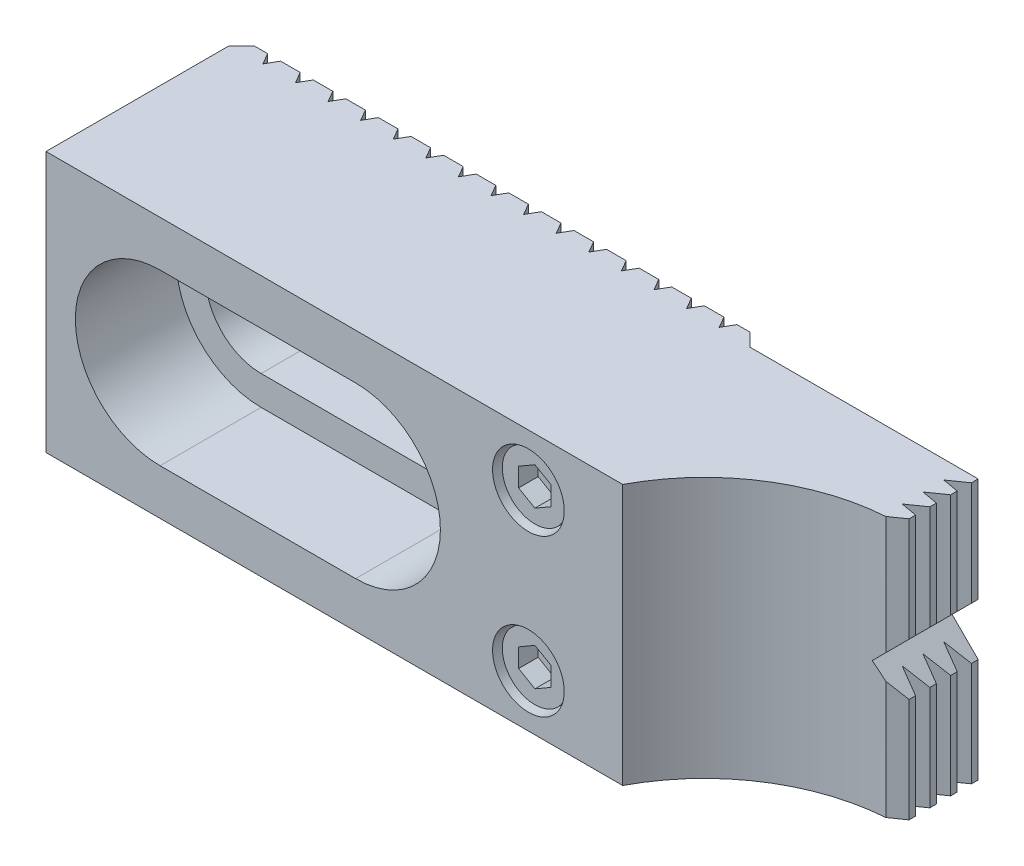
ISO-10303-21;
HEADER;
FILE_DESCRIPTION(('STEP AP214'),'2;1');
FILE_NAME('part.step','',(''),(''),'','','');
FILE_SCHEMA(('AUTOMOTIVE_DESIGN { 1 0 10303 214 1 1 1 1 }'));
ENDSEC;
DATA;
#1=APPLICATION_CONTEXT('core data for automotive mechanical design processes');
#2=APPLICATION_PROTOCOL_DEFINITION('international standard','automotive_design',2000,#1);
#3=PRODUCT_CONTEXT('',#1,'mechanical');
#4=PRODUCT('Part','Part','',(#3));
#5=PRODUCT_RELATED_PRODUCT_CATEGORY('part','',(#4));
#6=PRODUCT_DEFINITION_FORMATION('','',#4);
#7=PRODUCT_DEFINITION_CONTEXT('part definition',#1,'design');
#8=PRODUCT_DEFINITION('design','',#6,#7);
#9=PRODUCT_DEFINITION_SHAPE('','',#8);
#10=(LENGTH_UNIT() NAMED_UNIT(*) SI_UNIT(.MILLI.,.METRE.));
#11=(NAMED_UNIT(*) PLANE_ANGLE_UNIT() SI_UNIT($,.RADIAN.));
#12=(NAMED_UNIT(*) SI_UNIT($,.STERADIAN.) SOLID_ANGLE_UNIT());
#13=UNCERTAINTY_MEASURE_WITH_UNIT(LENGTH_MEASURE(1.E-05),#10,'distance_accuracy_value','');
#14=(GEOMETRIC_REPRESENTATION_CONTEXT(3) GLOBAL_UNCERTAINTY_ASSIGNED_CONTEXT((#13)) GLOBAL_UNIT_ASSIGNED_CONTEXT((#10,
#11,#12)) REPRESENTATION_CONTEXT('',''));
#15=CARTESIAN_POINT('',(0.,0.,0.));
#16=DIRECTION('',(0.,0.,1.));
#17=DIRECTION('',(1.,0.,0.));
#18=AXIS2_PLACEMENT_3D('',#15,#16,#17);
#19=CARTESIAN_POINT('',(-45.5,20.,0.));
#20=DIRECTION('',(0.,0.,-1.));
#21=DIRECTION('',(-1.,0.,0.));
#22=AXIS2_PLACEMENT_3D('',#19,#20,#21);
#23=PLANE('',#22);
#24=DIRECTION('',(0.,1.,0.));
#25=VECTOR('',#24,1.);
#26=CARTESIAN_POINT('',(26.5011840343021,-20.,0.));
#27=LINE('',#26,#25);
#28=CARTESIAN_POINT('',(26.5011840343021,14.9999997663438,0.));
#29=VERTEX_POINT('',#28);
#30=CARTESIAN_POINT('',(26.5011840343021,20.,0.));
#31=VERTEX_POINT('',#30);
#32=EDGE_CURVE('E1026',#29,#31,#27,.T.);
#33=ORIENTED_EDGE('',*,*,#32,.F.);
#34=CARTESIAN_POINT('',(26.5,12.,0.));
#35=DIRECTION('',(0.,0.,1.));
#36=DIRECTION('',(1.,0.,0.));
#37=AXIS2_PLACEMENT_3D('',#34,#35,#36);
#38=CIRCLE('',#37,3.);
#39=CARTESIAN_POINT('',(26.5011840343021,9.00000023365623,0.));
#40=VERTEX_POINT('',#39);
#41=EDGE_CURVE('E877',#29,#40,#38,.T.);
#42=ORIENTED_EDGE('',*,*,#41,.T.);
#43=CARTESIAN_POINT('',(26.5011840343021,-9.00000023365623,0.));
#44=VERTEX_POINT('',#43);
#45=EDGE_CURVE('E1032',#44,#40,#27,.T.);
#46=ORIENTED_EDGE('',*,*,#45,.F.);
#47=CARTESIAN_POINT('',(26.5,-12.,0.));
#48=DIRECTION('',(0.,0.,1.));
#49=DIRECTION('',(1.,0.,0.));
#50=AXIS2_PLACEMENT_3D('',#47,#48,#49);
#51=CIRCLE('',#50,3.);
#52=CARTESIAN_POINT('',(26.5011840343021,-14.9999997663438,0.));
#53=VERTEX_POINT('',#52);
#54=EDGE_CURVE('E885',#44,#53,#51,.T.);
#55=ORIENTED_EDGE('',*,*,#54,.T.);
#56=CARTESIAN_POINT('',(26.5011840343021,-20.,0.));
#57=VERTEX_POINT('',#56);
#58=EDGE_CURVE('E1028',#57,#53,#27,.T.);
#59=ORIENTED_EDGE('',*,*,#58,.F.);
#60=DIRECTION('',(1.,0.,0.));
#61=VECTOR('',#60,1.);
#62=CARTESIAN_POINT('',(-45.5,-20.,0.));
#63=LINE('',#62,#61);
#64=CARTESIAN_POINT('',(23.4988159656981,-20.,0.));
#65=VERTEX_POINT('',#64);
#66=EDGE_CURVE('E2108',#65,#57,#63,.T.);
#67=ORIENTED_EDGE('',*,*,#66,.F.);
#68=DIRECTION('',(0.,1.,0.));
#69=VECTOR('',#68,1.);
#70=CARTESIAN_POINT('',(23.4988159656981,-20.,0.));
#71=LINE('',#70,#69);
#72=CARTESIAN_POINT('',(23.4988159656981,20.,0.));
#73=VERTEX_POINT('',#72);
#74=EDGE_CURVE('E1044',#65,#73,#71,.T.);
#75=ORIENTED_EDGE('',*,*,#74,.T.);
#76=DIRECTION('',(1.,0.,0.));
#77=VECTOR('',#76,1.);
#78=CARTESIAN_POINT('',(-45.5,20.,0.));
#79=LINE('',#78,#77);
#80=EDGE_CURVE('E1958',#73,#31,#79,.T.);
#81=ORIENTED_EDGE('',*,*,#80,.T.);
#82=EDGE_LOOP('',(#33,#42,#46,#55,#59,#67,#75,#81));
#83=FACE_BOUND('',#82,.T.);
#84=ADVANCED_FACE('F15',(#83),#23,.T.);
#85=DIRECTION('',(0.,1.,0.));
#86=VECTOR('',#85,1.);
#87=CARTESIAN_POINT('',(28.4988159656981,-20.,0.));
#88=LINE('',#87,#86);
#89=CARTESIAN_POINT('',(28.4988159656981,-9.7628735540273,0.));
#90=VERTEX_POINT('',#89);
#91=CARTESIAN_POINT('',(28.4988159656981,9.7628735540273,0.));
#92=VERTEX_POINT('',#91);
#93=EDGE_CURVE('E1027',#90,#92,#88,.T.);
#94=ORIENTED_EDGE('',*,*,#93,.T.);
#95=CARTESIAN_POINT('',(28.4988159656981,14.2371264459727,0.));
#96=VERTEX_POINT('',#95);
#97=EDGE_CURVE('E874',#92,#96,#38,.T.);
#98=ORIENTED_EDGE('',*,*,#97,.T.);
#99=CARTESIAN_POINT('',(28.4988159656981,20.,0.));
#100=VERTEX_POINT('',#99);
#101=EDGE_CURVE('E1021',#96,#100,#88,.T.);
#102=ORIENTED_EDGE('',*,*,#101,.T.);
#103=CARTESIAN_POINT('',(30.5,20.,0.));
#104=VERTEX_POINT('',#103);
#105=EDGE_CURVE('E1353',#100,#104,#79,.T.);
#106=ORIENTED_EDGE('',*,*,#105,.T.);
#107=DIRECTION('',(0.,-1.,0.));
#108=VECTOR('',#107,1.);
#109=CARTESIAN_POINT('',(30.5,20.,0.));
#110=LINE('',#109,#108);
#111=CARTESIAN_POINT('',(30.5,-20.,0.));
#112=VERTEX_POINT('',#111);
#113=EDGE_CURVE('E1365',#104,#112,#110,.T.);
#114=ORIENTED_EDGE('',*,*,#113,.T.);
#115=CARTESIAN_POINT('',(28.4988159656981,-20.,0.));
#116=VERTEX_POINT('',#115);
#117=EDGE_CURVE('E1339',#116,#112,#63,.T.);
#118=ORIENTED_EDGE('',*,*,#117,.F.);
#119=CARTESIAN_POINT('',(28.4988159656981,-14.2371264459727,0.));
#120=VERTEX_POINT('',#119);
#121=EDGE_CURVE('E1023',#116,#120,#88,.T.);
#122=ORIENTED_EDGE('',*,*,#121,.T.);
#123=EDGE_CURVE('E882',#120,#90,#51,.T.);
#124=ORIENTED_EDGE('',*,*,#123,.T.);
#125=EDGE_LOOP('',(#94,#98,#102,#106,#114,#118,#122,#124));
#126=FACE_BOUND('',#125,.T.);
#127=ADVANCED_FACE('F1848',(#126),#23,.T.);
#128=CARTESIAN_POINT('',(27.5,-20.,1.73));
#129=DIRECTION('',(0.866025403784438,0.,-0.5));
#130=DIRECTION('',(-0.5,0.,-0.866025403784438));
#131=AXIS2_PLACEMENT_3D('',#128,#129,#130);
#132=PLANE('',#131);
#133=DIRECTION('',(0.,1.,0.));
#134=VECTOR('',#133,1.);
#135=CARTESIAN_POINT('',(27.5,-20.,1.73));
#136=LINE('',#135,#134);
#137=CARTESIAN_POINT('',(27.5,14.8284271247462,1.73));
#138=VERTEX_POINT('',#137);
#139=CARTESIAN_POINT('',(27.5,20.,1.73));
#140=VERTEX_POINT('',#139);
#141=EDGE_CURVE('E1016',#138,#140,#136,.T.);
#142=ORIENTED_EDGE('',*,*,#141,.F.);
#143=CARTESIAN_POINT('',(26.5,12.,-0.00205080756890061));
#144=DIRECTION('',(0.866025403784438,0.,-0.5));
#145=DIRECTION('',(0.5,0.,0.866025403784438));
#146=AXIS2_PLACEMENT_3D('',#143,#144,#145);
#147=ELLIPSE('',#146,6.,3.);
#148=EDGE_CURVE('E881',#138,#29,#147,.F.);
#149=ORIENTED_EDGE('',*,*,#148,.T.);
#150=ORIENTED_EDGE('',*,*,#32,.T.);
#151=DIRECTION('',(-0.5,0.,-0.866025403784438));
#152=VECTOR('',#151,1.);
#153=CARTESIAN_POINT('',(27.5,20.,1.73));
#154=LINE('',#153,#152);
#155=EDGE_CURVE('E1006',#140,#31,#154,.T.);
#156=ORIENTED_EDGE('',*,*,#155,.F.);
#157=EDGE_LOOP('',(#142,#149,#150,#156));
#158=FACE_BOUND('',#157,.T.);
#159=ADVANCED_FACE('F1856',(#158),#132,.T.);
#160=ORIENTED_EDGE('',*,*,#45,.T.);
#161=CARTESIAN_POINT('',(27.5,9.17157287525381,1.73));
#162=VERTEX_POINT('',#161);
#163=EDGE_CURVE('E878',#40,#162,#147,.F.);
#164=ORIENTED_EDGE('',*,*,#163,.T.);
#165=CARTESIAN_POINT('',(27.5,-9.17157287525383,1.73));
#166=VERTEX_POINT('',#165);
#167=EDGE_CURVE('E1022',#166,#162,#136,.T.);
#168=ORIENTED_EDGE('',*,*,#167,.F.);
#169=CARTESIAN_POINT('',(26.5,-12.,-0.00205080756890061));
#170=DIRECTION('',(0.866025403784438,0.,-0.5));
#171=DIRECTION('',(0.5,0.,0.866025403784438));
#172=AXIS2_PLACEMENT_3D('',#169,#170,#171);
#173=ELLIPSE('',#172,6.,3.);
#174=EDGE_CURVE('E889',#166,#44,#173,.F.);
#175=ORIENTED_EDGE('',*,*,#174,.T.);
#176=EDGE_LOOP('',(#160,#164,#168,#175));
#177=FACE_BOUND('',#176,.T.);
#178=ADVANCED_FACE('F2131',(#177),#132,.T.);
#179=CARTESIAN_POINT('',(27.5,-20.,1.73));
#180=DIRECTION('',(0.866025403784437,0.,0.5));
#181=DIRECTION('',(0.5,0.,-0.866025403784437));
#182=AXIS2_PLACEMENT_3D('',#179,#180,#181);
#183=PLANE('',#182);
#184=CARTESIAN_POINT('',(26.5,12.,3.4620508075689));
#185=DIRECTION('',(0.866025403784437,0.,0.5));
#186=DIRECTION('',(-0.5,0.,0.866025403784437));
#187=AXIS2_PLACEMENT_3D('',#184,#185,#186);
#188=ELLIPSE('',#187,6.,3.);
#189=EDGE_CURVE('E1385',#138,#96,#188,.F.);
#190=ORIENTED_EDGE('',*,*,#189,.F.);
#191=ORIENTED_EDGE('',*,*,#141,.T.);
#192=DIRECTION('',(0.5,0.,-0.866025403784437));
#193=VECTOR('',#192,1.);
#194=CARTESIAN_POINT('',(27.5,20.,1.73));
#195=LINE('',#194,#193);
#196=EDGE_CURVE('E1007',#140,#100,#195,.T.);
#197=ORIENTED_EDGE('',*,*,#196,.T.);
#198=ORIENTED_EDGE('',*,*,#101,.F.);
#199=EDGE_LOOP('',(#190,#191,#197,#198));
#200=FACE_BOUND('',#199,.T.);
#201=ADVANCED_FACE('F2142',(#200),#183,.F.);
#202=EDGE_CURVE('E1383',#92,#162,#188,.F.);
#203=ORIENTED_EDGE('',*,*,#202,.F.);
#204=ORIENTED_EDGE('',*,*,#93,.F.);
#205=CARTESIAN_POINT('',(26.5,-12.,3.4620508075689));
#206=DIRECTION('',(0.866025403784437,0.,0.5));
#207=DIRECTION('',(-0.5,0.,0.866025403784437));
#208=AXIS2_PLACEMENT_3D('',#205,#206,#207);
#209=ELLIPSE('',#208,6.,3.);
#210=EDGE_CURVE('E1382',#166,#90,#209,.F.);
#211=ORIENTED_EDGE('',*,*,#210,.F.);
#212=ORIENTED_EDGE('',*,*,#167,.T.);
#213=EDGE_LOOP('',(#203,#204,#211,#212));
#214=FACE_BOUND('',#213,.T.);
#215=ADVANCED_FACE('F2123',(#214),#183,.F.);
#216=ORIENTED_EDGE('',*,*,#58,.T.);
#217=CARTESIAN_POINT('',(27.5,-14.8284271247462,1.73));
#218=VERTEX_POINT('',#217);
#219=EDGE_CURVE('E886',#53,#218,#173,.F.);
#220=ORIENTED_EDGE('',*,*,#219,.T.);
#221=CARTESIAN_POINT('',(27.5,-20.,1.73));
#222=VERTEX_POINT('',#221);
#223=EDGE_CURVE('E1018',#222,#218,#136,.T.);
#224=ORIENTED_EDGE('',*,*,#223,.F.);
#225=DIRECTION('',(-0.5,0.,-0.866025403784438));
#226=VECTOR('',#225,1.);
#227=CARTESIAN_POINT('',(27.5,-20.,1.73));
#228=LINE('',#227,#226);
#229=EDGE_CURVE('E1010',#222,#57,#228,.T.);
#230=ORIENTED_EDGE('',*,*,#229,.T.);
#231=EDGE_LOOP('',(#216,#220,#224,#230));
#232=FACE_BOUND('',#231,.T.);
#233=ADVANCED_FACE('F2150',(#232),#132,.T.);
#234=EDGE_CURVE('E1380',#120,#218,#209,.F.);
#235=ORIENTED_EDGE('',*,*,#234,.F.);
#236=ORIENTED_EDGE('',*,*,#121,.F.);
#237=DIRECTION('',(0.5,0.,-0.866025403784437));
#238=VECTOR('',#237,1.);
#239=CARTESIAN_POINT('',(27.5,-20.,1.73));
#240=LINE('',#239,#238);
#241=EDGE_CURVE('E1013',#222,#116,#240,.T.);
#242=ORIENTED_EDGE('',*,*,#241,.F.);
#243=ORIENTED_EDGE('',*,*,#223,.T.);
#244=EDGE_LOOP('',(#235,#236,#242,#243));
#245=FACE_BOUND('',#244,.T.);
#246=ADVANCED_FACE('F2117',(#245),#183,.F.);
#247=CARTESIAN_POINT('',(0.,0.,0.));
#248=DIRECTION('',(0.,0.,1.));
#249=DIRECTION('',(1.,0.,0.));
#250=AXIS2_PLACEMENT_3D('',#247,#248,#249);
#251=CIRCLE('',#250,8.5);
#252=CARTESIAN_POINT('',(6.501184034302,5.4758201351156,0.));
#253=VERTEX_POINT('',#252);
#254=CARTESIAN_POINT('',(3.4988159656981,7.74650158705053,0.));
#255=VERTEX_POINT('',#254);
#256=EDGE_CURVE('E3456',#253,#255,#251,.T.);
#257=ORIENTED_EDGE('',*,*,#256,.T.);
#258=DIRECTION('',(0.,1.,0.));
#259=VECTOR('',#258,1.);
#260=CARTESIAN_POINT('',(3.4988159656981,-20.,0.));
#261=LINE('',#260,#259);
#262=CARTESIAN_POINT('',(3.4988159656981,20.,0.));
#263=VERTEX_POINT('',#262);
#264=EDGE_CURVE('E1121',#255,#263,#261,.T.);
#265=ORIENTED_EDGE('',*,*,#264,.T.);
#266=CARTESIAN_POINT('',(6.5011840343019,20.,0.));
#267=VERTEX_POINT('',#266);
#268=EDGE_CURVE('E1973',#263,#267,#79,.T.);
#269=ORIENTED_EDGE('',*,*,#268,.T.);
#270=DIRECTION('',(0.,1.,0.));
#271=VECTOR('',#270,1.);
#272=CARTESIAN_POINT('',(6.5011840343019,-20.,0.));
#273=LINE('',#272,#271);
#274=EDGE_CURVE('E1102',#253,#267,#273,.T.);
#275=ORIENTED_EDGE('',*,*,#274,.F.);
#276=EDGE_LOOP('',(#257,#265,#269,#275));
#277=FACE_BOUND('',#276,.T.);
#278=ADVANCED_FACE('F1858',(#277),#23,.T.);
#279=CARTESIAN_POINT('',(0.,-8.5,0.));
#280=VERTEX_POINT('',#279);
#281=CARTESIAN_POINT('',(1.501184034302,-8.36638790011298,0.));
#282=VERTEX_POINT('',#281);
#283=EDGE_CURVE('E901',#280,#282,#251,.T.);
#284=ORIENTED_EDGE('',*,*,#283,.T.);
#285=DIRECTION('',(0.,1.,0.));
#286=VECTOR('',#285,1.);
#287=CARTESIAN_POINT('',(1.5011840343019,-20.,0.));
#288=LINE('',#287,#286);
#289=CARTESIAN_POINT('',(1.5011840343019,-20.,0.));
#290=VERTEX_POINT('',#289);
#291=EDGE_CURVE('E1126',#290,#282,#288,.T.);
#292=ORIENTED_EDGE('',*,*,#291,.F.);
#293=CARTESIAN_POINT('',(-1.5011840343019,-20.,0.));
#294=VERTEX_POINT('',#293);
#295=EDGE_CURVE('E2088',#294,#290,#63,.T.);
#296=ORIENTED_EDGE('',*,*,#295,.F.);
#297=DIRECTION('',(0.,1.,0.));
#298=VECTOR('',#297,1.);
#299=CARTESIAN_POINT('',(-1.5011840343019,-20.,0.));
#300=LINE('',#299,#298);
#301=CARTESIAN_POINT('',(-1.5011840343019,-8.5,0.));
#302=VERTEX_POINT('',#301);
#303=EDGE_CURVE('E1145',#294,#302,#300,.T.);
#304=ORIENTED_EDGE('',*,*,#303,.T.);
#305=DIRECTION('',(-1.,0.,0.));
#306=VECTOR('',#305,1.);
#307=CARTESIAN_POINT('',(0.,-8.5,0.));
#308=LINE('',#307,#306);
#309=EDGE_CURVE('E848',#280,#302,#308,.T.);
#310=ORIENTED_EDGE('',*,*,#309,.F.);
#311=EDGE_LOOP('',(#284,#292,#296,#304,#310));
#312=FACE_BOUND('',#311,.T.);
#313=ADVANCED_FACE('F2159',(#312),#23,.T.);
#314=DIRECTION('',(0.,1.,0.));
#315=VECTOR('',#314,1.);
#316=CARTESIAN_POINT('',(-6.50118403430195,-20.,0.));
#317=LINE('',#316,#315);
#318=CARTESIAN_POINT('',(-6.50118403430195,-20.,0.));
#319=VERTEX_POINT('',#318);
#320=CARTESIAN_POINT('',(-6.50118403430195,-8.5,0.));
#321=VERTEX_POINT('',#320);
#322=EDGE_CURVE('E1168',#319,#321,#317,.T.);
#323=ORIENTED_EDGE('',*,*,#322,.T.);
#324=CARTESIAN_POINT('',(-3.49881596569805,-8.5,0.));
#325=VERTEX_POINT('',#324);
#326=EDGE_CURVE('E891',#325,#321,#308,.T.);
#327=ORIENTED_EDGE('',*,*,#326,.F.);
#328=DIRECTION('',(0.,1.,0.));
#329=VECTOR('',#328,1.);
#330=CARTESIAN_POINT('',(-3.49881596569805,-20.,0.));
#331=LINE('',#330,#329);
#332=CARTESIAN_POINT('',(-3.49881596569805,-20.,0.));
#333=VERTEX_POINT('',#332);
#334=EDGE_CURVE('E1149',#333,#325,#331,.T.);
#335=ORIENTED_EDGE('',*,*,#334,.F.);
#336=EDGE_CURVE('E2084',#319,#333,#63,.T.);
#337=ORIENTED_EDGE('',*,*,#336,.F.);
#338=EDGE_LOOP('',(#323,#327,#335,#337));
#339=FACE_BOUND('',#338,.T.);
#340=ADVANCED_FACE('F3421',(#339),#23,.T.);
#341=CARTESIAN_POINT('',(-3.49881596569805,8.5,0.));
#342=VERTEX_POINT('',#341);
#343=CARTESIAN_POINT('',(-3.49881596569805,20.,0.));
#344=VERTEX_POINT('',#343);
#345=EDGE_CURVE('E1148',#342,#344,#331,.T.);
#346=ORIENTED_EDGE('',*,*,#345,.F.);
#347=DIRECTION('',(1.,0.,0.));
#348=VECTOR('',#347,1.);
#349=CARTESIAN_POINT('',(-30.,8.5,0.));
#350=LINE('',#349,#348);
#351=CARTESIAN_POINT('',(-6.50118403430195,8.5,0.));
#352=VERTEX_POINT('',#351);
#353=EDGE_CURVE('E3475',#352,#342,#350,.T.);
#354=ORIENTED_EDGE('',*,*,#353,.F.);
#355=CARTESIAN_POINT('',(-6.50118403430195,20.,0.));
#356=VERTEX_POINT('',#355);
#357=EDGE_CURVE('E1167',#352,#356,#317,.T.);
#358=ORIENTED_EDGE('',*,*,#357,.T.);
#359=EDGE_CURVE('E1983',#356,#344,#79,.T.);
#360=ORIENTED_EDGE('',*,*,#359,.T.);
#361=EDGE_LOOP('',(#346,#354,#358,#360));
#362=FACE_BOUND('',#361,.T.);
#363=ADVANCED_FACE('F3412',(#362),#23,.T.);
#364=DIRECTION('',(0.,1.,0.));
#365=VECTOR('',#364,1.);
#366=CARTESIAN_POINT('',(-11.5011840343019,-20.,0.));
#367=LINE('',#366,#365);
#368=CARTESIAN_POINT('',(-11.5011840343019,-20.,0.));
#369=VERTEX_POINT('',#368);
#370=CARTESIAN_POINT('',(-11.5011840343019,-8.5,0.));
#371=VERTEX_POINT('',#370);
#372=EDGE_CURVE('E1191',#369,#371,#367,.T.);
#373=ORIENTED_EDGE('',*,*,#372,.T.);
#374=CARTESIAN_POINT('',(-8.49881596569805,-8.5,0.));
#375=VERTEX_POINT('',#374);
#376=EDGE_CURVE('E3521',#375,#371,#308,.T.);
#377=ORIENTED_EDGE('',*,*,#376,.F.);
#378=DIRECTION('',(0.,1.,0.));
#379=VECTOR('',#378,1.);
#380=CARTESIAN_POINT('',(-8.49881596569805,-20.,0.));
#381=LINE('',#380,#379);
#382=CARTESIAN_POINT('',(-8.49881596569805,-20.,0.));
#383=VERTEX_POINT('',#382);
#384=EDGE_CURVE('E1172',#383,#375,#381,.T.);
#385=ORIENTED_EDGE('',*,*,#384,.F.);
#386=EDGE_CURVE('E2080',#369,#383,#63,.T.);
#387=ORIENTED_EDGE('',*,*,#386,.F.);
#388=EDGE_LOOP('',(#373,#377,#385,#387));
#389=FACE_BOUND('',#388,.T.);
#390=ADVANCED_FACE('F3404',(#389),#23,.T.);
#391=CARTESIAN_POINT('',(-8.49881596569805,8.5,0.));
#392=VERTEX_POINT('',#391);
#393=CARTESIAN_POINT('',(-8.49881596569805,20.,0.));
#394=VERTEX_POINT('',#393);
#395=EDGE_CURVE('E1171',#392,#394,#381,.T.);
#396=ORIENTED_EDGE('',*,*,#395,.F.);
#397=CARTESIAN_POINT('',(-11.5011840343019,8.5,0.));
#398=VERTEX_POINT('',#397);
#399=EDGE_CURVE('E3477',#398,#392,#350,.T.);
#400=ORIENTED_EDGE('',*,*,#399,.F.);
#401=CARTESIAN_POINT('',(-11.5011840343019,20.,0.));
#402=VERTEX_POINT('',#401);
#403=EDGE_CURVE('E1190',#398,#402,#367,.T.);
#404=ORIENTED_EDGE('',*,*,#403,.T.);
#405=EDGE_CURVE('E1988',#402,#394,#79,.T.);
#406=ORIENTED_EDGE('',*,*,#405,.T.);
#407=EDGE_LOOP('',(#396,#400,#404,#406));
#408=FACE_BOUND('',#407,.T.);
#409=ADVANCED_FACE('F3395',(#408),#23,.T.);
#410=DIRECTION('',(0.,1.,0.));
#411=VECTOR('',#410,1.);
#412=CARTESIAN_POINT('',(-16.501184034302,-20.,0.));
#413=LINE('',#412,#411);
#414=CARTESIAN_POINT('',(-16.501184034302,-20.,0.));
#415=VERTEX_POINT('',#414);
#416=CARTESIAN_POINT('',(-16.501184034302,-8.5,0.));
#417=VERTEX_POINT('',#416);
#418=EDGE_CURVE('E1214',#415,#417,#413,.T.);
#419=ORIENTED_EDGE('',*,*,#418,.T.);
#420=CARTESIAN_POINT('',(-13.498815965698,-8.5,0.));
#421=VERTEX_POINT('',#420);
#422=EDGE_CURVE('E3518',#421,#417,#308,.T.);
#423=ORIENTED_EDGE('',*,*,#422,.F.);
#424=DIRECTION('',(0.,1.,0.));
#425=VECTOR('',#424,1.);
#426=CARTESIAN_POINT('',(-13.498815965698,-20.,0.));
#427=LINE('',#426,#425);
#428=CARTESIAN_POINT('',(-13.498815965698,-20.,0.));
#429=VERTEX_POINT('',#428);
#430=EDGE_CURVE('E1195',#429,#421,#427,.T.);
#431=ORIENTED_EDGE('',*,*,#430,.F.);
#432=EDGE_CURVE('E2076',#415,#429,#63,.T.);
#433=ORIENTED_EDGE('',*,*,#432,.F.);
#434=EDGE_LOOP('',(#419,#423,#431,#433));
#435=FACE_BOUND('',#434,.T.);
#436=ADVANCED_FACE('F3387',(#435),#23,.T.);
#437=CARTESIAN_POINT('',(-13.498815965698,8.5,0.));
#438=VERTEX_POINT('',#437);
#439=CARTESIAN_POINT('',(-13.498815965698,20.,0.));
#440=VERTEX_POINT('',#439);
#441=EDGE_CURVE('E1194',#438,#440,#427,.T.);
#442=ORIENTED_EDGE('',*,*,#441,.F.);
#443=CARTESIAN_POINT('',(-16.501184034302,8.5,0.));
#444=VERTEX_POINT('',#443);
#445=EDGE_CURVE('E3485',#444,#438,#350,.T.);
#446=ORIENTED_EDGE('',*,*,#445,.F.);
#447=CARTESIAN_POINT('',(-16.501184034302,20.,0.));
#448=VERTEX_POINT('',#447);
#449=EDGE_CURVE('E1213',#444,#448,#413,.T.);
#450=ORIENTED_EDGE('',*,*,#449,.T.);
#451=EDGE_CURVE('E1993',#448,#440,#79,.T.);
#452=ORIENTED_EDGE('',*,*,#451,.T.);
#453=EDGE_LOOP('',(#442,#446,#450,#452));
#454=FACE_BOUND('',#453,.T.);
#455=ADVANCED_FACE('F3378',(#454),#23,.T.);
#456=DIRECTION('',(0.,1.,0.));
#457=VECTOR('',#456,1.);
#458=CARTESIAN_POINT('',(-21.501184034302,-20.,0.));
#459=LINE('',#458,#457);
#460=CARTESIAN_POINT('',(-21.501184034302,-20.,0.));
#461=VERTEX_POINT('',#460);
#462=CARTESIAN_POINT('',(-21.501184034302,-8.5,0.));
#463=VERTEX_POINT('',#462);
#464=EDGE_CURVE('E1237',#461,#463,#459,.T.);
#465=ORIENTED_EDGE('',*,*,#464,.T.);
#466=CARTESIAN_POINT('',(-18.498815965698,-8.5,0.));
#467=VERTEX_POINT('',#466);
#468=EDGE_CURVE('E3515',#467,#463,#308,.T.);
#469=ORIENTED_EDGE('',*,*,#468,.F.);
#470=DIRECTION('',(0.,1.,0.));
#471=VECTOR('',#470,1.);
#472=CARTESIAN_POINT('',(-18.498815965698,-20.,0.));
#473=LINE('',#472,#471);
#474=CARTESIAN_POINT('',(-18.498815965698,-20.,0.));
#475=VERTEX_POINT('',#474);
#476=EDGE_CURVE('E1218',#475,#467,#473,.T.);
#477=ORIENTED_EDGE('',*,*,#476,.F.);
#478=EDGE_CURVE('E2072',#461,#475,#63,.T.);
#479=ORIENTED_EDGE('',*,*,#478,.F.);
#480=EDGE_LOOP('',(#465,#469,#477,#479));
#481=FACE_BOUND('',#480,.T.);
#482=ADVANCED_FACE('F3370',(#481),#23,.T.);
#483=CARTESIAN_POINT('',(-18.498815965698,8.5,0.));
#484=VERTEX_POINT('',#483);
#485=CARTESIAN_POINT('',(-18.498815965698,20.,0.));
#486=VERTEX_POINT('',#485);
#487=EDGE_CURVE('E1217',#484,#486,#473,.T.);
#488=ORIENTED_EDGE('',*,*,#487,.F.);
#489=CARTESIAN_POINT('',(-21.501184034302,8.5,0.));
#490=VERTEX_POINT('',#489);
#491=EDGE_CURVE('E3492',#490,#484,#350,.T.);
#492=ORIENTED_EDGE('',*,*,#491,.F.);
#493=CARTESIAN_POINT('',(-21.501184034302,20.,0.));
#494=VERTEX_POINT('',#493);
#495=EDGE_CURVE('E1236',#490,#494,#459,.T.);
#496=ORIENTED_EDGE('',*,*,#495,.T.);
#497=EDGE_CURVE('E1998',#494,#486,#79,.T.);
#498=ORIENTED_EDGE('',*,*,#497,.T.);
#499=EDGE_LOOP('',(#488,#492,#496,#498));
#500=FACE_BOUND('',#499,.T.);
#501=ADVANCED_FACE('F3361',(#500),#23,.T.);
#502=DIRECTION('',(0.,1.,0.));
#503=VECTOR('',#502,1.);
#504=CARTESIAN_POINT('',(-26.501184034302,-20.,0.));
#505=LINE('',#504,#503);
#506=CARTESIAN_POINT('',(-26.501184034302,-20.,0.));
#507=VERTEX_POINT('',#506);
#508=CARTESIAN_POINT('',(-26.501184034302,-8.5,0.));
#509=VERTEX_POINT('',#508);
#510=EDGE_CURVE('E1260',#507,#509,#505,.T.);
#511=ORIENTED_EDGE('',*,*,#510,.T.);
#512=CARTESIAN_POINT('',(-23.4988159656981,-8.5,0.));
#513=VERTEX_POINT('',#512);
#514=EDGE_CURVE('E3514',#513,#509,#308,.T.);
#515=ORIENTED_EDGE('',*,*,#514,.F.);
#516=DIRECTION('',(0.,1.,0.));
#517=VECTOR('',#516,1.);
#518=CARTESIAN_POINT('',(-23.4988159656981,-20.,0.));
#519=LINE('',#518,#517);
#520=CARTESIAN_POINT('',(-23.4988159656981,-20.,0.));
#521=VERTEX_POINT('',#520);
#522=EDGE_CURVE('E1241',#521,#513,#519,.T.);
#523=ORIENTED_EDGE('',*,*,#522,.F.);
#524=EDGE_CURVE('E2069',#507,#521,#63,.T.);
#525=ORIENTED_EDGE('',*,*,#524,.F.);
#526=EDGE_LOOP('',(#511,#515,#523,#525));
#527=FACE_BOUND('',#526,.T.);
#528=ADVANCED_FACE('F3353',(#527),#23,.T.);
#529=CARTESIAN_POINT('',(-23.4988159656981,8.5,0.));
#530=VERTEX_POINT('',#529);
#531=CARTESIAN_POINT('',(-23.4988159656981,20.,0.));
#532=VERTEX_POINT('',#531);
#533=EDGE_CURVE('E1240',#530,#532,#519,.T.);
#534=ORIENTED_EDGE('',*,*,#533,.F.);
#535=CARTESIAN_POINT('',(-26.501184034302,8.5,0.));
#536=VERTEX_POINT('',#535);
#537=EDGE_CURVE('E900',#536,#530,#350,.T.);
#538=ORIENTED_EDGE('',*,*,#537,.F.);
#539=CARTESIAN_POINT('',(-26.501184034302,20.,0.));
#540=VERTEX_POINT('',#539);
#541=EDGE_CURVE('E1259',#536,#540,#505,.T.);
#542=ORIENTED_EDGE('',*,*,#541,.T.);
#543=EDGE_CURVE('E2003',#540,#532,#79,.T.);
#544=ORIENTED_EDGE('',*,*,#543,.T.);
#545=EDGE_LOOP('',(#534,#538,#542,#544));
#546=FACE_BOUND('',#545,.T.);
#547=ADVANCED_FACE('F3345',(#546),#23,.T.);
#548=CARTESIAN_POINT('',(-30.,0.,0.));
#549=DIRECTION('',(0.,0.,1.));
#550=DIRECTION('',(1.,0.,0.));
#551=AXIS2_PLACEMENT_3D('',#548,#549,#550);
#552=CIRCLE('',#551,8.5);
#553=CARTESIAN_POINT('',(-31.5011840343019,-8.36638790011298,0.));
#554=VERTEX_POINT('',#553);
#555=CARTESIAN_POINT('',(-30.,-8.5,0.));
#556=VERTEX_POINT('',#555);
#557=EDGE_CURVE('E897',#554,#556,#552,.T.);
#558=ORIENTED_EDGE('',*,*,#557,.T.);
#559=CARTESIAN_POINT('',(-28.498815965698,-8.5,0.));
#560=VERTEX_POINT('',#559);
#561=EDGE_CURVE('E892',#560,#556,#308,.T.);
#562=ORIENTED_EDGE('',*,*,#561,.F.);
#563=DIRECTION('',(0.,1.,0.));
#564=VECTOR('',#563,1.);
#565=CARTESIAN_POINT('',(-28.498815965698,-20.,0.));
#566=LINE('',#565,#564);
#567=CARTESIAN_POINT('',(-28.498815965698,-20.,0.));
#568=VERTEX_POINT('',#567);
#569=EDGE_CURVE('E1264',#568,#560,#566,.T.);
#570=ORIENTED_EDGE('',*,*,#569,.F.);
#571=CARTESIAN_POINT('',(-31.5011840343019,-20.,0.));
#572=VERTEX_POINT('',#571);
#573=EDGE_CURVE('E2067',#572,#568,#63,.T.);
#574=ORIENTED_EDGE('',*,*,#573,.F.);
#575=DIRECTION('',(0.,1.,0.));
#576=VECTOR('',#575,1.);
#577=CARTESIAN_POINT('',(-31.5011840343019,-20.,0.));
#578=LINE('',#577,#576);
#579=EDGE_CURVE('E1283',#572,#554,#578,.T.);
#580=ORIENTED_EDGE('',*,*,#579,.T.);
#581=EDGE_LOOP('',(#558,#562,#570,#574,#580));
#582=FACE_BOUND('',#581,.T.);
#583=ADVANCED_FACE('F2047',(#582),#23,.T.);
#584=CARTESIAN_POINT('',(-33.4988159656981,7.74650158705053,0.));
#585=VERTEX_POINT('',#584);
#586=CARTESIAN_POINT('',(-36.5011840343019,5.47582013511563,0.));
#587=VERTEX_POINT('',#586);
#588=EDGE_CURVE('E896',#585,#587,#552,.T.);
#589=ORIENTED_EDGE('',*,*,#588,.T.);
#590=DIRECTION('',(0.,1.,0.));
#591=VECTOR('',#590,1.);
#592=CARTESIAN_POINT('',(-36.5011840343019,-20.,0.));
#593=LINE('',#592,#591);
#594=CARTESIAN_POINT('',(-36.5011840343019,20.,0.));
#595=VERTEX_POINT('',#594);
#596=EDGE_CURVE('E1305',#587,#595,#593,.T.);
#597=ORIENTED_EDGE('',*,*,#596,.T.);
#598=CARTESIAN_POINT('',(-33.4988159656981,20.,0.));
#599=VERTEX_POINT('',#598);
#600=EDGE_CURVE('E2013',#595,#599,#79,.T.);
#601=ORIENTED_EDGE('',*,*,#600,.T.);
#602=DIRECTION('',(0.,1.,0.));
#603=VECTOR('',#602,1.);
#604=CARTESIAN_POINT('',(-33.4988159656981,-20.,0.));
#605=LINE('',#604,#603);
#606=EDGE_CURVE('E1286',#585,#599,#605,.T.);
#607=ORIENTED_EDGE('',*,*,#606,.F.);
#608=EDGE_LOOP('',(#589,#597,#601,#607));
#609=FACE_BOUND('',#608,.T.);
#610=ADVANCED_FACE('F2037',(#609),#23,.T.);
#611=CARTESIAN_POINT('',(-37.5,-20.,1.73));
#612=DIRECTION('',(0.866025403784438,0.,-0.5));
#613=DIRECTION('',(-0.5,0.,-0.866025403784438));
#614=AXIS2_PLACEMENT_3D('',#611,#612,#613);
#615=PLANE('',#614);
#616=CARTESIAN_POINT('',(-30.,0.,14.7203810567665));
#617=DIRECTION('',(0.866025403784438,0.,-0.5));
#618=DIRECTION('',(0.5,0.,0.866025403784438));
#619=AXIS2_PLACEMENT_3D('',#616,#617,#618);
#620=ELLIPSE('',#619,17.,8.5);
#621=CARTESIAN_POINT('',(-37.5,-4.,1.73));
#622=VERTEX_POINT('',#621);
#623=CARTESIAN_POINT('',(-38.4988159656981,-0.141870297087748,0.));
#624=VERTEX_POINT('',#623);
#625=EDGE_CURVE('E985',#622,#624,#620,.T.);
#626=ORIENTED_EDGE('',*,*,#625,.F.);
#627=DIRECTION('',(0.,1.,0.));
#628=VECTOR('',#627,1.);
#629=CARTESIAN_POINT('',(-37.5,-20.,1.73));
#630=LINE('',#629,#628);
#631=CARTESIAN_POINT('',(-37.5,-20.,1.73));
#632=VERTEX_POINT('',#631);
#633=EDGE_CURVE('E1302',#632,#622,#630,.T.);
#634=ORIENTED_EDGE('',*,*,#633,.F.);
#635=DIRECTION('',(-0.5,0.,-0.866025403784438));
#636=VECTOR('',#635,1.);
#637=CARTESIAN_POINT('',(-37.5,-20.,1.73));
#638=LINE('',#637,#636);
#639=CARTESIAN_POINT('',(-38.498815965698,-20.,0.));
#640=VERTEX_POINT('',#639);
#641=EDGE_CURVE('E1294',#632,#640,#638,.T.);
#642=ORIENTED_EDGE('',*,*,#641,.T.);
#643=DIRECTION('',(0.,1.,0.));
#644=VECTOR('',#643,1.);
#645=CARTESIAN_POINT('',(-38.498815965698,-20.,0.));
#646=LINE('',#645,#644);
#647=EDGE_CURVE('E1310',#640,#624,#646,.T.);
#648=ORIENTED_EDGE('',*,*,#647,.T.);
#649=EDGE_LOOP('',(#626,#634,#642,#648));
#650=FACE_BOUND('',#649,.T.);
#651=ADVANCED_FACE('F2921',(#650),#615,.T.);
#652=CARTESIAN_POINT('',(-37.5,-20.,1.73));
#653=DIRECTION('',(0.866025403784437,0.,0.5));
#654=DIRECTION('',(0.5,0.,-0.866025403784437));
#655=AXIS2_PLACEMENT_3D('',#652,#653,#654);
#656=PLANE('',#655);
#657=ORIENTED_EDGE('',*,*,#633,.T.);
#658=CARTESIAN_POINT('',(-30.,0.,-11.2603810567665));
#659=DIRECTION('',(0.866025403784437,0.,0.5));
#660=DIRECTION('',(-0.5,0.,0.866025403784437));
#661=AXIS2_PLACEMENT_3D('',#658,#659,#660);
#662=ELLIPSE('',#661,17.,8.5);
#663=CARTESIAN_POINT('',(-36.5011840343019,-5.47582013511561,0.));
#664=VERTEX_POINT('',#663);
#665=EDGE_CURVE('E983',#622,#664,#662,.T.);
#666=ORIENTED_EDGE('',*,*,#665,.T.);
#667=CARTESIAN_POINT('',(-36.5011840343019,-20.,0.));
#668=VERTEX_POINT('',#667);
#669=EDGE_CURVE('E1306',#668,#664,#593,.T.);
#670=ORIENTED_EDGE('',*,*,#669,.F.);
#671=DIRECTION('',(0.5,0.,-0.866025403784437));
#672=VECTOR('',#671,1.);
#673=CARTESIAN_POINT('',(-37.5,-20.,1.73));
#674=LINE('',#673,#672);
#675=EDGE_CURVE('E1297',#632,#668,#674,.T.);
#676=ORIENTED_EDGE('',*,*,#675,.F.);
#677=EDGE_LOOP('',(#657,#666,#670,#676));
#678=FACE_BOUND('',#677,.T.);
#679=ADVANCED_FACE('F2062',(#678),#656,.F.);
#680=CARTESIAN_POINT('',(-32.5,-20.,1.73));
#681=DIRECTION('',(0.866025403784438,0.,-0.5));
#682=DIRECTION('',(-0.5,0.,-0.866025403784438));
#683=AXIS2_PLACEMENT_3D('',#680,#681,#682);
#684=PLANE('',#683);
#685=CARTESIAN_POINT('',(-30.,0.,6.0601270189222));
#686=DIRECTION('',(0.866025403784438,0.,-0.5));
#687=DIRECTION('',(0.5,0.,0.866025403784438));
#688=AXIS2_PLACEMENT_3D('',#685,#686,#687);
#689=ELLIPSE('',#688,17.,8.5);
#690=CARTESIAN_POINT('',(-32.5,-8.12403840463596,1.73));
#691=VERTEX_POINT('',#690);
#692=CARTESIAN_POINT('',(-33.4988159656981,-7.74650158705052,0.));
#693=VERTEX_POINT('',#692);
#694=EDGE_CURVE('E978',#691,#693,#689,.T.);
#695=ORIENTED_EDGE('',*,*,#694,.F.);
#696=DIRECTION('',(0.,1.,0.));
#697=VECTOR('',#696,1.);
#698=CARTESIAN_POINT('',(-32.5,-20.,1.73));
#699=LINE('',#698,#697);
#700=CARTESIAN_POINT('',(-32.5,-20.,1.73));
#701=VERTEX_POINT('',#700);
#702=EDGE_CURVE('E1279',#701,#691,#699,.T.);
#703=ORIENTED_EDGE('',*,*,#702,.F.);
#704=DIRECTION('',(-0.5,0.,-0.866025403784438));
#705=VECTOR('',#704,1.);
#706=CARTESIAN_POINT('',(-32.5,-20.,1.73));
#707=LINE('',#706,#705);
#708=CARTESIAN_POINT('',(-33.4988159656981,-20.,0.));
#709=VERTEX_POINT('',#708);
#710=EDGE_CURVE('E1271',#701,#709,#707,.T.);
#711=ORIENTED_EDGE('',*,*,#710,.T.);
#712=EDGE_CURVE('E1287',#709,#693,#605,.T.);
#713=ORIENTED_EDGE('',*,*,#712,.T.);
#714=EDGE_LOOP('',(#695,#703,#711,#713));
#715=FACE_BOUND('',#714,.T.);
#716=ADVANCED_FACE('F2058',(#715),#684,.T.);
#717=CARTESIAN_POINT('',(-32.5,-20.,1.73));
#718=DIRECTION('',(0.866025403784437,0.,0.5));
#719=DIRECTION('',(0.5,0.,-0.866025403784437));
#720=AXIS2_PLACEMENT_3D('',#717,#718,#719);
#721=PLANE('',#720);
#722=ORIENTED_EDGE('',*,*,#702,.T.);
#723=CARTESIAN_POINT('',(-30.,0.,-2.60012701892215));
#724=DIRECTION('',(0.866025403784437,0.,0.5));
#725=DIRECTION('',(-0.5,0.,0.866025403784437));
#726=AXIS2_PLACEMENT_3D('',#723,#724,#725);
#727=ELLIPSE('',#726,17.,8.5);
#728=EDGE_CURVE('E1379',#691,#554,#727,.T.);
#729=ORIENTED_EDGE('',*,*,#728,.T.);
#730=ORIENTED_EDGE('',*,*,#579,.F.);
#731=DIRECTION('',(0.5,0.,-0.866025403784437));
#732=VECTOR('',#731,1.);
#733=CARTESIAN_POINT('',(-32.5,-20.,1.73));
#734=LINE('',#733,#732);
#735=EDGE_CURVE('E1274',#701,#572,#734,.T.);
#736=ORIENTED_EDGE('',*,*,#735,.F.);
#737=EDGE_LOOP('',(#722,#729,#730,#736));
#738=FACE_BOUND('',#737,.T.);
#739=ADVANCED_FACE('F2054',(#738),#721,.F.);
#740=CARTESIAN_POINT('',(-27.5,-20.,1.73));
#741=DIRECTION('',(0.866025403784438,0.,-0.5));
#742=DIRECTION('',(-0.5,0.,-0.866025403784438));
#743=AXIS2_PLACEMENT_3D('',#740,#741,#742);
#744=PLANE('',#743);
#745=ORIENTED_EDGE('',*,*,#569,.T.);
#746=DIRECTION('',(0.5,0.,0.866025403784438));
#747=VECTOR('',#746,1.);
#748=CARTESIAN_POINT('',(-27.5,-8.5,1.73));
#749=LINE('',#748,#747);
#750=CARTESIAN_POINT('',(-27.5,-8.5,1.73));
#751=VERTEX_POINT('',#750);
#752=EDGE_CURVE('E973',#560,#751,#749,.T.);
#753=ORIENTED_EDGE('',*,*,#752,.T.);
#754=DIRECTION('',(0.,1.,0.));
#755=VECTOR('',#754,1.);
#756=CARTESIAN_POINT('',(-27.5,-20.,1.73));
#757=LINE('',#756,#755);
#758=CARTESIAN_POINT('',(-27.5,-20.,1.73));
#759=VERTEX_POINT('',#758);
#760=EDGE_CURVE('E1256',#759,#751,#757,.T.);
#761=ORIENTED_EDGE('',*,*,#760,.F.);
#762=DIRECTION('',(-0.5,0.,-0.866025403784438));
#763=VECTOR('',#762,1.);
#764=CARTESIAN_POINT('',(-27.5,-20.,1.73));
#765=LINE('',#764,#763);
#766=EDGE_CURVE('E1248',#759,#568,#765,.T.);
#767=ORIENTED_EDGE('',*,*,#766,.T.);
#768=EDGE_LOOP('',(#745,#753,#761,#767));
#769=FACE_BOUND('',#768,.T.);
#770=ADVANCED_FACE('F3291',(#769),#744,.T.);
#771=CARTESIAN_POINT('',(-27.5,8.5,1.73));
#772=VERTEX_POINT('',#771);
#773=CARTESIAN_POINT('',(-27.5,20.,1.73));
#774=VERTEX_POINT('',#773);
#775=EDGE_CURVE('E1254',#772,#774,#757,.T.);
#776=ORIENTED_EDGE('',*,*,#775,.F.);
#777=DIRECTION('',(-0.5,0.,-0.866025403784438));
#778=VECTOR('',#777,1.);
#779=CARTESIAN_POINT('',(-27.5,8.5,1.73));
#780=LINE('',#779,#778);
#781=CARTESIAN_POINT('',(-28.498815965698,8.5,0.));
#782=VERTEX_POINT('',#781);
#783=EDGE_CURVE('E945',#772,#782,#780,.T.);
#784=ORIENTED_EDGE('',*,*,#783,.T.);
#785=CARTESIAN_POINT('',(-28.498815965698,20.,0.));
#786=VERTEX_POINT('',#785);
#787=EDGE_CURVE('E1263',#782,#786,#566,.T.);
#788=ORIENTED_EDGE('',*,*,#787,.T.);
#789=DIRECTION('',(-0.5,0.,-0.866025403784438));
#790=VECTOR('',#789,1.);
#791=CARTESIAN_POINT('',(-27.5,20.,1.73));
#792=LINE('',#791,#790);
#793=EDGE_CURVE('E1244',#774,#786,#792,.T.);
#794=ORIENTED_EDGE('',*,*,#793,.F.);
#795=EDGE_LOOP('',(#776,#784,#788,#794));
#796=FACE_BOUND('',#795,.T.);
#797=ADVANCED_FACE('F3282',(#796),#744,.T.);
#798=CARTESIAN_POINT('',(-27.5,-20.,1.73));
#799=DIRECTION('',(0.866025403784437,0.,0.5));
#800=DIRECTION('',(0.5,0.,-0.866025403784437));
#801=AXIS2_PLACEMENT_3D('',#798,#799,#800);
#802=PLANE('',#801);
#803=DIRECTION('',(-0.5,0.,0.866025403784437));
#804=VECTOR('',#803,1.);
#805=CARTESIAN_POINT('',(-27.5,-8.5,1.73));
#806=LINE('',#805,#804);
#807=EDGE_CURVE('E971',#509,#751,#806,.T.);
#808=ORIENTED_EDGE('',*,*,#807,.F.);
#809=ORIENTED_EDGE('',*,*,#510,.F.);
#810=DIRECTION('',(0.5,0.,-0.866025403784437));
#811=VECTOR('',#810,1.);
#812=CARTESIAN_POINT('',(-27.5,-20.,1.73));
#813=LINE('',#812,#811);
#814=EDGE_CURVE('E1251',#759,#507,#813,.T.);
#815=ORIENTED_EDGE('',*,*,#814,.F.);
#816=ORIENTED_EDGE('',*,*,#760,.T.);
#817=EDGE_LOOP('',(#808,#809,#815,#816));
#818=FACE_BOUND('',#817,.T.);
#819=ADVANCED_FACE('F3272',(#818),#802,.F.);
#820=DIRECTION('',(0.5,0.,-0.866025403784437));
#821=VECTOR('',#820,1.);
#822=CARTESIAN_POINT('',(-27.5,8.5,1.73));
#823=LINE('',#822,#821);
#824=EDGE_CURVE('E943',#772,#536,#823,.T.);
#825=ORIENTED_EDGE('',*,*,#824,.F.);
#826=ORIENTED_EDGE('',*,*,#775,.T.);
#827=DIRECTION('',(0.5,0.,-0.866025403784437));
#828=VECTOR('',#827,1.);
#829=CARTESIAN_POINT('',(-27.5,20.,1.73));
#830=LINE('',#829,#828);
#831=EDGE_CURVE('E1245',#774,#540,#830,.T.);
#832=ORIENTED_EDGE('',*,*,#831,.T.);
#833=ORIENTED_EDGE('',*,*,#541,.F.);
#834=EDGE_LOOP('',(#825,#826,#832,#833));
#835=FACE_BOUND('',#834,.T.);
#836=ADVANCED_FACE('F3263',(#835),#802,.F.);
#837=CARTESIAN_POINT('',(-22.5,-20.,1.73));
#838=DIRECTION('',(0.866025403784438,0.,-0.5));
#839=DIRECTION('',(-0.5,0.,-0.866025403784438));
#840=AXIS2_PLACEMENT_3D('',#837,#838,#839);
#841=PLANE('',#840);
#842=ORIENTED_EDGE('',*,*,#522,.T.);
#843=DIRECTION('',(0.5,0.,0.866025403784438));
#844=VECTOR('',#843,1.);
#845=CARTESIAN_POINT('',(-22.5,-8.5,1.73));
#846=LINE('',#845,#844);
#847=CARTESIAN_POINT('',(-22.5,-8.5,1.73));
#848=VERTEX_POINT('',#847);
#849=EDGE_CURVE('E968',#513,#848,#846,.T.);
#850=ORIENTED_EDGE('',*,*,#849,.T.);
#851=DIRECTION('',(0.,1.,0.));
#852=VECTOR('',#851,1.);
#853=CARTESIAN_POINT('',(-22.5,-20.,1.73));
#854=LINE('',#853,#852);
#855=CARTESIAN_POINT('',(-22.5,-20.,1.73));
#856=VERTEX_POINT('',#855);
#857=EDGE_CURVE('E1233',#856,#848,#854,.T.);
#858=ORIENTED_EDGE('',*,*,#857,.F.);
#859=DIRECTION('',(-0.5,0.,-0.866025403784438));
#860=VECTOR('',#859,1.);
#861=CARTESIAN_POINT('',(-22.5,-20.,1.73));
#862=LINE('',#861,#860);
#863=EDGE_CURVE('E1225',#856,#521,#862,.T.);
#864=ORIENTED_EDGE('',*,*,#863,.T.);
#865=EDGE_LOOP('',(#842,#850,#858,#864));
#866=FACE_BOUND('',#865,.T.);
#867=ADVANCED_FACE('F3253',(#866),#841,.T.);
#868=CARTESIAN_POINT('',(-22.5,8.5,1.73));
#869=VERTEX_POINT('',#868);
#870=CARTESIAN_POINT('',(-22.5,20.,1.73));
#871=VERTEX_POINT('',#870);
#872=EDGE_CURVE('E1231',#869,#871,#854,.T.);
#873=ORIENTED_EDGE('',*,*,#872,.F.);
#874=DIRECTION('',(-0.5,0.,-0.866025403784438));
#875=VECTOR('',#874,1.);
#876=CARTESIAN_POINT('',(-22.5,8.5,1.73));
#877=LINE('',#876,#875);
#878=EDGE_CURVE('E940',#869,#530,#877,.T.);
#879=ORIENTED_EDGE('',*,*,#878,.T.);
#880=ORIENTED_EDGE('',*,*,#533,.T.);
#881=DIRECTION('',(-0.5,0.,-0.866025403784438));
#882=VECTOR('',#881,1.);
#883=CARTESIAN_POINT('',(-22.5,20.,1.73));
#884=LINE('',#883,#882);
#885=EDGE_CURVE('E1221',#871,#532,#884,.T.);
#886=ORIENTED_EDGE('',*,*,#885,.F.);
#887=EDGE_LOOP('',(#873,#879,#880,#886));
#888=FACE_BOUND('',#887,.T.);
#889=ADVANCED_FACE('F3244',(#888),#841,.T.);
#890=CARTESIAN_POINT('',(-22.5,-20.,1.73));
#891=DIRECTION('',(0.866025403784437,0.,0.5));
#892=DIRECTION('',(0.5,0.,-0.866025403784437));
#893=AXIS2_PLACEMENT_3D('',#890,#891,#892);
#894=PLANE('',#893);
#895=DIRECTION('',(-0.5,0.,0.866025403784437));
#896=VECTOR('',#895,1.);
#897=CARTESIAN_POINT('',(-22.5,-8.5,1.73));
#898=LINE('',#897,#896);
#899=EDGE_CURVE('E966',#463,#848,#898,.T.);
#900=ORIENTED_EDGE('',*,*,#899,.F.);
#901=ORIENTED_EDGE('',*,*,#464,.F.);
#902=DIRECTION('',(0.5,0.,-0.866025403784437));
#903=VECTOR('',#902,1.);
#904=CARTESIAN_POINT('',(-22.5,-20.,1.73));
#905=LINE('',#904,#903);
#906=EDGE_CURVE('E1228',#856,#461,#905,.T.);
#907=ORIENTED_EDGE('',*,*,#906,.F.);
#908=ORIENTED_EDGE('',*,*,#857,.T.);
#909=EDGE_LOOP('',(#900,#901,#907,#908));
#910=FACE_BOUND('',#909,.T.);
#911=ADVANCED_FACE('F3234',(#910),#894,.F.);
#912=DIRECTION('',(0.5,0.,-0.866025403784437));
#913=VECTOR('',#912,1.);
#914=CARTESIAN_POINT('',(-22.5,8.5,1.73));
#915=LINE('',#914,#913);
#916=EDGE_CURVE('E938',#869,#490,#915,.T.);
#917=ORIENTED_EDGE('',*,*,#916,.F.);
#918=ORIENTED_EDGE('',*,*,#872,.T.);
#919=DIRECTION('',(0.5,0.,-0.866025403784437));
#920=VECTOR('',#919,1.);
#921=CARTESIAN_POINT('',(-22.5,20.,1.73));
#922=LINE('',#921,#920);
#923=EDGE_CURVE('E1222',#871,#494,#922,.T.);
#924=ORIENTED_EDGE('',*,*,#923,.T.);
#925=ORIENTED_EDGE('',*,*,#495,.F.);
#926=EDGE_LOOP('',(#917,#918,#924,#925));
#927=FACE_BOUND('',#926,.T.);
#928=ADVANCED_FACE('F3225',(#927),#894,.F.);
#929=CARTESIAN_POINT('',(-17.5,-20.,1.73));
#930=DIRECTION('',(0.866025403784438,0.,-0.5));
#931=DIRECTION('',(-0.5,0.,-0.866025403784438));
#932=AXIS2_PLACEMENT_3D('',#929,#930,#931);
#933=PLANE('',#932);
#934=ORIENTED_EDGE('',*,*,#476,.T.);
#935=DIRECTION('',(0.5,0.,0.866025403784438));
#936=VECTOR('',#935,1.);
#937=CARTESIAN_POINT('',(-17.5,-8.5,1.73));
#938=LINE('',#937,#936);
#939=CARTESIAN_POINT('',(-17.5,-8.5,1.73));
#940=VERTEX_POINT('',#939);
#941=EDGE_CURVE('E963',#467,#940,#938,.T.);
#942=ORIENTED_EDGE('',*,*,#941,.T.);
#943=DIRECTION('',(0.,1.,0.));
#944=VECTOR('',#943,1.);
#945=CARTESIAN_POINT('',(-17.5,-20.,1.73));
#946=LINE('',#945,#944);
#947=CARTESIAN_POINT('',(-17.5,-20.,1.73));
#948=VERTEX_POINT('',#947);
#949=EDGE_CURVE('E1210',#948,#940,#946,.T.);
#950=ORIENTED_EDGE('',*,*,#949,.F.);
#951=DIRECTION('',(-0.5,0.,-0.866025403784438));
#952=VECTOR('',#951,1.);
#953=CARTESIAN_POINT('',(-17.5,-20.,1.73));
#954=LINE('',#953,#952);
#955=EDGE_CURVE('E1202',#948,#475,#954,.T.);
#956=ORIENTED_EDGE('',*,*,#955,.T.);
#957=EDGE_LOOP('',(#934,#942,#950,#956));
#958=FACE_BOUND('',#957,.T.);
#959=ADVANCED_FACE('F3215',(#958),#933,.T.);
#960=CARTESIAN_POINT('',(-17.5,8.5,1.73));
#961=VERTEX_POINT('',#960);
#962=CARTESIAN_POINT('',(-17.5,20.,1.73));
#963=VERTEX_POINT('',#962);
#964=EDGE_CURVE('E1208',#961,#963,#946,.T.);
#965=ORIENTED_EDGE('',*,*,#964,.F.);
#966=DIRECTION('',(-0.5,0.,-0.866025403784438));
#967=VECTOR('',#966,1.);
#968=CARTESIAN_POINT('',(-17.5,8.5,1.73));
#969=LINE('',#968,#967);
#970=EDGE_CURVE('E935',#961,#484,#969,.T.);
#971=ORIENTED_EDGE('',*,*,#970,.T.);
#972=ORIENTED_EDGE('',*,*,#487,.T.);
#973=DIRECTION('',(-0.5,0.,-0.866025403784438));
#974=VECTOR('',#973,1.);
#975=CARTESIAN_POINT('',(-17.5,20.,1.73));
#976=LINE('',#975,#974);
#977=EDGE_CURVE('E1198',#963,#486,#976,.T.);
#978=ORIENTED_EDGE('',*,*,#977,.F.);
#979=EDGE_LOOP('',(#965,#971,#972,#978));
#980=FACE_BOUND('',#979,.T.);
#981=ADVANCED_FACE('F3206',(#980),#933,.T.);
#982=CARTESIAN_POINT('',(-17.5,-20.,1.73));
#983=DIRECTION('',(0.866025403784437,0.,0.5));
#984=DIRECTION('',(0.5,0.,-0.866025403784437));
#985=AXIS2_PLACEMENT_3D('',#982,#983,#984);
#986=PLANE('',#985);
#987=DIRECTION('',(-0.5,0.,0.866025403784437));
#988=VECTOR('',#987,1.);
#989=CARTESIAN_POINT('',(-17.5,-8.5,1.73));
#990=LINE('',#989,#988);
#991=EDGE_CURVE('E961',#417,#940,#990,.T.);
#992=ORIENTED_EDGE('',*,*,#991,.F.);
#993=ORIENTED_EDGE('',*,*,#418,.F.);
#994=DIRECTION('',(0.5,0.,-0.866025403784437));
#995=VECTOR('',#994,1.);
#996=CARTESIAN_POINT('',(-17.5,-20.,1.73));
#997=LINE('',#996,#995);
#998=EDGE_CURVE('E1205',#948,#415,#997,.T.);
#999=ORIENTED_EDGE('',*,*,#998,.F.);
#1000=ORIENTED_EDGE('',*,*,#949,.T.);
#1001=EDGE_LOOP('',(#992,#993,#999,#1000));
#1002=FACE_BOUND('',#1001,.T.);
#1003=ADVANCED_FACE('F3196',(#1002),#986,.F.);
#1004=DIRECTION('',(0.5,0.,-0.866025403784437));
#1005=VECTOR('',#1004,1.);
#1006=CARTESIAN_POINT('',(-17.5,8.5,1.73));
#1007=LINE('',#1006,#1005);
#1008=EDGE_CURVE('E933',#961,#444,#1007,.T.);
#1009=ORIENTED_EDGE('',*,*,#1008,.F.);
#1010=ORIENTED_EDGE('',*,*,#964,.T.);
#1011=DIRECTION('',(0.5,0.,-0.866025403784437));
#1012=VECTOR('',#1011,1.);
#1013=CARTESIAN_POINT('',(-17.5,20.,1.73));
#1014=LINE('',#1013,#1012);
#1015=EDGE_CURVE('E1199',#963,#448,#1014,.T.);
#1016=ORIENTED_EDGE('',*,*,#1015,.T.);
#1017=ORIENTED_EDGE('',*,*,#449,.F.);
#1018=EDGE_LOOP('',(#1009,#1010,#1016,#1017));
#1019=FACE_BOUND('',#1018,.T.);
#1020=ADVANCED_FACE('F3187',(#1019),#986,.F.);
#1021=CARTESIAN_POINT('',(-12.5,-20.,1.73));
#1022=DIRECTION('',(0.866025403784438,0.,-0.5));
#1023=DIRECTION('',(-0.5,0.,-0.866025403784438));
#1024=AXIS2_PLACEMENT_3D('',#1021,#1022,#1023);
#1025=PLANE('',#1024);
#1026=ORIENTED_EDGE('',*,*,#430,.T.);
#1027=DIRECTION('',(0.5,0.,0.866025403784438));
#1028=VECTOR('',#1027,1.);
#1029=CARTESIAN_POINT('',(-12.5,-8.5,1.73));
#1030=LINE('',#1029,#1028);
#1031=CARTESIAN_POINT('',(-12.5,-8.5,1.73));
#1032=VERTEX_POINT('',#1031);
#1033=EDGE_CURVE('E958',#421,#1032,#1030,.T.);
#1034=ORIENTED_EDGE('',*,*,#1033,.T.);
#1035=DIRECTION('',(0.,1.,0.));
#1036=VECTOR('',#1035,1.);
#1037=CARTESIAN_POINT('',(-12.5,-20.,1.73));
#1038=LINE('',#1037,#1036);
#1039=CARTESIAN_POINT('',(-12.5,-20.,1.73));
#1040=VERTEX_POINT('',#1039);
#1041=EDGE_CURVE('E1187',#1040,#1032,#1038,.T.);
#1042=ORIENTED_EDGE('',*,*,#1041,.F.);
#1043=DIRECTION('',(-0.5,0.,-0.866025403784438));
#1044=VECTOR('',#1043,1.);
#1045=CARTESIAN_POINT('',(-12.5,-20.,1.73));
#1046=LINE('',#1045,#1044);
#1047=EDGE_CURVE('E1179',#1040,#429,#1046,.T.);
#1048=ORIENTED_EDGE('',*,*,#1047,.T.);
#1049=EDGE_LOOP('',(#1026,#1034,#1042,#1048));
#1050=FACE_BOUND('',#1049,.T.);
#1051=ADVANCED_FACE('F3177',(#1050),#1025,.T.);
#1052=CARTESIAN_POINT('',(-12.5,8.5,1.73));
#1053=VERTEX_POINT('',#1052);
#1054=CARTESIAN_POINT('',(-12.5,20.,1.73));
#1055=VERTEX_POINT('',#1054);
#1056=EDGE_CURVE('E1185',#1053,#1055,#1038,.T.);
#1057=ORIENTED_EDGE('',*,*,#1056,.F.);
#1058=DIRECTION('',(-0.5,0.,-0.866025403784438));
#1059=VECTOR('',#1058,1.);
#1060=CARTESIAN_POINT('',(-12.5,8.5,1.73));
#1061=LINE('',#1060,#1059);
#1062=EDGE_CURVE('E930',#1053,#438,#1061,.T.);
#1063=ORIENTED_EDGE('',*,*,#1062,.T.);
#1064=ORIENTED_EDGE('',*,*,#441,.T.);
#1065=DIRECTION('',(-0.5,0.,-0.866025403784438));
#1066=VECTOR('',#1065,1.);
#1067=CARTESIAN_POINT('',(-12.5,20.,1.73));
#1068=LINE('',#1067,#1066);
#1069=EDGE_CURVE('E1175',#1055,#440,#1068,.T.);
#1070=ORIENTED_EDGE('',*,*,#1069,.F.);
#1071=EDGE_LOOP('',(#1057,#1063,#1064,#1070));
#1072=FACE_BOUND('',#1071,.T.);
#1073=ADVANCED_FACE('F3168',(#1072),#1025,.T.);
#1074=CARTESIAN_POINT('',(-12.5,-20.,1.73));
#1075=DIRECTION('',(0.866025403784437,0.,0.5));
#1076=DIRECTION('',(0.5,0.,-0.866025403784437));
#1077=AXIS2_PLACEMENT_3D('',#1074,#1075,#1076);
#1078=PLANE('',#1077);
#1079=DIRECTION('',(-0.5,0.,0.866025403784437));
#1080=VECTOR('',#1079,1.);
#1081=CARTESIAN_POINT('',(-12.5,-8.5,1.73));
#1082=LINE('',#1081,#1080);
#1083=EDGE_CURVE('E956',#371,#1032,#1082,.T.);
#1084=ORIENTED_EDGE('',*,*,#1083,.F.);
#1085=ORIENTED_EDGE('',*,*,#372,.F.);
#1086=DIRECTION('',(0.5,0.,-0.866025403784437));
#1087=VECTOR('',#1086,1.);
#1088=CARTESIAN_POINT('',(-12.5,-20.,1.73));
#1089=LINE('',#1088,#1087);
#1090=EDGE_CURVE('E1182',#1040,#369,#1089,.T.);
#1091=ORIENTED_EDGE('',*,*,#1090,.F.);
#1092=ORIENTED_EDGE('',*,*,#1041,.T.);
#1093=EDGE_LOOP('',(#1084,#1085,#1091,#1092));
#1094=FACE_BOUND('',#1093,.T.);
#1095=ADVANCED_FACE('F3158',(#1094),#1078,.F.);
#1096=DIRECTION('',(0.5,0.,-0.866025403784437));
#1097=VECTOR('',#1096,1.);
#1098=CARTESIAN_POINT('',(-12.5,8.5,1.73));
#1099=LINE('',#1098,#1097);
#1100=EDGE_CURVE('E928',#1053,#398,#1099,.T.);
#1101=ORIENTED_EDGE('',*,*,#1100,.F.);
#1102=ORIENTED_EDGE('',*,*,#1056,.T.);
#1103=DIRECTION('',(0.5,0.,-0.866025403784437));
#1104=VECTOR('',#1103,1.);
#1105=CARTESIAN_POINT('',(-12.5,20.,1.73));
#1106=LINE('',#1105,#1104);
#1107=EDGE_CURVE('E1176',#1055,#402,#1106,.T.);
#1108=ORIENTED_EDGE('',*,*,#1107,.T.);
#1109=ORIENTED_EDGE('',*,*,#403,.F.);
#1110=EDGE_LOOP('',(#1101,#1102,#1108,#1109));
#1111=FACE_BOUND('',#1110,.T.);
#1112=ADVANCED_FACE('F3149',(#1111),#1078,.F.);
#1113=CARTESIAN_POINT('',(-7.5,-20.,1.73));
#1114=DIRECTION('',(0.866025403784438,0.,-0.5));
#1115=DIRECTION('',(-0.5,0.,-0.866025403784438));
#1116=AXIS2_PLACEMENT_3D('',#1113,#1114,#1115);
#1117=PLANE('',#1116);
#1118=ORIENTED_EDGE('',*,*,#384,.T.);
#1119=DIRECTION('',(0.5,0.,0.866025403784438));
#1120=VECTOR('',#1119,1.);
#1121=CARTESIAN_POINT('',(-7.5,-8.5,1.73));
#1122=LINE('',#1121,#1120);
#1123=CARTESIAN_POINT('',(-7.5,-8.5,1.73));
#1124=VERTEX_POINT('',#1123);
#1125=EDGE_CURVE('E953',#375,#1124,#1122,.T.);
#1126=ORIENTED_EDGE('',*,*,#1125,.T.);
#1127=DIRECTION('',(0.,1.,0.));
#1128=VECTOR('',#1127,1.);
#1129=CARTESIAN_POINT('',(-7.5,-20.,1.73));
#1130=LINE('',#1129,#1128);
#1131=CARTESIAN_POINT('',(-7.5,-20.,1.73));
#1132=VERTEX_POINT('',#1131);
#1133=EDGE_CURVE('E1164',#1132,#1124,#1130,.T.);
#1134=ORIENTED_EDGE('',*,*,#1133,.F.);
#1135=DIRECTION('',(-0.5,0.,-0.866025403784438));
#1136=VECTOR('',#1135,1.);
#1137=CARTESIAN_POINT('',(-7.5,-20.,1.73));
#1138=LINE('',#1137,#1136);
#1139=EDGE_CURVE('E1156',#1132,#383,#1138,.T.);
#1140=ORIENTED_EDGE('',*,*,#1139,.T.);
#1141=EDGE_LOOP('',(#1118,#1126,#1134,#1140));
#1142=FACE_BOUND('',#1141,.T.);
#1143=ADVANCED_FACE('F3139',(#1142),#1117,.T.);
#1144=CARTESIAN_POINT('',(-7.5,8.5,1.73));
#1145=VERTEX_POINT('',#1144);
#1146=CARTESIAN_POINT('',(-7.5,20.,1.73));
#1147=VERTEX_POINT('',#1146);
#1148=EDGE_CURVE('E1162',#1145,#1147,#1130,.T.);
#1149=ORIENTED_EDGE('',*,*,#1148,.F.);
#1150=DIRECTION('',(-0.5,0.,-0.866025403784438));
#1151=VECTOR('',#1150,1.);
#1152=CARTESIAN_POINT('',(-7.5,8.5,1.73));
#1153=LINE('',#1152,#1151);
#1154=EDGE_CURVE('E925',#1145,#392,#1153,.T.);
#1155=ORIENTED_EDGE('',*,*,#1154,.T.);
#1156=ORIENTED_EDGE('',*,*,#395,.T.);
#1157=DIRECTION('',(-0.5,0.,-0.866025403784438));
#1158=VECTOR('',#1157,1.);
#1159=CARTESIAN_POINT('',(-7.5,20.,1.73));
#1160=LINE('',#1159,#1158);
#1161=EDGE_CURVE('E1152',#1147,#394,#1160,.T.);
#1162=ORIENTED_EDGE('',*,*,#1161,.F.);
#1163=EDGE_LOOP('',(#1149,#1155,#1156,#1162));
#1164=FACE_BOUND('',#1163,.T.);
#1165=ADVANCED_FACE('F3130',(#1164),#1117,.T.);
#1166=CARTESIAN_POINT('',(-7.5,-20.,1.73));
#1167=DIRECTION('',(0.866025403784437,0.,0.5));
#1168=DIRECTION('',(0.5,0.,-0.866025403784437));
#1169=AXIS2_PLACEMENT_3D('',#1166,#1167,#1168);
#1170=PLANE('',#1169);
#1171=DIRECTION('',(-0.5,0.,0.866025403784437));
#1172=VECTOR('',#1171,1.);
#1173=CARTESIAN_POINT('',(-7.5,-8.5,1.73));
#1174=LINE('',#1173,#1172);
#1175=EDGE_CURVE('E951',#321,#1124,#1174,.T.);
#1176=ORIENTED_EDGE('',*,*,#1175,.F.);
#1177=ORIENTED_EDGE('',*,*,#322,.F.);
#1178=DIRECTION('',(0.5,0.,-0.866025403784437));
#1179=VECTOR('',#1178,1.);
#1180=CARTESIAN_POINT('',(-7.5,-20.,1.73));
#1181=LINE('',#1180,#1179);
#1182=EDGE_CURVE('E1159',#1132,#319,#1181,.T.);
#1183=ORIENTED_EDGE('',*,*,#1182,.F.);
#1184=ORIENTED_EDGE('',*,*,#1133,.T.);
#1185=EDGE_LOOP('',(#1176,#1177,#1183,#1184));
#1186=FACE_BOUND('',#1185,.T.);
#1187=ADVANCED_FACE('F3120',(#1186),#1170,.F.);
#1188=DIRECTION('',(0.5,0.,-0.866025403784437));
#1189=VECTOR('',#1188,1.);
#1190=CARTESIAN_POINT('',(-7.5,8.5,1.73));
#1191=LINE('',#1190,#1189);
#1192=EDGE_CURVE('E923',#1145,#352,#1191,.T.);
#1193=ORIENTED_EDGE('',*,*,#1192,.F.);
#1194=ORIENTED_EDGE('',*,*,#1148,.T.);
#1195=DIRECTION('',(0.5,0.,-0.866025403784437));
#1196=VECTOR('',#1195,1.);
#1197=CARTESIAN_POINT('',(-7.5,20.,1.73));
#1198=LINE('',#1197,#1196);
#1199=EDGE_CURVE('E1153',#1147,#356,#1198,.T.);
#1200=ORIENTED_EDGE('',*,*,#1199,.T.);
#1201=ORIENTED_EDGE('',*,*,#357,.F.);
#1202=EDGE_LOOP('',(#1193,#1194,#1200,#1201));
#1203=FACE_BOUND('',#1202,.T.);
#1204=ADVANCED_FACE('F3111',(#1203),#1170,.F.);
#1205=CARTESIAN_POINT('',(-2.5,-20.,1.73));
#1206=DIRECTION('',(0.866025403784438,0.,-0.5));
#1207=DIRECTION('',(-0.5,0.,-0.866025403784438));
#1208=AXIS2_PLACEMENT_3D('',#1205,#1206,#1207);
#1209=PLANE('',#1208);
#1210=ORIENTED_EDGE('',*,*,#334,.T.);
#1211=DIRECTION('',(0.5,0.,0.866025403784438));
#1212=VECTOR('',#1211,1.);
#1213=CARTESIAN_POINT('',(-2.5,-8.5,1.73));
#1214=LINE('',#1213,#1212);
#1215=CARTESIAN_POINT('',(-2.5,-8.5,1.73));
#1216=VERTEX_POINT('',#1215);
#1217=EDGE_CURVE('E948',#325,#1216,#1214,.T.);
#1218=ORIENTED_EDGE('',*,*,#1217,.T.);
#1219=DIRECTION('',(0.,1.,0.));
#1220=VECTOR('',#1219,1.);
#1221=CARTESIAN_POINT('',(-2.5,-20.,1.73));
#1222=LINE('',#1221,#1220);
#1223=CARTESIAN_POINT('',(-2.5,-20.,1.73));
#1224=VERTEX_POINT('',#1223);
#1225=EDGE_CURVE('E1141',#1224,#1216,#1222,.T.);
#1226=ORIENTED_EDGE('',*,*,#1225,.F.);
#1227=DIRECTION('',(-0.5,0.,-0.866025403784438));
#1228=VECTOR('',#1227,1.);
#1229=CARTESIAN_POINT('',(-2.5,-20.,1.73));
#1230=LINE('',#1229,#1228);
#1231=EDGE_CURVE('E1133',#1224,#333,#1230,.T.);
#1232=ORIENTED_EDGE('',*,*,#1231,.T.);
#1233=EDGE_LOOP('',(#1210,#1218,#1226,#1232));
#1234=FACE_BOUND('',#1233,.T.);
#1235=ADVANCED_FACE('F3101',(#1234),#1209,.T.);
#1236=CARTESIAN_POINT('',(-2.5,8.5,1.73));
#1237=VERTEX_POINT('',#1236);
#1238=CARTESIAN_POINT('',(-2.5,20.,1.73));
#1239=VERTEX_POINT('',#1238);
#1240=EDGE_CURVE('E1139',#1237,#1239,#1222,.T.);
#1241=ORIENTED_EDGE('',*,*,#1240,.F.);
#1242=DIRECTION('',(-0.5,0.,-0.866025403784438));
#1243=VECTOR('',#1242,1.);
#1244=CARTESIAN_POINT('',(-2.5,8.5,1.73));
#1245=LINE('',#1244,#1243);
#1246=EDGE_CURVE('E920',#1237,#342,#1245,.T.);
#1247=ORIENTED_EDGE('',*,*,#1246,.T.);
#1248=ORIENTED_EDGE('',*,*,#345,.T.);
#1249=DIRECTION('',(-0.5,0.,-0.866025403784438));
#1250=VECTOR('',#1249,1.);
#1251=CARTESIAN_POINT('',(-2.5,20.,1.73));
#1252=LINE('',#1251,#1250);
#1253=EDGE_CURVE('E1129',#1239,#344,#1252,.T.);
#1254=ORIENTED_EDGE('',*,*,#1253,.F.);
#1255=EDGE_LOOP('',(#1241,#1247,#1248,#1254));
#1256=FACE_BOUND('',#1255,.T.);
#1257=ADVANCED_FACE('F3092',(#1256),#1209,.T.);
#1258=CARTESIAN_POINT('',(-2.5,-20.,1.73));
#1259=DIRECTION('',(0.866025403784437,0.,0.5));
#1260=DIRECTION('',(0.5,0.,-0.866025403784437));
#1261=AXIS2_PLACEMENT_3D('',#1258,#1259,#1260);
#1262=PLANE('',#1261);
#1263=DIRECTION('',(-0.5,0.,0.866025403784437));
#1264=VECTOR('',#1263,1.);
#1265=CARTESIAN_POINT('',(-2.5,-8.5,1.73));
#1266=LINE('',#1265,#1264);
#1267=EDGE_CURVE('E1374',#302,#1216,#1266,.T.);
#1268=ORIENTED_EDGE('',*,*,#1267,.F.);
#1269=ORIENTED_EDGE('',*,*,#303,.F.);
#1270=DIRECTION('',(0.5,0.,-0.866025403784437));
#1271=VECTOR('',#1270,1.);
#1272=CARTESIAN_POINT('',(-2.5,-20.,1.73));
#1273=LINE('',#1272,#1271);
#1274=EDGE_CURVE('E1136',#1224,#294,#1273,.T.);
#1275=ORIENTED_EDGE('',*,*,#1274,.F.);
#1276=ORIENTED_EDGE('',*,*,#1225,.T.);
#1277=EDGE_LOOP('',(#1268,#1269,#1275,#1276));
#1278=FACE_BOUND('',#1277,.T.);
#1279=ADVANCED_FACE('F3082',(#1278),#1262,.F.);
#1280=DIRECTION('',(0.5,0.,-0.866025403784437));
#1281=VECTOR('',#1280,1.);
#1282=CARTESIAN_POINT('',(-2.5,8.5,1.73));
#1283=LINE('',#1282,#1281);
#1284=CARTESIAN_POINT('',(-1.5011840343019,8.5,0.));
#1285=VERTEX_POINT('',#1284);
#1286=EDGE_CURVE('E1372',#1237,#1285,#1283,.T.);
#1287=ORIENTED_EDGE('',*,*,#1286,.F.);
#1288=ORIENTED_EDGE('',*,*,#1240,.T.);
#1289=DIRECTION('',(0.5,0.,-0.866025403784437));
#1290=VECTOR('',#1289,1.);
#1291=CARTESIAN_POINT('',(-2.5,20.,1.73));
#1292=LINE('',#1291,#1290);
#1293=CARTESIAN_POINT('',(-1.5011840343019,20.,0.));
#1294=VERTEX_POINT('',#1293);
#1295=EDGE_CURVE('E1130',#1239,#1294,#1292,.T.);
#1296=ORIENTED_EDGE('',*,*,#1295,.T.);
#1297=EDGE_CURVE('E1144',#1285,#1294,#300,.T.);
#1298=ORIENTED_EDGE('',*,*,#1297,.F.);
#1299=EDGE_LOOP('',(#1287,#1288,#1296,#1298));
#1300=FACE_BOUND('',#1299,.T.);
#1301=ADVANCED_FACE('F3073',(#1300),#1262,.F.);
#1302=CARTESIAN_POINT('',(2.5,-20.,1.73));
#1303=DIRECTION('',(0.866025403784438,0.,-0.5));
#1304=DIRECTION('',(-0.5,0.,-0.866025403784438));
#1305=AXIS2_PLACEMENT_3D('',#1302,#1303,#1304);
#1306=PLANE('',#1305);
#1307=CARTESIAN_POINT('',(0.,0.,-2.6001270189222));
#1308=DIRECTION('',(0.866025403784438,0.,-0.5));
#1309=DIRECTION('',(0.5,0.,0.866025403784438));
#1310=AXIS2_PLACEMENT_3D('',#1307,#1308,#1309);
#1311=ELLIPSE('',#1310,17.,8.5);
#1312=CARTESIAN_POINT('',(2.5,-8.12403840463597,1.73));
#1313=VERTEX_POINT('',#1312);
#1314=EDGE_CURVE('E919',#1313,#282,#1311,.T.);
#1315=ORIENTED_EDGE('',*,*,#1314,.F.);
#1316=DIRECTION('',(0.,1.,0.));
#1317=VECTOR('',#1316,1.);
#1318=CARTESIAN_POINT('',(2.5,-20.,1.73));
#1319=LINE('',#1318,#1317);
#1320=CARTESIAN_POINT('',(2.5,-20.,1.73));
#1321=VERTEX_POINT('',#1320);
#1322=EDGE_CURVE('E1118',#1321,#1313,#1319,.T.);
#1323=ORIENTED_EDGE('',*,*,#1322,.F.);
#1324=DIRECTION('',(-0.5,0.,-0.866025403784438));
#1325=VECTOR('',#1324,1.);
#1326=CARTESIAN_POINT('',(2.5,-20.,1.73));
#1327=LINE('',#1326,#1325);
#1328=EDGE_CURVE('E1110',#1321,#290,#1327,.T.);
#1329=ORIENTED_EDGE('',*,*,#1328,.T.);
#1330=ORIENTED_EDGE('',*,*,#291,.T.);
#1331=EDGE_LOOP('',(#1315,#1323,#1329,#1330));
#1332=FACE_BOUND('',#1331,.T.);
#1333=ADVANCED_FACE('F2884',(#1332),#1306,.T.);
#1334=CARTESIAN_POINT('',(2.5,-20.,1.73));
#1335=DIRECTION('',(0.866025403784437,0.,0.5));
#1336=DIRECTION('',(0.5,0.,-0.866025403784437));
#1337=AXIS2_PLACEMENT_3D('',#1334,#1335,#1336);
#1338=PLANE('',#1337);
#1339=ORIENTED_EDGE('',*,*,#1322,.T.);
#1340=CARTESIAN_POINT('',(0.,0.,6.06012701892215));
#1341=DIRECTION('',(0.866025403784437,0.,0.5));
#1342=DIRECTION('',(-0.5,0.,0.866025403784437));
#1343=AXIS2_PLACEMENT_3D('',#1340,#1341,#1342);
#1344=ELLIPSE('',#1343,17.,8.5);
#1345=CARTESIAN_POINT('',(3.4988159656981,-7.74650158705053,0.));
#1346=VERTEX_POINT('',#1345);
#1347=EDGE_CURVE('E917',#1313,#1346,#1344,.T.);
#1348=ORIENTED_EDGE('',*,*,#1347,.T.);
#1349=CARTESIAN_POINT('',(3.4988159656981,-20.,0.));
#1350=VERTEX_POINT('',#1349);
#1351=EDGE_CURVE('E1122',#1350,#1346,#261,.T.);
#1352=ORIENTED_EDGE('',*,*,#1351,.F.);
#1353=DIRECTION('',(0.5,0.,-0.866025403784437));
#1354=VECTOR('',#1353,1.);
#1355=CARTESIAN_POINT('',(2.5,-20.,1.73));
#1356=LINE('',#1355,#1354);
#1357=EDGE_CURVE('E1113',#1321,#1350,#1356,.T.);
#1358=ORIENTED_EDGE('',*,*,#1357,.F.);
#1359=EDGE_LOOP('',(#1339,#1348,#1352,#1358));
#1360=FACE_BOUND('',#1359,.T.);
#1361=ADVANCED_FACE('F2873',(#1360),#1338,.F.);
#1362=CARTESIAN_POINT('',(7.5,-20.,1.73));
#1363=DIRECTION('',(0.866025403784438,0.,-0.5));
#1364=DIRECTION('',(-0.5,0.,-0.866025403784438));
#1365=AXIS2_PLACEMENT_3D('',#1362,#1363,#1364);
#1366=PLANE('',#1365);
#1367=CARTESIAN_POINT('',(0.,0.,-11.2603810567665));
#1368=DIRECTION('',(0.866025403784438,0.,-0.5));
#1369=DIRECTION('',(0.5,0.,0.866025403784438));
#1370=AXIS2_PLACEMENT_3D('',#1367,#1368,#1369);
#1371=ELLIPSE('',#1370,17.,8.5);
#1372=CARTESIAN_POINT('',(7.5,-4.,1.73));
#1373=VERTEX_POINT('',#1372);
#1374=CARTESIAN_POINT('',(6.501184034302,-5.4758201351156,0.));
#1375=VERTEX_POINT('',#1374);
#1376=EDGE_CURVE('E912',#1373,#1375,#1371,.T.);
#1377=ORIENTED_EDGE('',*,*,#1376,.F.);
#1378=DIRECTION('',(0.,1.,0.));
#1379=VECTOR('',#1378,1.);
#1380=CARTESIAN_POINT('',(7.5,-20.,1.73));
#1381=LINE('',#1380,#1379);
#1382=CARTESIAN_POINT('',(7.5,-20.,1.73));
#1383=VERTEX_POINT('',#1382);
#1384=EDGE_CURVE('E1095',#1383,#1373,#1381,.T.);
#1385=ORIENTED_EDGE('',*,*,#1384,.F.);
#1386=DIRECTION('',(-0.5,0.,-0.866025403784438));
#1387=VECTOR('',#1386,1.);
#1388=CARTESIAN_POINT('',(7.5,-20.,1.73));
#1389=LINE('',#1388,#1387);
#1390=CARTESIAN_POINT('',(6.5011840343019,-20.,0.));
#1391=VERTEX_POINT('',#1390);
#1392=EDGE_CURVE('E1087',#1383,#1391,#1389,.T.);
#1393=ORIENTED_EDGE('',*,*,#1392,.T.);
#1394=EDGE_CURVE('E1103',#1391,#1375,#273,.T.);
#1395=ORIENTED_EDGE('',*,*,#1394,.T.);
#1396=EDGE_LOOP('',(#1377,#1385,#1393,#1395));
#1397=FACE_BOUND('',#1396,.T.);
#1398=ADVANCED_FACE('F2862',(#1397),#1366,.T.);
#1399=CARTESIAN_POINT('',(7.5,-20.,1.73));
#1400=DIRECTION('',(0.866025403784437,0.,0.5));
#1401=DIRECTION('',(0.5,0.,-0.866025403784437));
#1402=AXIS2_PLACEMENT_3D('',#1399,#1400,#1401);
#1403=PLANE('',#1402);
#1404=ORIENTED_EDGE('',*,*,#1384,.T.);
#1405=CARTESIAN_POINT('',(0.,0.,14.7203810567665));
#1406=DIRECTION('',(0.866025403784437,0.,0.5));
#1407=DIRECTION('',(-0.5,0.,0.866025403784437));
#1408=AXIS2_PLACEMENT_3D('',#1405,#1406,#1407);
#1409=ELLIPSE('',#1408,17.,8.5);
#1410=CARTESIAN_POINT('',(8.49881596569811,-0.141870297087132,0.));
#1411=VERTEX_POINT('',#1410);
#1412=EDGE_CURVE('E1371',#1373,#1411,#1409,.T.);
#1413=ORIENTED_EDGE('',*,*,#1412,.T.);
#1414=DIRECTION('',(0.,1.,0.));
#1415=VECTOR('',#1414,1.);
#1416=CARTESIAN_POINT('',(8.49881596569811,-20.,0.));
#1417=LINE('',#1416,#1415);
#1418=CARTESIAN_POINT('',(8.49881596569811,-20.,0.));
#1419=VERTEX_POINT('',#1418);
#1420=EDGE_CURVE('E1099',#1419,#1411,#1417,.T.);
#1421=ORIENTED_EDGE('',*,*,#1420,.F.);
#1422=DIRECTION('',(0.5,0.,-0.866025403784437));
#1423=VECTOR('',#1422,1.);
#1424=CARTESIAN_POINT('',(7.5,-20.,1.73));
#1425=LINE('',#1424,#1423);
#1426=EDGE_CURVE('E1090',#1383,#1419,#1425,.T.);
#1427=ORIENTED_EDGE('',*,*,#1426,.F.);
#1428=EDGE_LOOP('',(#1404,#1413,#1421,#1427));
#1429=FACE_BOUND('',#1428,.T.);
#1430=ADVANCED_FACE('F2851',(#1429),#1403,.F.);
#1431=CARTESIAN_POINT('',(0.,0.,13.));
#1432=DIRECTION('',(0.,0.,1.));
#1433=DIRECTION('',(1.,0.,0.));
#1434=AXIS2_PLACEMENT_3D('',#1431,#1432,#1433);
#1435=CYLINDRICAL_SURFACE('',#1434,13.);
#1436=DIRECTION('',(0.,0.,1.));
#1437=VECTOR('',#1436,1.);
#1438=CARTESIAN_POINT('',(0.,13.,13.));
#1439=LINE('',#1438,#1437);
#1440=CARTESIAN_POINT('',(0.,13.,14.5));
#1441=VERTEX_POINT('',#1440);
#1442=CARTESIAN_POINT('',(0.,13.,30.));
#1443=VERTEX_POINT('',#1442);
#1444=EDGE_CURVE('E989',#1441,#1443,#1439,.T.);
#1445=ORIENTED_EDGE('',*,*,#1444,.F.);
#1446=CARTESIAN_POINT('',(0.,0.,14.5));
#1447=DIRECTION('',(0.,0.,1.));
#1448=DIRECTION('',(1.,0.,0.));
#1449=AXIS2_PLACEMENT_3D('',#1446,#1447,#1448);
#1450=CIRCLE('',#1449,13.);
#1451=CARTESIAN_POINT('',(0.,-13.,14.5));
#1452=VERTEX_POINT('',#1451);
#1453=EDGE_CURVE('E31',#1452,#1441,#1450,.T.);
#1454=ORIENTED_EDGE('',*,*,#1453,.F.);
#1455=DIRECTION('',(0.,0.,1.));
#1456=VECTOR('',#1455,1.);
#1457=CARTESIAN_POINT('',(0.,-13.,13.));
#1458=LINE('',#1457,#1456);
#1459=CARTESIAN_POINT('',(0.,-13.,30.));
#1460=VERTEX_POINT('',#1459);
#1461=EDGE_CURVE('E1004',#1452,#1460,#1458,.T.);
#1462=ORIENTED_EDGE('',*,*,#1461,.T.);
#1463=CARTESIAN_POINT('',(0.,0.,30.));
#1464=DIRECTION('',(0.,0.,1.));
#1465=DIRECTION('',(1.,0.,0.));
#1466=AXIS2_PLACEMENT_3D('',#1463,#1464,#1465);
#1467=CIRCLE('',#1466,13.);
#1468=EDGE_CURVE('E996',#1460,#1443,#1467,.T.);
#1469=ORIENTED_EDGE('',*,*,#1468,.T.);
#1470=EDGE_LOOP('',(#1445,#1454,#1462,#1469));
#1471=FACE_BOUND('',#1470,.T.);
#1472=ADVANCED_FACE('F3031',(#1471),#1435,.F.);
#1473=CARTESIAN_POINT('',(0.,-13.,13.));
#1474=DIRECTION('',(0.,1.,0.));
#1475=DIRECTION('',(-1.,0.,0.));
#1476=AXIS2_PLACEMENT_3D('',#1473,#1474,#1475);
#1477=PLANE('',#1476);
#1478=DIRECTION('',(1.,0.,0.));
#1479=VECTOR('',#1478,1.);
#1480=CARTESIAN_POINT('',(-30.,-13.,14.5));
#1481=LINE('',#1480,#1479);
#1482=CARTESIAN_POINT('',(-30.,-13.,14.5));
#1483=VERTEX_POINT('',#1482);
#1484=EDGE_CURVE('E872',#1483,#1452,#1481,.T.);
#1485=ORIENTED_EDGE('',*,*,#1484,.F.);
#1486=DIRECTION('',(0.,0.,1.));
#1487=VECTOR('',#1486,1.);
#1488=CARTESIAN_POINT('',(-30.,-13.,13.));
#1489=LINE('',#1488,#1487);
#1490=CARTESIAN_POINT('',(-30.,-13.,30.));
#1491=VERTEX_POINT('',#1490);
#1492=EDGE_CURVE('E1002',#1483,#1491,#1489,.T.);
#1493=ORIENTED_EDGE('',*,*,#1492,.T.);
#1494=DIRECTION('',(-1.,0.,0.));
#1495=VECTOR('',#1494,1.);
#1496=CARTESIAN_POINT('',(0.,-13.,30.));
#1497=LINE('',#1496,#1495);
#1498=EDGE_CURVE('E986',#1460,#1491,#1497,.T.);
#1499=ORIENTED_EDGE('',*,*,#1498,.F.);
#1500=ORIENTED_EDGE('',*,*,#1461,.F.);
#1501=EDGE_LOOP('',(#1485,#1493,#1499,#1500));
#1502=FACE_BOUND('',#1501,.T.);
#1503=ADVANCED_FACE('F3021',(#1502),#1477,.T.);
#1504=CARTESIAN_POINT('',(-30.,0.,13.));
#1505=DIRECTION('',(0.,0.,1.));
#1506=DIRECTION('',(1.,0.,0.));
#1507=AXIS2_PLACEMENT_3D('',#1504,#1505,#1506);
#1508=CYLINDRICAL_SURFACE('',#1507,13.);
#1509=ORIENTED_EDGE('',*,*,#1492,.F.);
#1510=CARTESIAN_POINT('',(-30.,0.,14.5));
#1511=DIRECTION('',(0.,0.,1.));
#1512=DIRECTION('',(1.,0.,0.));
#1513=AXIS2_PLACEMENT_3D('',#1510,#1511,#1512);
#1514=CIRCLE('',#1513,13.);
#1515=CARTESIAN_POINT('',(-30.,13.,14.5));
#1516=VERTEX_POINT('',#1515);
#1517=EDGE_CURVE('E870',#1516,#1483,#1514,.T.);
#1518=ORIENTED_EDGE('',*,*,#1517,.F.);
#1519=DIRECTION('',(0.,0.,1.));
#1520=VECTOR('',#1519,1.);
#1521=CARTESIAN_POINT('',(-30.,13.,13.));
#1522=LINE('',#1521,#1520);
#1523=CARTESIAN_POINT('',(-30.,13.,30.));
#1524=VERTEX_POINT('',#1523);
#1525=EDGE_CURVE('E1000',#1516,#1524,#1522,.T.);
#1526=ORIENTED_EDGE('',*,*,#1525,.T.);
#1527=CARTESIAN_POINT('',(-30.,0.,30.));
#1528=DIRECTION('',(0.,0.,1.));
#1529=DIRECTION('',(1.,0.,0.));
#1530=AXIS2_PLACEMENT_3D('',#1527,#1528,#1529);
#1531=CIRCLE('',#1530,13.);
#1532=EDGE_CURVE('E990',#1524,#1491,#1531,.T.);
#1533=ORIENTED_EDGE('',*,*,#1532,.T.);
#1534=EDGE_LOOP('',(#1509,#1518,#1526,#1533));
#1535=FACE_BOUND('',#1534,.T.);
#1536=ADVANCED_FACE('F3011',(#1535),#1508,.F.);
#1537=CARTESIAN_POINT('',(0.,13.,13.));
#1538=DIRECTION('',(0.,1.,0.));
#1539=DIRECTION('',(-1.,0.,0.));
#1540=AXIS2_PLACEMENT_3D('',#1537,#1538,#1539);
#1541=PLANE('',#1540);
#1542=ORIENTED_EDGE('',*,*,#1525,.F.);
#1543=DIRECTION('',(-1.,0.,0.));
#1544=VECTOR('',#1543,1.);
#1545=CARTESIAN_POINT('',(0.,13.,14.5));
#1546=LINE('',#1545,#1544);
#1547=EDGE_CURVE('E868',#1441,#1516,#1546,.T.);
#1548=ORIENTED_EDGE('',*,*,#1547,.F.);
#1549=ORIENTED_EDGE('',*,*,#1444,.T.);
#1550=DIRECTION('',(-1.,0.,0.));
#1551=VECTOR('',#1550,1.);
#1552=CARTESIAN_POINT('',(0.,13.,30.));
#1553=LINE('',#1552,#1551);
#1554=EDGE_CURVE('E993',#1443,#1524,#1553,.T.);
#1555=ORIENTED_EDGE('',*,*,#1554,.T.);
#1556=EDGE_LOOP('',(#1542,#1548,#1549,#1555));
#1557=FACE_BOUND('',#1556,.T.);
#1558=ADVANCED_FACE('F3003',(#1557),#1541,.F.);
#1559=CARTESIAN_POINT('',(18.4988159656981,20.,0.));
#1560=VERTEX_POINT('',#1559);
#1561=CARTESIAN_POINT('',(21.5011840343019,20.,0.));
#1562=VERTEX_POINT('',#1561);
#1563=EDGE_CURVE('E1960',#1560,#1562,#79,.T.);
#1564=ORIENTED_EDGE('',*,*,#1563,.T.);
#1565=DIRECTION('',(0.,1.,0.));
#1566=VECTOR('',#1565,1.);
#1567=CARTESIAN_POINT('',(21.5011840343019,-20.,0.));
#1568=LINE('',#1567,#1566);
#1569=CARTESIAN_POINT('',(21.5011840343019,-20.,0.));
#1570=VERTEX_POINT('',#1569);
#1571=EDGE_CURVE('E1047',#1570,#1562,#1568,.T.);
#1572=ORIENTED_EDGE('',*,*,#1571,.F.);
#1573=CARTESIAN_POINT('',(18.4988159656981,-20.,0.));
#1574=VERTEX_POINT('',#1573);
#1575=EDGE_CURVE('E2104',#1574,#1570,#63,.T.);
#1576=ORIENTED_EDGE('',*,*,#1575,.F.);
#1577=DIRECTION('',(0.,1.,0.));
#1578=VECTOR('',#1577,1.);
#1579=CARTESIAN_POINT('',(18.4988159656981,-20.,0.));
#1580=LINE('',#1579,#1578);
#1581=EDGE_CURVE('E1061',#1574,#1560,#1580,.T.);
#1582=ORIENTED_EDGE('',*,*,#1581,.T.);
#1583=EDGE_LOOP('',(#1564,#1572,#1576,#1582));
#1584=FACE_BOUND('',#1583,.T.);
#1585=ADVANCED_FACE('F2995',(#1584),#23,.T.);
#1586=CARTESIAN_POINT('',(13.4988159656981,20.,0.));
#1587=VERTEX_POINT('',#1586);
#1588=CARTESIAN_POINT('',(16.5011840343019,20.,0.));
#1589=VERTEX_POINT('',#1588);
#1590=EDGE_CURVE('E1963',#1587,#1589,#79,.T.);
#1591=ORIENTED_EDGE('',*,*,#1590,.T.);
#1592=DIRECTION('',(0.,1.,0.));
#1593=VECTOR('',#1592,1.);
#1594=CARTESIAN_POINT('',(16.5011840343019,-20.,0.));
#1595=LINE('',#1594,#1593);
#1596=CARTESIAN_POINT('',(16.5011840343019,-20.,0.));
#1597=VERTEX_POINT('',#1596);
#1598=EDGE_CURVE('E1064',#1597,#1589,#1595,.T.);
#1599=ORIENTED_EDGE('',*,*,#1598,.F.);
#1600=CARTESIAN_POINT('',(13.4988159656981,-20.,0.));
#1601=VERTEX_POINT('',#1600);
#1602=EDGE_CURVE('E2100',#1601,#1597,#63,.T.);
#1603=ORIENTED_EDGE('',*,*,#1602,.F.);
#1604=DIRECTION('',(0.,1.,0.));
#1605=VECTOR('',#1604,1.);
#1606=CARTESIAN_POINT('',(13.4988159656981,-20.,0.));
#1607=LINE('',#1606,#1605);
#1608=EDGE_CURVE('E1078',#1601,#1587,#1607,.T.);
#1609=ORIENTED_EDGE('',*,*,#1608,.T.);
#1610=EDGE_LOOP('',(#1591,#1599,#1603,#1609));
#1611=FACE_BOUND('',#1610,.T.);
#1612=ADVANCED_FACE('F2987',(#1611),#23,.T.);
#1613=CARTESIAN_POINT('',(8.49881596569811,0.141870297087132,0.));
#1614=VERTEX_POINT('',#1613);
#1615=EDGE_CURVE('E3458',#1411,#1614,#251,.T.);
#1616=ORIENTED_EDGE('',*,*,#1615,.T.);
#1617=CARTESIAN_POINT('',(8.49881596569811,20.,0.));
#1618=VERTEX_POINT('',#1617);
#1619=EDGE_CURVE('E1098',#1614,#1618,#1417,.T.);
#1620=ORIENTED_EDGE('',*,*,#1619,.T.);
#1621=CARTESIAN_POINT('',(11.501184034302,20.,0.));
#1622=VERTEX_POINT('',#1621);
#1623=EDGE_CURVE('E1968',#1618,#1622,#79,.T.);
#1624=ORIENTED_EDGE('',*,*,#1623,.T.);
#1625=DIRECTION('',(0.,1.,0.));
#1626=VECTOR('',#1625,1.);
#1627=CARTESIAN_POINT('',(11.501184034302,-20.,0.));
#1628=LINE('',#1627,#1626);
#1629=CARTESIAN_POINT('',(11.501184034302,-20.,0.));
#1630=VERTEX_POINT('',#1629);
#1631=EDGE_CURVE('E1081',#1630,#1622,#1628,.T.);
#1632=ORIENTED_EDGE('',*,*,#1631,.F.);
#1633=EDGE_CURVE('E2096',#1419,#1630,#63,.T.);
#1634=ORIENTED_EDGE('',*,*,#1633,.F.);
#1635=ORIENTED_EDGE('',*,*,#1420,.T.);
#1636=EDGE_LOOP('',(#1616,#1620,#1624,#1632,#1634,#1635));
#1637=FACE_BOUND('',#1636,.T.);
#1638=ADVANCED_FACE('F2978',(#1637),#23,.T.);
#1639=EDGE_CURVE('E903',#1346,#1375,#251,.T.);
#1640=ORIENTED_EDGE('',*,*,#1639,.T.);
#1641=ORIENTED_EDGE('',*,*,#1394,.F.);
#1642=EDGE_CURVE('E2092',#1350,#1391,#63,.T.);
#1643=ORIENTED_EDGE('',*,*,#1642,.F.);
#1644=ORIENTED_EDGE('',*,*,#1351,.T.);
#1645=EDGE_LOOP('',(#1640,#1641,#1643,#1644));
#1646=FACE_BOUND('',#1645,.T.);
#1647=ADVANCED_FACE('F2970',(#1646),#23,.T.);
#1648=CARTESIAN_POINT('',(1.501184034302,8.36638790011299,0.));
#1649=VERTEX_POINT('',#1648);
#1650=CARTESIAN_POINT('',(0.,8.5,0.));
#1651=VERTEX_POINT('',#1650);
#1652=EDGE_CURVE('E904',#1649,#1651,#251,.T.);
#1653=ORIENTED_EDGE('',*,*,#1652,.T.);
#1654=EDGE_CURVE('E844',#1285,#1651,#350,.T.);
#1655=ORIENTED_EDGE('',*,*,#1654,.F.);
#1656=ORIENTED_EDGE('',*,*,#1297,.T.);
#1657=CARTESIAN_POINT('',(1.5011840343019,20.,0.));
#1658=VERTEX_POINT('',#1657);
#1659=EDGE_CURVE('E1978',#1294,#1658,#79,.T.);
#1660=ORIENTED_EDGE('',*,*,#1659,.T.);
#1661=EDGE_CURVE('E1125',#1649,#1658,#288,.T.);
#1662=ORIENTED_EDGE('',*,*,#1661,.F.);
#1663=EDGE_LOOP('',(#1653,#1655,#1656,#1660,#1662));
#1664=FACE_BOUND('',#1663,.T.);
#1665=ADVANCED_FACE('F2962',(#1664),#23,.T.);
#1666=CARTESIAN_POINT('',(-30.,8.5,0.));
#1667=VERTEX_POINT('',#1666);
#1668=CARTESIAN_POINT('',(-31.5011840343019,8.36638790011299,0.));
#1669=VERTEX_POINT('',#1668);
#1670=EDGE_CURVE('E893',#1667,#1669,#552,.T.);
#1671=ORIENTED_EDGE('',*,*,#1670,.T.);
#1672=CARTESIAN_POINT('',(-31.5011840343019,20.,0.));
#1673=VERTEX_POINT('',#1672);
#1674=EDGE_CURVE('E1282',#1669,#1673,#578,.T.);
#1675=ORIENTED_EDGE('',*,*,#1674,.T.);
#1676=EDGE_CURVE('E2008',#1673,#786,#79,.T.);
#1677=ORIENTED_EDGE('',*,*,#1676,.T.);
#1678=ORIENTED_EDGE('',*,*,#787,.F.);
#1679=EDGE_CURVE('E898',#1667,#782,#350,.T.);
#1680=ORIENTED_EDGE('',*,*,#1679,.F.);
#1681=EDGE_LOOP('',(#1671,#1675,#1677,#1678,#1680));
#1682=FACE_BOUND('',#1681,.T.);
#1683=ADVANCED_FACE('F2954',(#1682),#23,.T.);
#1684=EDGE_CURVE('E2039',#664,#693,#552,.T.);
#1685=ORIENTED_EDGE('',*,*,#1684,.T.);
#1686=ORIENTED_EDGE('',*,*,#712,.F.);
#1687=EDGE_CURVE('E2066',#668,#709,#63,.T.);
#1688=ORIENTED_EDGE('',*,*,#1687,.F.);
#1689=ORIENTED_EDGE('',*,*,#669,.T.);
#1690=EDGE_LOOP('',(#1685,#1686,#1688,#1689));
#1691=FACE_BOUND('',#1690,.T.);
#1692=ADVANCED_FACE('F1873',(#1691),#23,.T.);
#1693=CARTESIAN_POINT('',(-38.4988159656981,0.141870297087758,0.));
#1694=VERTEX_POINT('',#1693);
#1695=EDGE_CURVE('E2033',#1694,#624,#552,.T.);
#1696=ORIENTED_EDGE('',*,*,#1695,.T.);
#1697=ORIENTED_EDGE('',*,*,#647,.F.);
#1698=CARTESIAN_POINT('',(-41.5011840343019,-20.,0.));
#1699=VERTEX_POINT('',#1698);
#1700=EDGE_CURVE('E1338',#1699,#640,#63,.T.);
#1701=ORIENTED_EDGE('',*,*,#1700,.F.);
#1702=DIRECTION('',(0.,1.,0.));
#1703=VECTOR('',#1702,1.);
#1704=CARTESIAN_POINT('',(-41.5011840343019,-20.,0.));
#1705=LINE('',#1704,#1703);
#1706=CARTESIAN_POINT('',(-41.5011840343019,20.,0.));
#1707=VERTEX_POINT('',#1706);
#1708=EDGE_CURVE('E1325',#1699,#1707,#1705,.T.);
#1709=ORIENTED_EDGE('',*,*,#1708,.T.);
#1710=CARTESIAN_POINT('',(-38.498815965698,20.,0.));
#1711=VERTEX_POINT('',#1710);
#1712=EDGE_CURVE('E1352',#1707,#1711,#79,.T.);
#1713=ORIENTED_EDGE('',*,*,#1712,.T.);
#1714=EDGE_CURVE('E1309',#1694,#1711,#646,.T.);
#1715=ORIENTED_EDGE('',*,*,#1714,.F.);
#1716=EDGE_LOOP('',(#1696,#1697,#1701,#1709,#1713,#1715));
#1717=FACE_BOUND('',#1716,.T.);
#1718=ADVANCED_FACE('F1864',(#1717),#23,.T.);
#1719=CARTESIAN_POINT('',(-45.5,20.,0.));
#1720=VERTEX_POINT('',#1719);
#1721=CARTESIAN_POINT('',(-43.498815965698,20.,0.));
#1722=VERTEX_POINT('',#1721);
#1723=EDGE_CURVE('E1349',#1720,#1722,#79,.T.);
#1724=ORIENTED_EDGE('',*,*,#1723,.T.);
#1725=DIRECTION('',(0.,1.,0.));
#1726=VECTOR('',#1725,1.);
#1727=CARTESIAN_POINT('',(-43.498815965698,-20.,0.));
#1728=LINE('',#1727,#1726);
#1729=CARTESIAN_POINT('',(-43.498815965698,-20.,0.));
#1730=VERTEX_POINT('',#1729);
#1731=EDGE_CURVE('E1328',#1730,#1722,#1728,.T.);
#1732=ORIENTED_EDGE('',*,*,#1731,.F.);
#1733=CARTESIAN_POINT('',(-45.5,-20.,0.));
#1734=VERTEX_POINT('',#1733);
#1735=EDGE_CURVE('E1335',#1734,#1730,#63,.T.);
#1736=ORIENTED_EDGE('',*,*,#1735,.F.);
#1737=DIRECTION('',(0.,-1.,0.));
#1738=VECTOR('',#1737,1.);
#1739=CARTESIAN_POINT('',(-45.5,20.,0.));
#1740=LINE('',#1739,#1738);
#1741=EDGE_CURVE('E1363',#1720,#1734,#1740,.T.);
#1742=ORIENTED_EDGE('',*,*,#1741,.F.);
#1743=EDGE_LOOP('',(#1724,#1732,#1736,#1742));
#1744=FACE_BOUND('',#1743,.T.);
#1745=ADVANCED_FACE('F1851',(#1744),#23,.T.);
#1746=CARTESIAN_POINT('',(32.5,20.,2.));
#1747=DIRECTION('',(-0.707106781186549,0.,0.707106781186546));
#1748=DIRECTION('',(0.707106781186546,0.,0.707106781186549));
#1749=AXIS2_PLACEMENT_3D('',#1746,#1747,#1748);
#1750=PLANE('',#1749);
#1751=ORIENTED_EDGE('',*,*,#113,.F.);
#1752=DIRECTION('',(-0.707106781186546,0.,-0.707106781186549));
#1753=VECTOR('',#1752,1.);
#1754=CARTESIAN_POINT('',(32.5,20.,2.));
#1755=LINE('',#1754,#1753);
#1756=CARTESIAN_POINT('',(32.5,20.,2.));
#1757=VERTEX_POINT('',#1756);
#1758=EDGE_CURVE('E1345',#1757,#104,#1755,.T.);
#1759=ORIENTED_EDGE('',*,*,#1758,.F.);
#1760=DIRECTION('',(0.,-1.,0.));
#1761=VECTOR('',#1760,1.);
#1762=CARTESIAN_POINT('',(32.5,20.,2.));
#1763=LINE('',#1762,#1761);
#1764=CARTESIAN_POINT('',(32.5,-20.,2.));
#1765=VERTEX_POINT('',#1764);
#1766=EDGE_CURVE('E1514',#1757,#1765,#1763,.T.);
#1767=ORIENTED_EDGE('',*,*,#1766,.T.);
#1768=DIRECTION('',(-0.707106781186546,0.,-0.707106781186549));
#1769=VECTOR('',#1768,1.);
#1770=CARTESIAN_POINT('',(32.5,-20.,2.));
#1771=LINE('',#1770,#1769);
#1772=EDGE_CURVE('E1331',#1765,#112,#1771,.T.);
#1773=ORIENTED_EDGE('',*,*,#1772,.T.);
#1774=EDGE_LOOP('',(#1751,#1759,#1767,#1773));
#1775=FACE_BOUND('',#1774,.T.);
#1776=ADVANCED_FACE('F1863',(#1775),#1750,.F.);
#1777=CARTESIAN_POINT('',(-45.5,20.,0.));
#1778=DIRECTION('',(0.707106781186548,0.,0.707106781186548));
#1779=DIRECTION('',(0.707106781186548,0.,-0.707106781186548));
#1780=AXIS2_PLACEMENT_3D('',#1777,#1778,#1779);
#1781=PLANE('',#1780);
#1782=DIRECTION('',(0.,-1.,0.));
#1783=VECTOR('',#1782,1.);
#1784=CARTESIAN_POINT('',(-47.5,20.,2.));
#1785=LINE('',#1784,#1783);
#1786=CARTESIAN_POINT('',(-47.5,20.,2.));
#1787=VERTEX_POINT('',#1786);
#1788=CARTESIAN_POINT('',(-47.5,-20.,2.));
#1789=VERTEX_POINT('',#1788);
#1790=EDGE_CURVE('E1361',#1787,#1789,#1785,.T.);
#1791=ORIENTED_EDGE('',*,*,#1790,.F.);
#1792=DIRECTION('',(-0.707106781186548,0.,0.707106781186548));
#1793=VECTOR('',#1792,1.);
#1794=CARTESIAN_POINT('',(-45.5,20.,0.));
#1795=LINE('',#1794,#1793);
#1796=EDGE_CURVE('E1354',#1720,#1787,#1795,.T.);
#1797=ORIENTED_EDGE('',*,*,#1796,.F.);
#1798=ORIENTED_EDGE('',*,*,#1741,.T.);
#1799=DIRECTION('',(-0.707106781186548,0.,0.707106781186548));
#1800=VECTOR('',#1799,1.);
#1801=CARTESIAN_POINT('',(-45.5,-20.,0.));
#1802=LINE('',#1801,#1800);
#1803=EDGE_CURVE('E1340',#1734,#1789,#1802,.T.);
#1804=ORIENTED_EDGE('',*,*,#1803,.T.);
#1805=EDGE_LOOP('',(#1791,#1797,#1798,#1804));
#1806=FACE_BOUND('',#1805,.T.);
#1807=ADVANCED_FACE('F1871',(#1806),#1781,.F.);
#1808=CARTESIAN_POINT('',(-47.5,20.,30.));
#1809=DIRECTION('',(-1.,0.,0.));
#1810=DIRECTION('',(0.,0.,1.));
#1811=AXIS2_PLACEMENT_3D('',#1808,#1809,#1810);
#1812=PLANE('',#1811);
#1813=DIRECTION('',(0.,-1.,0.));
#1814=VECTOR('',#1813,1.);
#1815=CARTESIAN_POINT('',(-47.5,20.,30.));
#1816=LINE('',#1815,#1814);
#1817=CARTESIAN_POINT('',(-47.5,20.,30.));
#1818=VERTEX_POINT('',#1817);
#1819=CARTESIAN_POINT('',(-47.5,-20.,30.));
#1820=VERTEX_POINT('',#1819);
#1821=EDGE_CURVE('E1348',#1818,#1820,#1816,.T.);
#1822=ORIENTED_EDGE('',*,*,#1821,.F.);
#1823=DIRECTION('',(0.,0.,-1.));
#1824=VECTOR('',#1823,1.);
#1825=CARTESIAN_POINT('',(-47.5,20.,30.));
#1826=LINE('',#1825,#1824);
#1827=EDGE_CURVE('E1334',#1818,#1787,#1826,.T.);
#1828=ORIENTED_EDGE('',*,*,#1827,.T.);
#1829=ORIENTED_EDGE('',*,*,#1790,.T.);
#1830=DIRECTION('',(0.,0.,-1.));
#1831=VECTOR('',#1830,1.);
#1832=CARTESIAN_POINT('',(-47.5,-20.,30.));
#1833=LINE('',#1832,#1831);
#1834=EDGE_CURVE('E1330',#1820,#1789,#1833,.T.);
#1835=ORIENTED_EDGE('',*,*,#1834,.F.);
#1836=EDGE_LOOP('',(#1822,#1828,#1829,#1835));
#1837=FACE_BOUND('',#1836,.T.);
#1838=ADVANCED_FACE('F1900',(#1837),#1812,.T.);
#1839=CARTESIAN_POINT('',(-42.5,-20.,1.73));
#1840=DIRECTION('',(0.866025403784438,0.,-0.5));
#1841=DIRECTION('',(-0.5,0.,-0.866025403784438));
#1842=AXIS2_PLACEMENT_3D('',#1839,#1840,#1841);
#1843=PLANE('',#1842);
#1844=ORIENTED_EDGE('',*,*,#1731,.T.);
#1845=DIRECTION('',(-0.5,0.,-0.866025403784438));
#1846=VECTOR('',#1845,1.);
#1847=CARTESIAN_POINT('',(-42.5,20.,1.73));
#1848=LINE('',#1847,#1846);
#1849=CARTESIAN_POINT('',(-42.5,20.,1.73));
#1850=VERTEX_POINT('',#1849);
#1851=EDGE_CURVE('E1313',#1850,#1722,#1848,.T.);
#1852=ORIENTED_EDGE('',*,*,#1851,.F.);
#1853=DIRECTION('',(0.,1.,0.));
#1854=VECTOR('',#1853,1.);
#1855=CARTESIAN_POINT('',(-42.5,-20.,1.73));
#1856=LINE('',#1855,#1854);
#1857=CARTESIAN_POINT('',(-42.5,-20.,1.73));
#1858=VERTEX_POINT('',#1857);
#1859=EDGE_CURVE('E1322',#1858,#1850,#1856,.T.);
#1860=ORIENTED_EDGE('',*,*,#1859,.F.);
#1861=DIRECTION('',(-0.5,0.,-0.866025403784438));
#1862=VECTOR('',#1861,1.);
#1863=CARTESIAN_POINT('',(-42.5,-20.,1.73));
#1864=LINE('',#1863,#1862);
#1865=EDGE_CURVE('E1316',#1858,#1730,#1864,.T.);
#1866=ORIENTED_EDGE('',*,*,#1865,.T.);
#1867=EDGE_LOOP('',(#1844,#1852,#1860,#1866));
#1868=FACE_BOUND('',#1867,.T.);
#1869=ADVANCED_FACE('F1887',(#1868),#1843,.T.);
#1870=CARTESIAN_POINT('',(-42.5,-20.,1.73));
#1871=DIRECTION('',(0.866025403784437,0.,0.5));
#1872=DIRECTION('',(0.5,0.,-0.866025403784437));
#1873=AXIS2_PLACEMENT_3D('',#1870,#1871,#1872);
#1874=PLANE('',#1873);
#1875=DIRECTION('',(0.5,0.,-0.866025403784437));
#1876=VECTOR('',#1875,1.);
#1877=CARTESIAN_POINT('',(-42.5,-20.,1.73));
#1878=LINE('',#1877,#1876);
#1879=EDGE_CURVE('E1319',#1858,#1699,#1878,.T.);
#1880=ORIENTED_EDGE('',*,*,#1879,.F.);
#1881=ORIENTED_EDGE('',*,*,#1859,.T.);
#1882=DIRECTION('',(0.5,0.,-0.866025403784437));
#1883=VECTOR('',#1882,1.);
#1884=CARTESIAN_POINT('',(-42.5,20.,1.73));
#1885=LINE('',#1884,#1883);
#1886=EDGE_CURVE('E1314',#1850,#1707,#1885,.T.);
#1887=ORIENTED_EDGE('',*,*,#1886,.T.);
#1888=ORIENTED_EDGE('',*,*,#1708,.F.);
#1889=EDGE_LOOP('',(#1880,#1881,#1887,#1888));
#1890=FACE_BOUND('',#1889,.T.);
#1891=ADVANCED_FACE('F2919',(#1890),#1874,.F.);
#1892=CARTESIAN_POINT('',(-37.5,4.,1.73));
#1893=VERTEX_POINT('',#1892);
#1894=EDGE_CURVE('E982',#1694,#1893,#620,.T.);
#1895=ORIENTED_EDGE('',*,*,#1894,.F.);
#1896=ORIENTED_EDGE('',*,*,#1714,.T.);
#1897=DIRECTION('',(-0.5,0.,-0.866025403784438));
#1898=VECTOR('',#1897,1.);
#1899=CARTESIAN_POINT('',(-37.5,20.,1.73));
#1900=LINE('',#1899,#1898);
#1901=CARTESIAN_POINT('',(-37.5,20.,1.73));
#1902=VERTEX_POINT('',#1901);
#1903=EDGE_CURVE('E1290',#1902,#1711,#1900,.T.);
#1904=ORIENTED_EDGE('',*,*,#1903,.F.);
#1905=EDGE_CURVE('E1300',#1893,#1902,#630,.T.);
#1906=ORIENTED_EDGE('',*,*,#1905,.F.);
#1907=EDGE_LOOP('',(#1895,#1896,#1904,#1906));
#1908=FACE_BOUND('',#1907,.T.);
#1909=ADVANCED_FACE('F2029',(#1908),#615,.T.);
#1910=ORIENTED_EDGE('',*,*,#596,.F.);
#1911=EDGE_CURVE('E979',#587,#1893,#662,.T.);
#1912=ORIENTED_EDGE('',*,*,#1911,.T.);
#1913=ORIENTED_EDGE('',*,*,#1905,.T.);
#1914=DIRECTION('',(0.5,0.,-0.866025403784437));
#1915=VECTOR('',#1914,1.);
#1916=CARTESIAN_POINT('',(-37.5,20.,1.73));
#1917=LINE('',#1916,#1915);
#1918=EDGE_CURVE('E1291',#1902,#595,#1917,.T.);
#1919=ORIENTED_EDGE('',*,*,#1918,.T.);
#1920=EDGE_LOOP('',(#1910,#1912,#1913,#1919));
#1921=FACE_BOUND('',#1920,.T.);
#1922=ADVANCED_FACE('F2036',(#1921),#656,.F.);
#1923=CARTESIAN_POINT('',(-32.5,8.12403840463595,1.73));
#1924=VERTEX_POINT('',#1923);
#1925=EDGE_CURVE('E976',#585,#1924,#689,.T.);
#1926=ORIENTED_EDGE('',*,*,#1925,.F.);
#1927=ORIENTED_EDGE('',*,*,#606,.T.);
#1928=DIRECTION('',(-0.5,0.,-0.866025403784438));
#1929=VECTOR('',#1928,1.);
#1930=CARTESIAN_POINT('',(-32.5,20.,1.73));
#1931=LINE('',#1930,#1929);
#1932=CARTESIAN_POINT('',(-32.5,20.,1.73));
#1933=VERTEX_POINT('',#1932);
#1934=EDGE_CURVE('E1267',#1933,#599,#1931,.T.);
#1935=ORIENTED_EDGE('',*,*,#1934,.F.);
#1936=EDGE_CURVE('E1277',#1924,#1933,#699,.T.);
#1937=ORIENTED_EDGE('',*,*,#1936,.F.);
#1938=EDGE_LOOP('',(#1926,#1927,#1935,#1937));
#1939=FACE_BOUND('',#1938,.T.);
#1940=ADVANCED_FACE('F2892',(#1939),#684,.T.);
#1941=ORIENTED_EDGE('',*,*,#1674,.F.);
#1942=EDGE_CURVE('E1376',#1669,#1924,#727,.T.);
#1943=ORIENTED_EDGE('',*,*,#1942,.T.);
#1944=ORIENTED_EDGE('',*,*,#1936,.T.);
#1945=DIRECTION('',(0.5,0.,-0.866025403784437));
#1946=VECTOR('',#1945,1.);
#1947=CARTESIAN_POINT('',(-32.5,20.,1.73));
#1948=LINE('',#1947,#1946);
#1949=EDGE_CURVE('E1268',#1933,#1673,#1948,.T.);
#1950=ORIENTED_EDGE('',*,*,#1949,.T.);
#1951=EDGE_LOOP('',(#1941,#1943,#1944,#1950));
#1952=FACE_BOUND('',#1951,.T.);
#1953=ADVANCED_FACE('F2881',(#1952),#721,.F.);
#1954=CARTESIAN_POINT('',(2.5,8.12403840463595,1.73));
#1955=VERTEX_POINT('',#1954);
#1956=EDGE_CURVE('E916',#1649,#1955,#1311,.T.);
#1957=ORIENTED_EDGE('',*,*,#1956,.F.);
#1958=ORIENTED_EDGE('',*,*,#1661,.T.);
#1959=DIRECTION('',(-0.5,0.,-0.866025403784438));
#1960=VECTOR('',#1959,1.);
#1961=CARTESIAN_POINT('',(2.5,20.,1.73));
#1962=LINE('',#1961,#1960);
#1963=CARTESIAN_POINT('',(2.5,20.,1.73));
#1964=VERTEX_POINT('',#1963);
#1965=EDGE_CURVE('E1106',#1964,#1658,#1962,.T.);
#1966=ORIENTED_EDGE('',*,*,#1965,.F.);
#1967=EDGE_CURVE('E1116',#1955,#1964,#1319,.T.);
#1968=ORIENTED_EDGE('',*,*,#1967,.F.);
#1969=EDGE_LOOP('',(#1957,#1958,#1966,#1968));
#1970=FACE_BOUND('',#1969,.T.);
#1971=ADVANCED_FACE('F2870',(#1970),#1306,.T.);
#1972=ORIENTED_EDGE('',*,*,#264,.F.);
#1973=EDGE_CURVE('E913',#255,#1955,#1344,.T.);
#1974=ORIENTED_EDGE('',*,*,#1973,.T.);
#1975=ORIENTED_EDGE('',*,*,#1967,.T.);
#1976=DIRECTION('',(0.5,0.,-0.866025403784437));
#1977=VECTOR('',#1976,1.);
#1978=CARTESIAN_POINT('',(2.5,20.,1.73));
#1979=LINE('',#1978,#1977);
#1980=EDGE_CURVE('E1107',#1964,#263,#1979,.T.);
#1981=ORIENTED_EDGE('',*,*,#1980,.T.);
#1982=EDGE_LOOP('',(#1972,#1974,#1975,#1981));
#1983=FACE_BOUND('',#1982,.T.);
#1984=ADVANCED_FACE('F2859',(#1983),#1338,.F.);
#1985=CARTESIAN_POINT('',(7.5,4.,1.73));
#1986=VERTEX_POINT('',#1985);
#1987=EDGE_CURVE('E910',#253,#1986,#1371,.T.);
#1988=ORIENTED_EDGE('',*,*,#1987,.F.);
#1989=ORIENTED_EDGE('',*,*,#274,.T.);
#1990=DIRECTION('',(-0.5,0.,-0.866025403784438));
#1991=VECTOR('',#1990,1.);
#1992=CARTESIAN_POINT('',(7.5,20.,1.73));
#1993=LINE('',#1992,#1991);
#1994=CARTESIAN_POINT('',(7.5,20.,1.73));
#1995=VERTEX_POINT('',#1994);
#1996=EDGE_CURVE('E1083',#1995,#267,#1993,.T.);
#1997=ORIENTED_EDGE('',*,*,#1996,.F.);
#1998=EDGE_CURVE('E1093',#1986,#1995,#1381,.T.);
#1999=ORIENTED_EDGE('',*,*,#1998,.F.);
#2000=EDGE_LOOP('',(#1988,#1989,#1997,#1999));
#2001=FACE_BOUND('',#2000,.T.);
#2002=ADVANCED_FACE('F2848',(#2001),#1366,.T.);
#2003=ORIENTED_EDGE('',*,*,#1619,.F.);
#2004=EDGE_CURVE('E1368',#1614,#1986,#1409,.T.);
#2005=ORIENTED_EDGE('',*,*,#2004,.T.);
#2006=ORIENTED_EDGE('',*,*,#1998,.T.);
#2007=DIRECTION('',(0.5,0.,-0.866025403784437));
#2008=VECTOR('',#2007,1.);
#2009=CARTESIAN_POINT('',(7.5,20.,1.73));
#2010=LINE('',#2009,#2008);
#2011=EDGE_CURVE('E1084',#1995,#1618,#2010,.T.);
#2012=ORIENTED_EDGE('',*,*,#2011,.T.);
#2013=EDGE_LOOP('',(#2003,#2005,#2006,#2012));
#2014=FACE_BOUND('',#2013,.T.);
#2015=ADVANCED_FACE('F2838',(#2014),#1403,.F.);
#2016=CARTESIAN_POINT('',(12.5,-20.,1.73));
#2017=DIRECTION('',(0.866025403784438,0.,-0.5));
#2018=DIRECTION('',(-0.5,0.,-0.866025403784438));
#2019=AXIS2_PLACEMENT_3D('',#2016,#2017,#2018);
#2020=PLANE('',#2019);
#2021=ORIENTED_EDGE('',*,*,#1631,.T.);
#2022=DIRECTION('',(-0.5,0.,-0.866025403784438));
#2023=VECTOR('',#2022,1.);
#2024=CARTESIAN_POINT('',(12.5,20.,1.73));
#2025=LINE('',#2024,#2023);
#2026=CARTESIAN_POINT('',(12.5,20.,1.73));
#2027=VERTEX_POINT('',#2026);
#2028=EDGE_CURVE('E1066',#2027,#1622,#2025,.T.);
#2029=ORIENTED_EDGE('',*,*,#2028,.F.);
#2030=DIRECTION('',(0.,1.,0.));
#2031=VECTOR('',#2030,1.);
#2032=CARTESIAN_POINT('',(12.5,-20.,1.73));
#2033=LINE('',#2032,#2031);
#2034=CARTESIAN_POINT('',(12.5,-20.,1.73));
#2035=VERTEX_POINT('',#2034);
#2036=EDGE_CURVE('E1075',#2035,#2027,#2033,.T.);
#2037=ORIENTED_EDGE('',*,*,#2036,.F.);
#2038=DIRECTION('',(-0.5,0.,-0.866025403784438));
#2039=VECTOR('',#2038,1.);
#2040=CARTESIAN_POINT('',(12.5,-20.,1.73));
#2041=LINE('',#2040,#2039);
#2042=EDGE_CURVE('E1069',#2035,#1630,#2041,.T.);
#2043=ORIENTED_EDGE('',*,*,#2042,.T.);
#2044=EDGE_LOOP('',(#2021,#2029,#2037,#2043));
#2045=FACE_BOUND('',#2044,.T.);
#2046=ADVANCED_FACE('F2828',(#2045),#2020,.T.);
#2047=CARTESIAN_POINT('',(12.5,-20.,1.73));
#2048=DIRECTION('',(0.866025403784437,0.,0.5));
#2049=DIRECTION('',(0.5,0.,-0.866025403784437));
#2050=AXIS2_PLACEMENT_3D('',#2047,#2048,#2049);
#2051=PLANE('',#2050);
#2052=DIRECTION('',(0.5,0.,-0.866025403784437));
#2053=VECTOR('',#2052,1.);
#2054=CARTESIAN_POINT('',(12.5,-20.,1.73));
#2055=LINE('',#2054,#2053);
#2056=EDGE_CURVE('E1072',#2035,#1601,#2055,.T.);
#2057=ORIENTED_EDGE('',*,*,#2056,.F.);
#2058=ORIENTED_EDGE('',*,*,#2036,.T.);
#2059=DIRECTION('',(0.5,0.,-0.866025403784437));
#2060=VECTOR('',#2059,1.);
#2061=CARTESIAN_POINT('',(12.5,20.,1.73));
#2062=LINE('',#2061,#2060);
#2063=EDGE_CURVE('E1067',#2027,#1587,#2062,.T.);
#2064=ORIENTED_EDGE('',*,*,#2063,.T.);
#2065=ORIENTED_EDGE('',*,*,#1608,.F.);
#2066=EDGE_LOOP('',(#2057,#2058,#2064,#2065));
#2067=FACE_BOUND('',#2066,.T.);
#2068=ADVANCED_FACE('F2818',(#2067),#2051,.F.);
#2069=CARTESIAN_POINT('',(17.5,-20.,1.73));
#2070=DIRECTION('',(0.866025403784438,0.,-0.5));
#2071=DIRECTION('',(-0.5,0.,-0.866025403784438));
#2072=AXIS2_PLACEMENT_3D('',#2069,#2070,#2071);
#2073=PLANE('',#2072);
#2074=ORIENTED_EDGE('',*,*,#1598,.T.);
#2075=DIRECTION('',(-0.5,0.,-0.866025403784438));
#2076=VECTOR('',#2075,1.);
#2077=CARTESIAN_POINT('',(17.5,20.,1.73));
#2078=LINE('',#2077,#2076);
#2079=CARTESIAN_POINT('',(17.5,20.,1.73));
#2080=VERTEX_POINT('',#2079);
#2081=EDGE_CURVE('E1049',#2080,#1589,#2078,.T.);
#2082=ORIENTED_EDGE('',*,*,#2081,.F.);
#2083=DIRECTION('',(0.,1.,0.));
#2084=VECTOR('',#2083,1.);
#2085=CARTESIAN_POINT('',(17.5,-20.,1.73));
#2086=LINE('',#2085,#2084);
#2087=CARTESIAN_POINT('',(17.5,-20.,1.73));
#2088=VERTEX_POINT('',#2087);
#2089=EDGE_CURVE('E1058',#2088,#2080,#2086,.T.);
#2090=ORIENTED_EDGE('',*,*,#2089,.F.);
#2091=DIRECTION('',(-0.5,0.,-0.866025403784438));
#2092=VECTOR('',#2091,1.);
#2093=CARTESIAN_POINT('',(17.5,-20.,1.73));
#2094=LINE('',#2093,#2092);
#2095=EDGE_CURVE('E1052',#2088,#1597,#2094,.T.);
#2096=ORIENTED_EDGE('',*,*,#2095,.T.);
#2097=EDGE_LOOP('',(#2074,#2082,#2090,#2096));
#2098=FACE_BOUND('',#2097,.T.);
#2099=ADVANCED_FACE('F2808',(#2098),#2073,.T.);
#2100=CARTESIAN_POINT('',(17.5,-20.,1.73));
#2101=DIRECTION('',(0.866025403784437,0.,0.5));
#2102=DIRECTION('',(0.5,0.,-0.866025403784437));
#2103=AXIS2_PLACEMENT_3D('',#2100,#2101,#2102);
#2104=PLANE('',#2103);
#2105=DIRECTION('',(0.5,0.,-0.866025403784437));
#2106=VECTOR('',#2105,1.);
#2107=CARTESIAN_POINT('',(17.5,-20.,1.73));
#2108=LINE('',#2107,#2106);
#2109=EDGE_CURVE('E1055',#2088,#1574,#2108,.T.);
#2110=ORIENTED_EDGE('',*,*,#2109,.F.);
#2111=ORIENTED_EDGE('',*,*,#2089,.T.);
#2112=DIRECTION('',(0.5,0.,-0.866025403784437));
#2113=VECTOR('',#2112,1.);
#2114=CARTESIAN_POINT('',(17.5,20.,1.73));
#2115=LINE('',#2114,#2113);
#2116=EDGE_CURVE('E1050',#2080,#1560,#2115,.T.);
#2117=ORIENTED_EDGE('',*,*,#2116,.T.);
#2118=ORIENTED_EDGE('',*,*,#1581,.F.);
#2119=EDGE_LOOP('',(#2110,#2111,#2117,#2118));
#2120=FACE_BOUND('',#2119,.T.);
#2121=ADVANCED_FACE('F2799',(#2120),#2104,.F.);
#2122=CARTESIAN_POINT('',(22.5,-20.,1.73));
#2123=DIRECTION('',(0.866025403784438,0.,-0.5));
#2124=DIRECTION('',(-0.5,0.,-0.866025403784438));
#2125=AXIS2_PLACEMENT_3D('',#2122,#2123,#2124);
#2126=PLANE('',#2125);
#2127=ORIENTED_EDGE('',*,*,#1571,.T.);
#2128=DIRECTION('',(-0.5,0.,-0.866025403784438));
#2129=VECTOR('',#2128,1.);
#2130=CARTESIAN_POINT('',(22.5,20.,1.73));
#2131=LINE('',#2130,#2129);
#2132=CARTESIAN_POINT('',(22.5,20.,1.73));
#2133=VERTEX_POINT('',#2132);
#2134=EDGE_CURVE('E1031',#2133,#1562,#2131,.T.);
#2135=ORIENTED_EDGE('',*,*,#2134,.F.);
#2136=DIRECTION('',(0.,1.,0.));
#2137=VECTOR('',#2136,1.);
#2138=CARTESIAN_POINT('',(22.5,-20.,1.73));
#2139=LINE('',#2138,#2137);
#2140=CARTESIAN_POINT('',(22.5,-20.,1.73));
#2141=VERTEX_POINT('',#2140);
#2142=EDGE_CURVE('E1041',#2141,#2133,#2139,.T.);
#2143=ORIENTED_EDGE('',*,*,#2142,.F.);
#2144=DIRECTION('',(-0.5,0.,-0.866025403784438));
#2145=VECTOR('',#2144,1.);
#2146=CARTESIAN_POINT('',(22.5,-20.,1.73));
#2147=LINE('',#2146,#2145);
#2148=EDGE_CURVE('E1035',#2141,#1570,#2147,.T.);
#2149=ORIENTED_EDGE('',*,*,#2148,.T.);
#2150=EDGE_LOOP('',(#2127,#2135,#2143,#2149));
#2151=FACE_BOUND('',#2150,.T.);
#2152=ADVANCED_FACE('F2789',(#2151),#2126,.T.);
#2153=CARTESIAN_POINT('',(22.5,-20.,1.73));
#2154=DIRECTION('',(0.866025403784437,0.,0.5));
#2155=DIRECTION('',(0.5,0.,-0.866025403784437));
#2156=AXIS2_PLACEMENT_3D('',#2153,#2154,#2155);
#2157=PLANE('',#2156);
#2158=DIRECTION('',(0.5,0.,-0.866025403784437));
#2159=VECTOR('',#2158,1.);
#2160=CARTESIAN_POINT('',(22.5,-20.,1.73));
#2161=LINE('',#2160,#2159);
#2162=EDGE_CURVE('E1038',#2141,#65,#2161,.T.);
#2163=ORIENTED_EDGE('',*,*,#2162,.F.);
#2164=ORIENTED_EDGE('',*,*,#2142,.T.);
#2165=DIRECTION('',(0.5,0.,-0.866025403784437));
#2166=VECTOR('',#2165,1.);
#2167=CARTESIAN_POINT('',(22.5,20.,1.73));
#2168=LINE('',#2167,#2166);
#2169=EDGE_CURVE('E1033',#2133,#73,#2168,.T.);
#2170=ORIENTED_EDGE('',*,*,#2169,.T.);
#2171=ORIENTED_EDGE('',*,*,#74,.F.);
#2172=EDGE_LOOP('',(#2163,#2164,#2170,#2171));
#2173=FACE_BOUND('',#2172,.T.);
#2174=ADVANCED_FACE('F2780',(#2173),#2157,.F.);
#2175=CARTESIAN_POINT('',(0.,0.,0.));
#2176=DIRECTION('',(0.,0.,1.));
#2177=DIRECTION('',(1.,0.,0.));
#2178=AXIS2_PLACEMENT_3D('',#2175,#2176,#2177);
#2179=CYLINDRICAL_SURFACE('',#2178,8.5);
#2180=ORIENTED_EDGE('',*,*,#1314,.T.);
#2181=ORIENTED_EDGE('',*,*,#283,.F.);
#2182=DIRECTION('',(0.,0.,1.));
#2183=VECTOR('',#2182,1.);
#2184=CARTESIAN_POINT('',(0.,-8.5,0.));
#2185=LINE('',#2184,#2183);
#2186=CARTESIAN_POINT('',(0.,-8.5,14.5));
#2187=VERTEX_POINT('',#2186);
#2188=EDGE_CURVE('E854',#280,#2187,#2185,.T.);
#2189=ORIENTED_EDGE('',*,*,#2188,.T.);
#2190=CARTESIAN_POINT('',(0.,0.,14.5));
#2191=DIRECTION('',(0.,0.,1.));
#2192=DIRECTION('',(1.,0.,0.));
#2193=AXIS2_PLACEMENT_3D('',#2190,#2191,#2192);
#2194=CIRCLE('',#2193,8.5);
#2195=CARTESIAN_POINT('',(0.,8.5,14.5));
#2196=VERTEX_POINT('',#2195);
#2197=EDGE_CURVE('E851',#2187,#2196,#2194,.T.);
#2198=ORIENTED_EDGE('',*,*,#2197,.T.);
#2199=DIRECTION('',(0.,0.,1.));
#2200=VECTOR('',#2199,1.);
#2201=CARTESIAN_POINT('',(0.,8.5,0.));
#2202=LINE('',#2201,#2200);
#2203=EDGE_CURVE('E837',#1651,#2196,#2202,.T.);
#2204=ORIENTED_EDGE('',*,*,#2203,.F.);
#2205=ORIENTED_EDGE('',*,*,#1652,.F.);
#2206=ORIENTED_EDGE('',*,*,#1956,.T.);
#2207=ORIENTED_EDGE('',*,*,#1973,.F.);
#2208=ORIENTED_EDGE('',*,*,#256,.F.);
#2209=ORIENTED_EDGE('',*,*,#1987,.T.);
#2210=ORIENTED_EDGE('',*,*,#2004,.F.);
#2211=ORIENTED_EDGE('',*,*,#1615,.F.);
#2212=ORIENTED_EDGE('',*,*,#1412,.F.);
#2213=ORIENTED_EDGE('',*,*,#1376,.T.);
#2214=ORIENTED_EDGE('',*,*,#1639,.F.);
#2215=ORIENTED_EDGE('',*,*,#1347,.F.);
#2216=EDGE_LOOP('',(#2180,#2181,#2189,#2198,#2204,#2205,#2206,#2207,#2208,#2209,#2210,#2211,
#2212,#2213,#2214,#2215));
#2217=FACE_BOUND('',#2216,.T.);
#2218=ADVANCED_FACE('F852',(#2217),#2179,.F.);
#2219=CARTESIAN_POINT('',(0.,-8.5,0.));
#2220=DIRECTION('',(0.,1.,0.));
#2221=DIRECTION('',(-1.,0.,0.));
#2222=AXIS2_PLACEMENT_3D('',#2219,#2220,#2221);
#2223=PLANE('',#2222);
#2224=ORIENTED_EDGE('',*,*,#561,.T.);
#2225=DIRECTION('',(0.,0.,1.));
#2226=VECTOR('',#2225,1.);
#2227=CARTESIAN_POINT('',(-30.,-8.5,0.));
#2228=LINE('',#2227,#2226);
#2229=CARTESIAN_POINT('',(-30.,-8.5,14.5));
#2230=VERTEX_POINT('',#2229);
#2231=EDGE_CURVE('E907',#556,#2230,#2228,.T.);
#2232=ORIENTED_EDGE('',*,*,#2231,.T.);
#2233=DIRECTION('',(1.,0.,0.));
#2234=VECTOR('',#2233,1.);
#2235=CARTESIAN_POINT('',(0.,-8.5,14.5));
#2236=LINE('',#2235,#2234);
#2237=EDGE_CURVE('E863',#2230,#2187,#2236,.T.);
#2238=ORIENTED_EDGE('',*,*,#2237,.T.);
#2239=ORIENTED_EDGE('',*,*,#2188,.F.);
#2240=ORIENTED_EDGE('',*,*,#309,.T.);
#2241=ORIENTED_EDGE('',*,*,#1267,.T.);
#2242=ORIENTED_EDGE('',*,*,#1217,.F.);
#2243=ORIENTED_EDGE('',*,*,#326,.T.);
#2244=ORIENTED_EDGE('',*,*,#1175,.T.);
#2245=ORIENTED_EDGE('',*,*,#1125,.F.);
#2246=ORIENTED_EDGE('',*,*,#376,.T.);
#2247=ORIENTED_EDGE('',*,*,#1083,.T.);
#2248=ORIENTED_EDGE('',*,*,#1033,.F.);
#2249=ORIENTED_EDGE('',*,*,#422,.T.);
#2250=ORIENTED_EDGE('',*,*,#991,.T.);
#2251=ORIENTED_EDGE('',*,*,#941,.F.);
#2252=ORIENTED_EDGE('',*,*,#468,.T.);
#2253=ORIENTED_EDGE('',*,*,#899,.T.);
#2254=ORIENTED_EDGE('',*,*,#849,.F.);
#2255=ORIENTED_EDGE('',*,*,#514,.T.);
#2256=ORIENTED_EDGE('',*,*,#807,.T.);
#2257=ORIENTED_EDGE('',*,*,#752,.F.);
#2258=EDGE_LOOP('',(#2224,#2232,#2238,#2239,#2240,#2241,#2242,#2243,#2244,#2245,#2246,#2247,
#2248,#2249,#2250,#2251,#2252,#2253,#2254,#2255,#2256,#2257));
#2259=FACE_BOUND('',#2258,.T.);
#2260=ADVANCED_FACE('F2762',(#2259),#2223,.T.);
#2261=CARTESIAN_POINT('',(-30.,0.,0.));
#2262=DIRECTION('',(0.,0.,1.));
#2263=DIRECTION('',(1.,0.,0.));
#2264=AXIS2_PLACEMENT_3D('',#2261,#2262,#2263);
#2265=CYLINDRICAL_SURFACE('',#2264,8.5);
#2266=ORIENTED_EDGE('',*,*,#625,.T.);
#2267=ORIENTED_EDGE('',*,*,#1695,.F.);
#2268=ORIENTED_EDGE('',*,*,#1894,.T.);
#2269=ORIENTED_EDGE('',*,*,#1911,.F.);
#2270=ORIENTED_EDGE('',*,*,#588,.F.);
#2271=ORIENTED_EDGE('',*,*,#1925,.T.);
#2272=ORIENTED_EDGE('',*,*,#1942,.F.);
#2273=ORIENTED_EDGE('',*,*,#1670,.F.);
#2274=DIRECTION('',(0.,0.,1.));
#2275=VECTOR('',#2274,1.);
#2276=CARTESIAN_POINT('',(-30.,8.5,0.));
#2277=LINE('',#2276,#2275);
#2278=CARTESIAN_POINT('',(-30.,8.5,14.5));
#2279=VERTEX_POINT('',#2278);
#2280=EDGE_CURVE('E847',#1667,#2279,#2277,.T.);
#2281=ORIENTED_EDGE('',*,*,#2280,.T.);
#2282=CARTESIAN_POINT('',(-30.,0.,14.5));
#2283=DIRECTION('',(0.,0.,1.));
#2284=DIRECTION('',(1.,0.,0.));
#2285=AXIS2_PLACEMENT_3D('',#2282,#2283,#2284);
#2286=CIRCLE('',#2285,8.5);
#2287=EDGE_CURVE('E861',#2279,#2230,#2286,.T.);
#2288=ORIENTED_EDGE('',*,*,#2287,.T.);
#2289=ORIENTED_EDGE('',*,*,#2231,.F.);
#2290=ORIENTED_EDGE('',*,*,#557,.F.);
#2291=ORIENTED_EDGE('',*,*,#728,.F.);
#2292=ORIENTED_EDGE('',*,*,#694,.T.);
#2293=ORIENTED_EDGE('',*,*,#1684,.F.);
#2294=ORIENTED_EDGE('',*,*,#665,.F.);
#2295=EDGE_LOOP('',(#2266,#2267,#2268,#2269,#2270,#2271,#2272,#2273,#2281,#2288,#2289,#2290,
#2291,#2292,#2293,#2294));
#2296=FACE_BOUND('',#2295,.T.);
#2297=ADVANCED_FACE('F2031',(#2296),#2265,.F.);
#2298=CARTESIAN_POINT('',(-30.,8.5,0.));
#2299=DIRECTION('',(0.,-1.,0.));
#2300=DIRECTION('',(1.,0.,0.));
#2301=AXIS2_PLACEMENT_3D('',#2298,#2299,#2300);
#2302=PLANE('',#2301);
#2303=ORIENTED_EDGE('',*,*,#824,.T.);
#2304=ORIENTED_EDGE('',*,*,#537,.T.);
#2305=ORIENTED_EDGE('',*,*,#878,.F.);
#2306=ORIENTED_EDGE('',*,*,#916,.T.);
#2307=ORIENTED_EDGE('',*,*,#491,.T.);
#2308=ORIENTED_EDGE('',*,*,#970,.F.);
#2309=ORIENTED_EDGE('',*,*,#1008,.T.);
#2310=ORIENTED_EDGE('',*,*,#445,.T.);
#2311=ORIENTED_EDGE('',*,*,#1062,.F.);
#2312=ORIENTED_EDGE('',*,*,#1100,.T.);
#2313=ORIENTED_EDGE('',*,*,#399,.T.);
#2314=ORIENTED_EDGE('',*,*,#1154,.F.);
#2315=ORIENTED_EDGE('',*,*,#1192,.T.);
#2316=ORIENTED_EDGE('',*,*,#353,.T.);
#2317=ORIENTED_EDGE('',*,*,#1246,.F.);
#2318=ORIENTED_EDGE('',*,*,#1286,.T.);
#2319=ORIENTED_EDGE('',*,*,#1654,.T.);
#2320=ORIENTED_EDGE('',*,*,#2203,.T.);
#2321=DIRECTION('',(-1.,0.,0.));
#2322=VECTOR('',#2321,1.);
#2323=CARTESIAN_POINT('',(-30.,8.5,14.5));
#2324=LINE('',#2323,#2322);
#2325=EDGE_CURVE('E841',#2196,#2279,#2324,.T.);
#2326=ORIENTED_EDGE('',*,*,#2325,.T.);
#2327=ORIENTED_EDGE('',*,*,#2280,.F.);
#2328=ORIENTED_EDGE('',*,*,#1679,.T.);
#2329=ORIENTED_EDGE('',*,*,#783,.F.);
#2330=EDGE_LOOP('',(#2303,#2304,#2305,#2306,#2307,#2308,#2309,#2310,#2311,#2312,#2313,#2314,
#2315,#2316,#2317,#2318,#2319,#2320,#2326,#2327,#2328,#2329));
#2331=FACE_BOUND('',#2330,.T.);
#2332=ADVANCED_FACE('F839',(#2331),#2302,.T.);
#2333=CARTESIAN_POINT('',(26.5,-12.,14.));
#2334=DIRECTION('',(0.,0.,1.));
#2335=DIRECTION('',(1.,0.,0.));
#2336=AXIS2_PLACEMENT_3D('',#2333,#2334,#2335);
#2337=CYLINDRICAL_SURFACE('',#2336,3.);
#2338=CARTESIAN_POINT('',(26.5,-12.,3.));
#2339=DIRECTION('',(0.,0.,1.));
#2340=DIRECTION('',(1.,0.,0.));
#2341=AXIS2_PLACEMENT_3D('',#2338,#2339,#2340);
#2342=CIRCLE('',#2341,3.);
#2343=CARTESIAN_POINT('',(29.5,-12.,3.));
#2344=VERTEX_POINT('',#2343);
#2345=EDGE_CURVE('E1660',#2344,#2344,#2342,.T.);
#2346=ORIENTED_EDGE('',*,*,#2345,.T.);
#2347=EDGE_LOOP('',(#2346));
#2348=FACE_BOUND('',#2347,.T.);
#2349=ORIENTED_EDGE('',*,*,#210,.T.);
#2350=ORIENTED_EDGE('',*,*,#123,.F.);
#2351=ORIENTED_EDGE('',*,*,#234,.T.);
#2352=ORIENTED_EDGE('',*,*,#219,.F.);
#2353=ORIENTED_EDGE('',*,*,#54,.F.);
#2354=ORIENTED_EDGE('',*,*,#174,.F.);
#2355=EDGE_LOOP('',(#2349,#2350,#2351,#2352,#2353,#2354));
#2356=FACE_BOUND('',#2355,.T.);
#2357=ADVANCED_FACE('F2735',(#2348,#2356),#2337,.F.);
#2358=CARTESIAN_POINT('',(26.5,12.,14.));
#2359=DIRECTION('',(0.,0.,1.));
#2360=DIRECTION('',(1.,0.,0.));
#2361=AXIS2_PLACEMENT_3D('',#2358,#2359,#2360);
#2362=CYLINDRICAL_SURFACE('',#2361,3.);
#2363=CARTESIAN_POINT('',(26.5,12.,3.));
#2364=DIRECTION('',(0.,0.,1.));
#2365=DIRECTION('',(1.,0.,0.));
#2366=AXIS2_PLACEMENT_3D('',#2363,#2364,#2365);
#2367=CIRCLE('',#2366,3.);
#2368=CARTESIAN_POINT('',(29.5,12.,3.));
#2369=VERTEX_POINT('',#2368);
#2370=EDGE_CURVE('E1724',#2369,#2369,#2367,.T.);
#2371=ORIENTED_EDGE('',*,*,#2370,.T.);
#2372=EDGE_LOOP('',(#2371));
#2373=FACE_BOUND('',#2372,.T.);
#2374=ORIENTED_EDGE('',*,*,#189,.T.);
#2375=ORIENTED_EDGE('',*,*,#97,.F.);
#2376=ORIENTED_EDGE('',*,*,#202,.T.);
#2377=ORIENTED_EDGE('',*,*,#163,.F.);
#2378=ORIENTED_EDGE('',*,*,#41,.F.);
#2379=ORIENTED_EDGE('',*,*,#148,.F.);
#2380=EDGE_LOOP('',(#2374,#2375,#2376,#2377,#2378,#2379));
#2381=FACE_BOUND('',#2380,.T.);
#2382=ADVANCED_FACE('F2127',(#2373,#2381),#2362,.F.);
#2383=CARTESIAN_POINT('',(40.9670016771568,20.,30.));
#2384=DIRECTION('',(0.,0.,1.));
#2385=DIRECTION('',(1.,0.,0.));
#2386=AXIS2_PLACEMENT_3D('',#2383,#2384,#2385);
#2387=PLANE('',#2386);
#2388=CARTESIAN_POINT('',(26.5,12.,30.));
#2389=DIRECTION('',(0.,0.,1.));
#2390=DIRECTION('',(1.,0.,0.));
#2391=AXIS2_PLACEMENT_3D('',#2388,#2389,#2390);
#2392=CIRCLE('',#2391,5.5);
#2393=CARTESIAN_POINT('',(32.,12.,30.));
#2394=VERTEX_POINT('',#2393);
#2395=EDGE_CURVE('E1401',#2394,#2394,#2392,.T.);
#2396=ORIENTED_EDGE('',*,*,#2395,.F.);
#2397=EDGE_LOOP('',(#2396));
#2398=FACE_BOUND('',#2397,.T.);
#2399=DIRECTION('',(0.,-1.,0.));
#2400=VECTOR('',#2399,1.);
#2401=CARTESIAN_POINT('',(40.9670016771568,20.,30.));
#2402=LINE('',#2401,#2400);
#2403=CARTESIAN_POINT('',(40.9670016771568,20.,30.));
#2404=VERTEX_POINT('',#2403);
#2405=CARTESIAN_POINT('',(40.9670016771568,-20.,30.));
#2406=VERTEX_POINT('',#2405);
#2407=EDGE_CURVE('E1609',#2404,#2406,#2402,.T.);
#2408=ORIENTED_EDGE('',*,*,#2407,.F.);
#2409=DIRECTION('',(-1.,0.,0.));
#2410=VECTOR('',#2409,1.);
#2411=CARTESIAN_POINT('',(40.9670016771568,20.,30.));
#2412=LINE('',#2411,#2410);
#2413=EDGE_CURVE('E1470',#2404,#1818,#2412,.T.);
#2414=ORIENTED_EDGE('',*,*,#2413,.T.);
#2415=ORIENTED_EDGE('',*,*,#1821,.T.);
#2416=DIRECTION('',(-1.,0.,0.));
#2417=VECTOR('',#2416,1.);
#2418=CARTESIAN_POINT('',(40.9670016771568,-20.,30.));
#2419=LINE('',#2418,#2417);
#2420=EDGE_CURVE('E1466',#2406,#1820,#2419,.T.);
#2421=ORIENTED_EDGE('',*,*,#2420,.F.);
#2422=EDGE_LOOP('',(#2408,#2414,#2415,#2421));
#2423=FACE_BOUND('',#2422,.T.);
#2424=CARTESIAN_POINT('',(26.5,-12.,30.));
#2425=DIRECTION('',(0.,0.,1.));
#2426=DIRECTION('',(1.,0.,0.));
#2427=AXIS2_PLACEMENT_3D('',#2424,#2425,#2426);
#2428=CIRCLE('',#2427,5.5);
#2429=CARTESIAN_POINT('',(32.,-12.,30.));
#2430=VERTEX_POINT('',#2429);
#2431=EDGE_CURVE('E1392',#2430,#2430,#2428,.T.);
#2432=ORIENTED_EDGE('',*,*,#2431,.F.);
#2433=EDGE_LOOP('',(#2432));
#2434=FACE_BOUND('',#2433,.T.);
#2435=ORIENTED_EDGE('',*,*,#1468,.F.);
#2436=ORIENTED_EDGE('',*,*,#1498,.T.);
#2437=ORIENTED_EDGE('',*,*,#1532,.F.);
#2438=ORIENTED_EDGE('',*,*,#1554,.F.);
#2439=EDGE_LOOP('',(#2435,#2436,#2437,#2438));
#2440=FACE_BOUND('',#2439,.T.);
#2441=ADVANCED_FACE('F2717',(#2398,#2423,#2434,#2440),#2387,.T.);
#2442=CARTESIAN_POINT('',(67.5,20.,44.));
#2443=DIRECTION('',(0.,-1.,0.));
#2444=DIRECTION('',(0.,0.,-1.));
#2445=AXIS2_PLACEMENT_3D('',#2442,#2443,#2444);
#2446=CYLINDRICAL_SURFACE('',#2445,30.);
#2447=CARTESIAN_POINT('',(67.5,-3.99999999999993,44.));
#2448=DIRECTION('',(-0.707106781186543,-0.707106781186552,0.));
#2449=DIRECTION('',(0.707106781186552,-0.707106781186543,0.));
#2450=AXIS2_PLACEMENT_3D('',#2447,#2448,#2449);
#2451=ELLIPSE('',#2450,42.4264068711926,30.);
#2452=CARTESIAN_POINT('',(63.5,0.,14.267862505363));
#2453=VERTEX_POINT('',#2452);
#2454=CARTESIAN_POINT('',(65.3997387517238,-1.89973875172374,14.0736085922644));
#2455=VERTEX_POINT('',#2454);
#2456=EDGE_CURVE('E1437',#2453,#2455,#2451,.T.);
#2457=ORIENTED_EDGE('',*,*,#2456,.F.);
#2458=CARTESIAN_POINT('',(67.5,4.,44.));
#2459=DIRECTION('',(0.707106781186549,-0.707106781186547,0.));
#2460=DIRECTION('',(-0.707106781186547,-0.707106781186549,0.));
#2461=AXIS2_PLACEMENT_3D('',#2458,#2459,#2460);
#2462=ELLIPSE('',#2461,42.4264068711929,30.);
#2463=CARTESIAN_POINT('',(65.3997387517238,1.89973875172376,14.0736085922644));
#2464=VERTEX_POINT('',#2463);
#2465=EDGE_CURVE('E1463',#2453,#2464,#2462,.T.);
#2466=ORIENTED_EDGE('',*,*,#2465,.T.);
#2467=DIRECTION('',(0.,-1.,0.));
#2468=VECTOR('',#2467,1.);
#2469=CARTESIAN_POINT('',(65.3997387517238,20.,14.0736085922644));
#2470=LINE('',#2469,#2468);
#2471=CARTESIAN_POINT('',(65.3997387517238,20.,14.0736085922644));
#2472=VERTEX_POINT('',#2471);
#2473=EDGE_CURVE('E1606',#2472,#2464,#2470,.T.);
#2474=ORIENTED_EDGE('',*,*,#2473,.F.);
#2475=CARTESIAN_POINT('',(67.5,20.,44.));
#2476=DIRECTION('',(0.,1.,0.));
#2477=DIRECTION('',(0.,0.,1.));
#2478=AXIS2_PLACEMENT_3D('',#2475,#2476,#2477);
#2479=CIRCLE('',#2478,30.);
#2480=EDGE_CURVE('E1511',#2472,#2404,#2479,.T.);
#2481=ORIENTED_EDGE('',*,*,#2480,.T.);
#2482=ORIENTED_EDGE('',*,*,#2407,.T.);
#2483=CARTESIAN_POINT('',(67.5,-20.,44.));
#2484=DIRECTION('',(0.,1.,0.));
#2485=DIRECTION('',(0.,0.,1.));
#2486=AXIS2_PLACEMENT_3D('',#2483,#2484,#2485);
#2487=CIRCLE('',#2486,30.);
#2488=CARTESIAN_POINT('',(65.3997387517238,-20.,14.0736085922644));
#2489=VERTEX_POINT('',#2488);
#2490=EDGE_CURVE('E1467',#2489,#2406,#2487,.T.);
#2491=ORIENTED_EDGE('',*,*,#2490,.F.);
#2492=EDGE_CURVE('E1605',#2455,#2489,#2470,.T.);
#2493=ORIENTED_EDGE('',*,*,#2492,.F.);
#2494=EDGE_LOOP('',(#2457,#2466,#2474,#2481,#2482,#2491,#2493));
#2495=FACE_BOUND('',#2494,.T.);
#2496=ADVANCED_FACE('F1907',(#2495),#2446,.F.);
#2497=CARTESIAN_POINT('',(67.5,20.,12.6029898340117));
#2498=DIRECTION('',(0.573576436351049,0.,0.81915204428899));
#2499=DIRECTION('',(0.81915204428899,0.,-0.573576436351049));
#2500=AXIS2_PLACEMENT_3D('',#2497,#2498,#2499);
#2501=PLANE('',#2500);
#2502=ORIENTED_EDGE('',*,*,#2473,.T.);
#2503=DIRECTION('',(0.63368727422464,0.633687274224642,-0.44371260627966));
#2504=VECTOR('',#2503,1.);
#2505=CARTESIAN_POINT('',(73.9249529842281,10.4249529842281,8.1041893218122));
#2506=LINE('',#2505,#2504);
#2507=CARTESIAN_POINT('',(67.5,4.,12.6029898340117));
#2508=VERTEX_POINT('',#2507);
#2509=EDGE_CURVE('E1460',#2464,#2508,#2506,.T.);
#2510=ORIENTED_EDGE('',*,*,#2509,.T.);
#2511=DIRECTION('',(0.,-1.,0.));
#2512=VECTOR('',#2511,1.);
#2513=CARTESIAN_POINT('',(67.5,20.,12.6029898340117));
#2514=LINE('',#2513,#2512);
#2515=CARTESIAN_POINT('',(67.5,20.,12.6029898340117));
#2516=VERTEX_POINT('',#2515);
#2517=EDGE_CURVE('E1602',#2516,#2508,#2514,.T.);
#2518=ORIENTED_EDGE('',*,*,#2517,.F.);
#2519=DIRECTION('',(-0.81915204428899,0.,0.573576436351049));
#2520=VECTOR('',#2519,1.);
#2521=CARTESIAN_POINT('',(67.5,20.,12.6029898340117));
#2522=LINE('',#2521,#2520);
#2523=EDGE_CURVE('E1515',#2516,#2472,#2522,.T.);
#2524=ORIENTED_EDGE('',*,*,#2523,.T.);
#2525=EDGE_LOOP('',(#2502,#2510,#2518,#2524));
#2526=FACE_BOUND('',#2525,.T.);
#2527=ADVANCED_FACE('F1911',(#2526),#2501,.T.);
#2528=CARTESIAN_POINT('',(67.5,20.,11.6029898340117));
#2529=DIRECTION('',(1.,0.,0.));
#2530=DIRECTION('',(0.,0.,-1.));
#2531=AXIS2_PLACEMENT_3D('',#2528,#2529,#2530);
#2532=PLANE('',#2531);
#2533=ORIENTED_EDGE('',*,*,#2517,.T.);
#2534=DIRECTION('',(0.,0.,-1.));
#2535=VECTOR('',#2534,1.);
#2536=CARTESIAN_POINT('',(67.5,4.,17.));
#2537=LINE('',#2536,#2535);
#2538=CARTESIAN_POINT('',(67.5,4.,11.6029898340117));
#2539=VERTEX_POINT('',#2538);
#2540=EDGE_CURVE('E1420',#2508,#2539,#2537,.T.);
#2541=ORIENTED_EDGE('',*,*,#2540,.T.);
#2542=DIRECTION('',(0.,-1.,0.));
#2543=VECTOR('',#2542,1.);
#2544=CARTESIAN_POINT('',(67.5,20.,11.6029898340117));
#2545=LINE('',#2544,#2543);
#2546=CARTESIAN_POINT('',(67.5,20.,11.6029898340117));
#2547=VERTEX_POINT('',#2546);
#2548=EDGE_CURVE('E1598',#2547,#2539,#2545,.T.);
#2549=ORIENTED_EDGE('',*,*,#2548,.F.);
#2550=DIRECTION('',(0.,0.,1.));
#2551=VECTOR('',#2550,1.);
#2552=CARTESIAN_POINT('',(67.5,20.,11.6029898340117));
#2553=LINE('',#2552,#2551);
#2554=EDGE_CURVE('E1518',#2547,#2516,#2553,.T.);
#2555=ORIENTED_EDGE('',*,*,#2554,.T.);
#2556=EDGE_LOOP('',(#2533,#2541,#2549,#2555));
#2557=FACE_BOUND('',#2556,.T.);
#2558=ADVANCED_FACE('F1916',(#2557),#2532,.T.);
#2559=CARTESIAN_POINT('',(65.,20.,11.1621723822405));
#2560=DIRECTION('',(0.173648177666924,0.,-0.984807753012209));
#2561=DIRECTION('',(-0.984807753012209,0.,-0.173648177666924));
#2562=AXIS2_PLACEMENT_3D('',#2559,#2560,#2561);
#2563=PLANE('',#2562);
#2564=ORIENTED_EDGE('',*,*,#2548,.T.);
#2565=DIRECTION('',(-0.701673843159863,-0.701673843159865,-0.123724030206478));
#2566=VECTOR('',#2565,1.);
#2567=CARTESIAN_POINT('',(74.1084043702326,10.6084043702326,12.7682298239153));
#2568=LINE('',#2567,#2566);
#2569=CARTESIAN_POINT('',(65.,1.49999999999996,11.1621723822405));
#2570=VERTEX_POINT('',#2569);
#2571=EDGE_CURVE('E1457',#2539,#2570,#2568,.T.);
#2572=ORIENTED_EDGE('',*,*,#2571,.T.);
#2573=DIRECTION('',(0.,-1.,0.));
#2574=VECTOR('',#2573,1.);
#2575=CARTESIAN_POINT('',(65.,20.,11.1621723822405));
#2576=LINE('',#2575,#2574);
#2577=CARTESIAN_POINT('',(65.,20.,11.1621723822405));
#2578=VERTEX_POINT('',#2577);
#2579=EDGE_CURVE('E1594',#2578,#2570,#2576,.T.);
#2580=ORIENTED_EDGE('',*,*,#2579,.F.);
#2581=DIRECTION('',(0.984807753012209,0.,0.173648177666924));
#2582=VECTOR('',#2581,1.);
#2583=CARTESIAN_POINT('',(65.,20.,11.1621723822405));
#2584=LINE('',#2583,#2582);
#2585=EDGE_CURVE('E1521',#2578,#2547,#2584,.T.);
#2586=ORIENTED_EDGE('',*,*,#2585,.T.);
#2587=EDGE_LOOP('',(#2564,#2572,#2580,#2586));
#2588=FACE_BOUND('',#2587,.T.);
#2589=ADVANCED_FACE('F1919',(#2588),#2563,.T.);
#2590=CARTESIAN_POINT('',(67.5,20.,9.41165353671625));
#2591=DIRECTION('',(0.573576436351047,0.,0.819152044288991));
#2592=DIRECTION('',(0.819152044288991,0.,-0.573576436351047));
#2593=AXIS2_PLACEMENT_3D('',#2590,#2591,#2592);
#2594=PLANE('',#2593);
#2595=ORIENTED_EDGE('',*,*,#2579,.T.);
#2596=DIRECTION('',(0.633687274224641,0.633687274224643,-0.443712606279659));
#2597=VECTOR('',#2596,1.);
#2598=CARTESIAN_POINT('',(73.9249529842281,10.4249529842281,4.91285302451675));
#2599=LINE('',#2598,#2597);
#2600=CARTESIAN_POINT('',(67.5,4.,9.41165353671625));
#2601=VERTEX_POINT('',#2600);
#2602=EDGE_CURVE('E1454',#2570,#2601,#2599,.T.);
#2603=ORIENTED_EDGE('',*,*,#2602,.T.);
#2604=DIRECTION('',(0.,-1.,0.));
#2605=VECTOR('',#2604,1.);
#2606=CARTESIAN_POINT('',(67.5,20.,9.41165353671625));
#2607=LINE('',#2606,#2605);
#2608=CARTESIAN_POINT('',(67.5,20.,9.41165353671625));
#2609=VERTEX_POINT('',#2608);
#2610=EDGE_CURVE('E1590',#2609,#2601,#2607,.T.);
#2611=ORIENTED_EDGE('',*,*,#2610,.F.);
#2612=DIRECTION('',(-0.819152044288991,0.,0.573576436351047));
#2613=VECTOR('',#2612,1.);
#2614=CARTESIAN_POINT('',(67.5,20.,9.41165353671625));
#2615=LINE('',#2614,#2613);
#2616=EDGE_CURVE('E1524',#2609,#2578,#2615,.T.);
#2617=ORIENTED_EDGE('',*,*,#2616,.T.);
#2618=EDGE_LOOP('',(#2595,#2603,#2611,#2617));
#2619=FACE_BOUND('',#2618,.T.);
#2620=ADVANCED_FACE('F1921',(#2619),#2594,.T.);
#2621=CARTESIAN_POINT('',(67.5,20.,8.41165353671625));
#2622=DIRECTION('',(1.,0.,0.));
#2623=DIRECTION('',(0.,0.,-1.));
#2624=AXIS2_PLACEMENT_3D('',#2621,#2622,#2623);
#2625=PLANE('',#2624);
#2626=ORIENTED_EDGE('',*,*,#2610,.T.);
#2627=CARTESIAN_POINT('',(67.5,4.,8.41165353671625));
#2628=VERTEX_POINT('',#2627);
#2629=EDGE_CURVE('E1928',#2601,#2628,#2537,.T.);
#2630=ORIENTED_EDGE('',*,*,#2629,.T.);
#2631=DIRECTION('',(0.,-1.,0.));
#2632=VECTOR('',#2631,1.);
#2633=CARTESIAN_POINT('',(67.5,20.,8.41165353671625));
#2634=LINE('',#2633,#2632);
#2635=CARTESIAN_POINT('',(67.5,20.,8.41165353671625));
#2636=VERTEX_POINT('',#2635);
#2637=EDGE_CURVE('E1586',#2636,#2628,#2634,.T.);
#2638=ORIENTED_EDGE('',*,*,#2637,.F.);
#2639=DIRECTION('',(0.,0.,1.));
#2640=VECTOR('',#2639,1.);
#2641=CARTESIAN_POINT('',(67.5,20.,8.41165353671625));
#2642=LINE('',#2641,#2640);
#2643=EDGE_CURVE('E1527',#2636,#2609,#2642,.T.);
#2644=ORIENTED_EDGE('',*,*,#2643,.T.);
#2645=EDGE_LOOP('',(#2626,#2630,#2638,#2644));
#2646=FACE_BOUND('',#2645,.T.);
#2647=ADVANCED_FACE('F1926',(#2646),#2625,.T.);
#2648=CARTESIAN_POINT('',(65.,20.,7.9708360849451));
#2649=DIRECTION('',(0.173648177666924,0.,-0.984807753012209));
#2650=DIRECTION('',(-0.984807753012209,0.,-0.173648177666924));
#2651=AXIS2_PLACEMENT_3D('',#2648,#2649,#2650);
#2652=PLANE('',#2651);
#2653=ORIENTED_EDGE('',*,*,#2637,.T.);
#2654=DIRECTION('',(-0.701673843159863,-0.701673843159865,-0.123724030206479));
#2655=VECTOR('',#2654,1.);
#2656=CARTESIAN_POINT('',(74.1084043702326,10.6084043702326,9.57689352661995));
#2657=LINE('',#2656,#2655);
#2658=CARTESIAN_POINT('',(65.,1.49999999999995,7.9708360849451));
#2659=VERTEX_POINT('',#2658);
#2660=EDGE_CURVE('E1451',#2628,#2659,#2657,.T.);
#2661=ORIENTED_EDGE('',*,*,#2660,.T.);
#2662=DIRECTION('',(0.,-1.,0.));
#2663=VECTOR('',#2662,1.);
#2664=CARTESIAN_POINT('',(65.,20.,7.9708360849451));
#2665=LINE('',#2664,#2663);
#2666=CARTESIAN_POINT('',(65.,20.,7.9708360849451));
#2667=VERTEX_POINT('',#2666);
#2668=EDGE_CURVE('E1582',#2667,#2659,#2665,.T.);
#2669=ORIENTED_EDGE('',*,*,#2668,.F.);
#2670=DIRECTION('',(0.984807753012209,0.,0.173648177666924));
#2671=VECTOR('',#2670,1.);
#2672=CARTESIAN_POINT('',(65.,20.,7.9708360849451));
#2673=LINE('',#2672,#2671);
#2674=EDGE_CURVE('E1530',#2667,#2636,#2673,.T.);
#2675=ORIENTED_EDGE('',*,*,#2674,.T.);
#2676=EDGE_LOOP('',(#2653,#2661,#2669,#2675));
#2677=FACE_BOUND('',#2676,.T.);
#2678=ADVANCED_FACE('F1930',(#2677),#2652,.T.);
#2679=CARTESIAN_POINT('',(67.5,20.,6.22031723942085));
#2680=DIRECTION('',(0.573576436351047,0.,0.819152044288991));
#2681=DIRECTION('',(0.819152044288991,0.,-0.573576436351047));
#2682=AXIS2_PLACEMENT_3D('',#2679,#2680,#2681);
#2683=PLANE('',#2682);
#2684=ORIENTED_EDGE('',*,*,#2668,.T.);
#2685=DIRECTION('',(0.633687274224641,0.633687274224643,-0.443712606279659));
#2686=VECTOR('',#2685,1.);
#2687=CARTESIAN_POINT('',(73.9249529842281,10.4249529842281,1.7215167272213));
#2688=LINE('',#2687,#2686);
#2689=CARTESIAN_POINT('',(67.5,4.,6.22031723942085));
#2690=VERTEX_POINT('',#2689);
#2691=EDGE_CURVE('E1448',#2659,#2690,#2688,.T.);
#2692=ORIENTED_EDGE('',*,*,#2691,.T.);
#2693=DIRECTION('',(0.,-1.,0.));
#2694=VECTOR('',#2693,1.);
#2695=CARTESIAN_POINT('',(67.5,20.,6.22031723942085));
#2696=LINE('',#2695,#2694);
#2697=CARTESIAN_POINT('',(67.5,20.,6.22031723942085));
#2698=VERTEX_POINT('',#2697);
#2699=EDGE_CURVE('E1578',#2698,#2690,#2696,.T.);
#2700=ORIENTED_EDGE('',*,*,#2699,.F.);
#2701=DIRECTION('',(-0.819152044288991,0.,0.573576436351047));
#2702=VECTOR('',#2701,1.);
#2703=CARTESIAN_POINT('',(67.5,20.,6.22031723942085));
#2704=LINE('',#2703,#2702);
#2705=EDGE_CURVE('E1533',#2698,#2667,#2704,.T.);
#2706=ORIENTED_EDGE('',*,*,#2705,.T.);
#2707=EDGE_LOOP('',(#2684,#2692,#2700,#2706));
#2708=FACE_BOUND('',#2707,.T.);
#2709=ADVANCED_FACE('F1932',(#2708),#2683,.T.);
#2710=CARTESIAN_POINT('',(67.5,20.,5.22031723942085));
#2711=DIRECTION('',(1.,0.,0.));
#2712=DIRECTION('',(0.,0.,-1.));
#2713=AXIS2_PLACEMENT_3D('',#2710,#2711,#2712);
#2714=PLANE('',#2713);
#2715=ORIENTED_EDGE('',*,*,#2699,.T.);
#2716=CARTESIAN_POINT('',(67.5,4.,5.22031723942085));
#2717=VERTEX_POINT('',#2716);
#2718=EDGE_CURVE('E1419',#2690,#2717,#2537,.T.);
#2719=ORIENTED_EDGE('',*,*,#2718,.T.);
#2720=DIRECTION('',(0.,-1.,0.));
#2721=VECTOR('',#2720,1.);
#2722=CARTESIAN_POINT('',(67.5,20.,5.22031723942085));
#2723=LINE('',#2722,#2721);
#2724=CARTESIAN_POINT('',(67.5,20.,5.22031723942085));
#2725=VERTEX_POINT('',#2724);
#2726=EDGE_CURVE('E1574',#2725,#2717,#2723,.T.);
#2727=ORIENTED_EDGE('',*,*,#2726,.F.);
#2728=DIRECTION('',(0.,0.,1.));
#2729=VECTOR('',#2728,1.);
#2730=CARTESIAN_POINT('',(67.5,20.,5.22031723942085));
#2731=LINE('',#2730,#2729);
#2732=EDGE_CURVE('E1536',#2725,#2698,#2731,.T.);
#2733=ORIENTED_EDGE('',*,*,#2732,.T.);
#2734=EDGE_LOOP('',(#2715,#2719,#2727,#2733));
#2735=FACE_BOUND('',#2734,.T.);
#2736=ADVANCED_FACE('F1937',(#2735),#2714,.T.);
#2737=CARTESIAN_POINT('',(65.,20.,4.7794997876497));
#2738=DIRECTION('',(0.173648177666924,0.,-0.984807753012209));
#2739=DIRECTION('',(-0.984807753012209,0.,-0.173648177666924));
#2740=AXIS2_PLACEMENT_3D('',#2737,#2738,#2739);
#2741=PLANE('',#2740);
#2742=ORIENTED_EDGE('',*,*,#2726,.T.);
#2743=DIRECTION('',(-0.701673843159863,-0.701673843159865,-0.123724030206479));
#2744=VECTOR('',#2743,1.);
#2745=CARTESIAN_POINT('',(74.1084043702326,10.6084043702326,6.3855572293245));
#2746=LINE('',#2745,#2744);
#2747=CARTESIAN_POINT('',(65.,1.49999999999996,4.7794997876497));
#2748=VERTEX_POINT('',#2747);
#2749=EDGE_CURVE('E1445',#2717,#2748,#2746,.T.);
#2750=ORIENTED_EDGE('',*,*,#2749,.T.);
#2751=DIRECTION('',(0.,-1.,0.));
#2752=VECTOR('',#2751,1.);
#2753=CARTESIAN_POINT('',(65.,20.,4.7794997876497));
#2754=LINE('',#2753,#2752);
#2755=CARTESIAN_POINT('',(65.,20.,4.7794997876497));
#2756=VERTEX_POINT('',#2755);
#2757=EDGE_CURVE('E1570',#2756,#2748,#2754,.T.);
#2758=ORIENTED_EDGE('',*,*,#2757,.F.);
#2759=DIRECTION('',(0.984807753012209,0.,0.173648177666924));
#2760=VECTOR('',#2759,1.);
#2761=CARTESIAN_POINT('',(65.,20.,4.7794997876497));
#2762=LINE('',#2761,#2760);
#2763=EDGE_CURVE('E1539',#2756,#2725,#2762,.T.);
#2764=ORIENTED_EDGE('',*,*,#2763,.T.);
#2765=EDGE_LOOP('',(#2742,#2750,#2758,#2764));
#2766=FACE_BOUND('',#2765,.T.);
#2767=ADVANCED_FACE('F1940',(#2766),#2741,.T.);
#2768=CARTESIAN_POINT('',(67.5,20.,3.0289809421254));
#2769=DIRECTION('',(0.573576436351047,0.,0.819152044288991));
#2770=DIRECTION('',(0.819152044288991,0.,-0.573576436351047));
#2771=AXIS2_PLACEMENT_3D('',#2768,#2769,#2770);
#2772=PLANE('',#2771);
#2773=ORIENTED_EDGE('',*,*,#2757,.T.);
#2774=DIRECTION('',(0.633687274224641,0.633687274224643,-0.443712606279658));
#2775=VECTOR('',#2774,1.);
#2776=CARTESIAN_POINT('',(73.9249529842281,10.4249529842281,-1.4698195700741));
#2777=LINE('',#2776,#2775);
#2778=CARTESIAN_POINT('',(67.5,4.,3.0289809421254));
#2779=VERTEX_POINT('',#2778);
#2780=EDGE_CURVE('E1442',#2748,#2779,#2777,.T.);
#2781=ORIENTED_EDGE('',*,*,#2780,.T.);
#2782=DIRECTION('',(0.,-1.,0.));
#2783=VECTOR('',#2782,1.);
#2784=CARTESIAN_POINT('',(67.5,20.,3.0289809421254));
#2785=LINE('',#2784,#2783);
#2786=CARTESIAN_POINT('',(67.5,20.,3.0289809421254));
#2787=VERTEX_POINT('',#2786);
#2788=EDGE_CURVE('E1566',#2787,#2779,#2785,.T.);
#2789=ORIENTED_EDGE('',*,*,#2788,.F.);
#2790=DIRECTION('',(-0.819152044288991,0.,0.573576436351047));
#2791=VECTOR('',#2790,1.);
#2792=CARTESIAN_POINT('',(67.5,20.,3.0289809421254));
#2793=LINE('',#2792,#2791);
#2794=EDGE_CURVE('E1542',#2787,#2756,#2793,.T.);
#2795=ORIENTED_EDGE('',*,*,#2794,.T.);
#2796=EDGE_LOOP('',(#2773,#2781,#2789,#2795));
#2797=FACE_BOUND('',#2796,.T.);
#2798=ADVANCED_FACE('F1942',(#2797),#2772,.T.);
#2799=CARTESIAN_POINT('',(67.5,20.,2.0289809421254));
#2800=DIRECTION('',(1.,0.,0.));
#2801=DIRECTION('',(0.,0.,-1.));
#2802=AXIS2_PLACEMENT_3D('',#2799,#2800,#2801);
#2803=PLANE('',#2802);
#2804=ORIENTED_EDGE('',*,*,#2788,.T.);
#2805=CARTESIAN_POINT('',(67.5,4.,2.0289809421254));
#2806=VERTEX_POINT('',#2805);
#2807=EDGE_CURVE('E1416',#2779,#2806,#2537,.T.);
#2808=ORIENTED_EDGE('',*,*,#2807,.T.);
#2809=DIRECTION('',(0.,-1.,0.));
#2810=VECTOR('',#2809,1.);
#2811=CARTESIAN_POINT('',(67.5,20.,2.0289809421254));
#2812=LINE('',#2811,#2810);
#2813=CARTESIAN_POINT('',(67.5,20.,2.0289809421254));
#2814=VERTEX_POINT('',#2813);
#2815=EDGE_CURVE('E1562',#2814,#2806,#2812,.T.);
#2816=ORIENTED_EDGE('',*,*,#2815,.F.);
#2817=DIRECTION('',(0.,0.,1.));
#2818=VECTOR('',#2817,1.);
#2819=CARTESIAN_POINT('',(67.5,20.,2.0289809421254));
#2820=LINE('',#2819,#2818);
#2821=EDGE_CURVE('E1545',#2814,#2787,#2820,.T.);
#2822=ORIENTED_EDGE('',*,*,#2821,.T.);
#2823=EDGE_LOOP('',(#2804,#2808,#2816,#2822));
#2824=FACE_BOUND('',#2823,.T.);
#2825=ADVANCED_FACE('F1946',(#2824),#2803,.T.);
#2826=CARTESIAN_POINT('',(67.3356409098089,20.,2.));
#2827=DIRECTION('',(0.17364817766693,0.,-0.984807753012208));
#2828=DIRECTION('',(-0.984807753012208,0.,-0.17364817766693));
#2829=AXIS2_PLACEMENT_3D('',#2826,#2827,#2828);
#2830=PLANE('',#2829);
#2831=ORIENTED_EDGE('',*,*,#2815,.T.);
#2832=DIRECTION('',(-0.701673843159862,-0.701673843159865,-0.123724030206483));
#2833=VECTOR('',#2832,1.);
#2834=CARTESIAN_POINT('',(75.2941013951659,11.7941013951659,3.40329130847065));
#2835=LINE('',#2834,#2833);
#2836=CARTESIAN_POINT('',(67.3356409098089,3.83564090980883,2.));
#2837=VERTEX_POINT('',#2836);
#2838=EDGE_CURVE('E1439',#2806,#2837,#2835,.T.);
#2839=ORIENTED_EDGE('',*,*,#2838,.T.);
#2840=DIRECTION('',(0.,-1.,0.));
#2841=VECTOR('',#2840,1.);
#2842=CARTESIAN_POINT('',(67.3356409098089,20.,2.));
#2843=LINE('',#2842,#2841);
#2844=CARTESIAN_POINT('',(67.3356409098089,20.,2.));
#2845=VERTEX_POINT('',#2844);
#2846=EDGE_CURVE('E1558',#2845,#2837,#2843,.T.);
#2847=ORIENTED_EDGE('',*,*,#2846,.F.);
#2848=DIRECTION('',(0.984807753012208,0.,0.17364817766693));
#2849=VECTOR('',#2848,1.);
#2850=CARTESIAN_POINT('',(67.3356409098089,20.,2.));
#2851=LINE('',#2850,#2849);
#2852=EDGE_CURVE('E1548',#2845,#2814,#2851,.T.);
#2853=ORIENTED_EDGE('',*,*,#2852,.T.);
#2854=EDGE_LOOP('',(#2831,#2839,#2847,#2853));
#2855=FACE_BOUND('',#2854,.T.);
#2856=ADVANCED_FACE('F1948',(#2855),#2830,.T.);
#2857=CARTESIAN_POINT('',(32.5,20.,2.));
#2858=DIRECTION('',(0.,0.,-1.));
#2859=DIRECTION('',(-1.,0.,0.));
#2860=AXIS2_PLACEMENT_3D('',#2857,#2858,#2859);
#2861=PLANE('',#2860);
#2862=ORIENTED_EDGE('',*,*,#2846,.T.);
#2863=DIRECTION('',(-0.707106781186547,-0.707106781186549,0.));
#2864=VECTOR('',#2863,1.);
#2865=CARTESIAN_POINT('',(67.5,4.,2.));
#2866=LINE('',#2865,#2864);
#2867=CARTESIAN_POINT('',(63.5,0.,2.));
#2868=VERTEX_POINT('',#2867);
#2869=EDGE_CURVE('E1404',#2837,#2868,#2866,.T.);
#2870=ORIENTED_EDGE('',*,*,#2869,.T.);
#2871=DIRECTION('',(-0.707106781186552,0.707106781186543,0.));
#2872=VECTOR('',#2871,1.);
#2873=CARTESIAN_POINT('',(67.5,-3.99999999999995,2.));
#2874=LINE('',#2873,#2872);
#2875=CARTESIAN_POINT('',(67.3356409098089,-3.83564090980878,2.));
#2876=VERTEX_POINT('',#2875);
#2877=EDGE_CURVE('E1405',#2876,#2868,#2874,.T.);
#2878=ORIENTED_EDGE('',*,*,#2877,.F.);
#2879=CARTESIAN_POINT('',(67.3356409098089,-20.,2.));
#2880=VERTEX_POINT('',#2879);
#2881=EDGE_CURVE('E1557',#2876,#2880,#2843,.T.);
#2882=ORIENTED_EDGE('',*,*,#2881,.T.);
#2883=DIRECTION('',(1.,0.,0.));
#2884=VECTOR('',#2883,1.);
#2885=CARTESIAN_POINT('',(32.5,-20.,2.));
#2886=LINE('',#2885,#2884);
#2887=EDGE_CURVE('E1507',#1765,#2880,#2886,.T.);
#2888=ORIENTED_EDGE('',*,*,#2887,.F.);
#2889=ORIENTED_EDGE('',*,*,#1766,.F.);
#2890=DIRECTION('',(1.,0.,0.));
#2891=VECTOR('',#2890,1.);
#2892=CARTESIAN_POINT('',(32.5,20.,2.));
#2893=LINE('',#2892,#2891);
#2894=EDGE_CURVE('E1551',#1757,#2845,#2893,.T.);
#2895=ORIENTED_EDGE('',*,*,#2894,.T.);
#2896=EDGE_LOOP('',(#2862,#2870,#2878,#2882,#2888,#2889,#2895));
#2897=FACE_BOUND('',#2896,.T.);
#2898=ADVANCED_FACE('F1950',(#2897),#2861,.T.);
#2899=CARTESIAN_POINT('',(67.5,-20.,44.));
#2900=DIRECTION('',(0.,1.,0.));
#2901=DIRECTION('',(0.,0.,1.));
#2902=AXIS2_PLACEMENT_3D('',#2899,#2900,#2901);
#2903=PLANE('',#2902);
#2904=ORIENTED_EDGE('',*,*,#1772,.F.);
#2905=ORIENTED_EDGE('',*,*,#2887,.T.);
#2906=DIRECTION('',(0.984807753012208,0.,0.17364817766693));
#2907=VECTOR('',#2906,1.);
#2908=CARTESIAN_POINT('',(67.3356409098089,-20.,2.));
#2909=LINE('',#2908,#2907);
#2910=CARTESIAN_POINT('',(67.5,-20.,2.0289809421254));
#2911=VERTEX_POINT('',#2910);
#2912=EDGE_CURVE('E1504',#2880,#2911,#2909,.T.);
#2913=ORIENTED_EDGE('',*,*,#2912,.T.);
#2914=DIRECTION('',(0.,0.,1.));
#2915=VECTOR('',#2914,1.);
#2916=CARTESIAN_POINT('',(67.5,-20.,2.0289809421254));
#2917=LINE('',#2916,#2915);
#2918=CARTESIAN_POINT('',(67.5,-20.,3.0289809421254));
#2919=VERTEX_POINT('',#2918);
#2920=EDGE_CURVE('E1501',#2911,#2919,#2917,.T.);
#2921=ORIENTED_EDGE('',*,*,#2920,.T.);
#2922=DIRECTION('',(-0.819152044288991,0.,0.573576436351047));
#2923=VECTOR('',#2922,1.);
#2924=CARTESIAN_POINT('',(67.5,-20.,3.0289809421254));
#2925=LINE('',#2924,#2923);
#2926=CARTESIAN_POINT('',(65.,-20.,4.7794997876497));
#2927=VERTEX_POINT('',#2926);
#2928=EDGE_CURVE('E1498',#2919,#2927,#2925,.T.);
#2929=ORIENTED_EDGE('',*,*,#2928,.T.);
#2930=DIRECTION('',(0.984807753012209,0.,0.173648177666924));
#2931=VECTOR('',#2930,1.);
#2932=CARTESIAN_POINT('',(65.,-20.,4.7794997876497));
#2933=LINE('',#2932,#2931);
#2934=CARTESIAN_POINT('',(67.5,-20.,5.22031723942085));
#2935=VERTEX_POINT('',#2934);
#2936=EDGE_CURVE('E1495',#2927,#2935,#2933,.T.);
#2937=ORIENTED_EDGE('',*,*,#2936,.T.);
#2938=DIRECTION('',(0.,0.,1.));
#2939=VECTOR('',#2938,1.);
#2940=CARTESIAN_POINT('',(67.5,-20.,5.22031723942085));
#2941=LINE('',#2940,#2939);
#2942=CARTESIAN_POINT('',(67.5,-20.,6.22031723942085));
#2943=VERTEX_POINT('',#2942);
#2944=EDGE_CURVE('E1492',#2935,#2943,#2941,.T.);
#2945=ORIENTED_EDGE('',*,*,#2944,.T.);
#2946=DIRECTION('',(-0.819152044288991,0.,0.573576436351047));
#2947=VECTOR('',#2946,1.);
#2948=CARTESIAN_POINT('',(67.5,-20.,6.22031723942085));
#2949=LINE('',#2948,#2947);
#2950=CARTESIAN_POINT('',(65.,-20.,7.9708360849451));
#2951=VERTEX_POINT('',#2950);
#2952=EDGE_CURVE('E1489',#2943,#2951,#2949,.T.);
#2953=ORIENTED_EDGE('',*,*,#2952,.T.);
#2954=DIRECTION('',(0.984807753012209,0.,0.173648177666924));
#2955=VECTOR('',#2954,1.);
#2956=CARTESIAN_POINT('',(65.,-20.,7.9708360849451));
#2957=LINE('',#2956,#2955);
#2958=CARTESIAN_POINT('',(67.5,-20.,8.41165353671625));
#2959=VERTEX_POINT('',#2958);
#2960=EDGE_CURVE('E1486',#2951,#2959,#2957,.T.);
#2961=ORIENTED_EDGE('',*,*,#2960,.T.);
#2962=DIRECTION('',(0.,0.,1.));
#2963=VECTOR('',#2962,1.);
#2964=CARTESIAN_POINT('',(67.5,-20.,8.41165353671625));
#2965=LINE('',#2964,#2963);
#2966=CARTESIAN_POINT('',(67.5,-20.,9.41165353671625));
#2967=VERTEX_POINT('',#2966);
#2968=EDGE_CURVE('E1483',#2959,#2967,#2965,.T.);
#2969=ORIENTED_EDGE('',*,*,#2968,.T.);
#2970=DIRECTION('',(-0.819152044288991,0.,0.573576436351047));
#2971=VECTOR('',#2970,1.);
#2972=CARTESIAN_POINT('',(67.5,-20.,9.41165353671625));
#2973=LINE('',#2972,#2971);
#2974=CARTESIAN_POINT('',(65.,-20.,11.1621723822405));
#2975=VERTEX_POINT('',#2974);
#2976=EDGE_CURVE('E1480',#2967,#2975,#2973,.T.);
#2977=ORIENTED_EDGE('',*,*,#2976,.T.);
#2978=DIRECTION('',(0.984807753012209,0.,0.173648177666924));
#2979=VECTOR('',#2978,1.);
#2980=CARTESIAN_POINT('',(65.,-20.,11.1621723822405));
#2981=LINE('',#2980,#2979);
#2982=CARTESIAN_POINT('',(67.5,-20.,11.6029898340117));
#2983=VERTEX_POINT('',#2982);
#2984=EDGE_CURVE('E1477',#2975,#2983,#2981,.T.);
#2985=ORIENTED_EDGE('',*,*,#2984,.T.);
#2986=DIRECTION('',(0.,0.,1.));
#2987=VECTOR('',#2986,1.);
#2988=CARTESIAN_POINT('',(67.5,-20.,11.6029898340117));
#2989=LINE('',#2988,#2987);
#2990=CARTESIAN_POINT('',(67.5,-20.,12.6029898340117));
#2991=VERTEX_POINT('',#2990);
#2992=EDGE_CURVE('E1474',#2983,#2991,#2989,.T.);
#2993=ORIENTED_EDGE('',*,*,#2992,.T.);
#2994=DIRECTION('',(-0.81915204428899,0.,0.573576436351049));
#2995=VECTOR('',#2994,1.);
#2996=CARTESIAN_POINT('',(67.5,-20.,12.6029898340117));
#2997=LINE('',#2996,#2995);
#2998=EDGE_CURVE('E1471',#2991,#2489,#2997,.T.);
#2999=ORIENTED_EDGE('',*,*,#2998,.T.);
#3000=ORIENTED_EDGE('',*,*,#2490,.T.);
#3001=ORIENTED_EDGE('',*,*,#2420,.T.);
#3002=ORIENTED_EDGE('',*,*,#1834,.T.);
#3003=ORIENTED_EDGE('',*,*,#1803,.F.);
#3004=ORIENTED_EDGE('',*,*,#1735,.T.);
#3005=ORIENTED_EDGE('',*,*,#1865,.F.);
#3006=ORIENTED_EDGE('',*,*,#1879,.T.);
#3007=ORIENTED_EDGE('',*,*,#1700,.T.);
#3008=ORIENTED_EDGE('',*,*,#641,.F.);
#3009=ORIENTED_EDGE('',*,*,#675,.T.);
#3010=ORIENTED_EDGE('',*,*,#1687,.T.);
#3011=ORIENTED_EDGE('',*,*,#710,.F.);
#3012=ORIENTED_EDGE('',*,*,#735,.T.);
#3013=ORIENTED_EDGE('',*,*,#573,.T.);
#3014=ORIENTED_EDGE('',*,*,#766,.F.);
#3015=ORIENTED_EDGE('',*,*,#814,.T.);
#3016=ORIENTED_EDGE('',*,*,#524,.T.);
#3017=ORIENTED_EDGE('',*,*,#863,.F.);
#3018=ORIENTED_EDGE('',*,*,#906,.T.);
#3019=ORIENTED_EDGE('',*,*,#478,.T.);
#3020=ORIENTED_EDGE('',*,*,#955,.F.);
#3021=ORIENTED_EDGE('',*,*,#998,.T.);
#3022=ORIENTED_EDGE('',*,*,#432,.T.);
#3023=ORIENTED_EDGE('',*,*,#1047,.F.);
#3024=ORIENTED_EDGE('',*,*,#1090,.T.);
#3025=ORIENTED_EDGE('',*,*,#386,.T.);
#3026=ORIENTED_EDGE('',*,*,#1139,.F.);
#3027=ORIENTED_EDGE('',*,*,#1182,.T.);
#3028=ORIENTED_EDGE('',*,*,#336,.T.);
#3029=ORIENTED_EDGE('',*,*,#1231,.F.);
#3030=ORIENTED_EDGE('',*,*,#1274,.T.);
#3031=ORIENTED_EDGE('',*,*,#295,.T.);
#3032=ORIENTED_EDGE('',*,*,#1328,.F.);
#3033=ORIENTED_EDGE('',*,*,#1357,.T.);
#3034=ORIENTED_EDGE('',*,*,#1642,.T.);
#3035=ORIENTED_EDGE('',*,*,#1392,.F.);
#3036=ORIENTED_EDGE('',*,*,#1426,.T.);
#3037=ORIENTED_EDGE('',*,*,#1633,.T.);
#3038=ORIENTED_EDGE('',*,*,#2042,.F.);
#3039=ORIENTED_EDGE('',*,*,#2056,.T.);
#3040=ORIENTED_EDGE('',*,*,#1602,.T.);
#3041=ORIENTED_EDGE('',*,*,#2095,.F.);
#3042=ORIENTED_EDGE('',*,*,#2109,.T.);
#3043=ORIENTED_EDGE('',*,*,#1575,.T.);
#3044=ORIENTED_EDGE('',*,*,#2148,.F.);
#3045=ORIENTED_EDGE('',*,*,#2162,.T.);
#3046=ORIENTED_EDGE('',*,*,#66,.T.);
#3047=ORIENTED_EDGE('',*,*,#229,.F.);
#3048=ORIENTED_EDGE('',*,*,#241,.T.);
#3049=ORIENTED_EDGE('',*,*,#117,.T.);
#3050=EDGE_LOOP('',(#2904,#2905,#2913,#2921,#2929,#2937,#2945,#2953,#2961,#2969,#2977,#2985,
#2993,#2999,#3000,#3001,#3002,#3003,#3004,#3005,#3006,#3007,#3008,#3009,#3010,#3011,#3012,#3013,
#3014,#3015,#3016,#3017,#3018,#3019,#3020,#3021,#3022,#3023,#3024,#3025,#3026,#3027,#3028,#3029,
#3030,#3031,#3032,#3033,#3034,#3035,#3036,#3037,#3038,#3039,#3040,#3041,#3042,#3043,#3044,#3045,
#3046,#3047,#3048,#3049));
#3051=FACE_BOUND('',#3050,.T.);
#3052=ADVANCED_FACE('F1892',(#3051),#2903,.F.);
#3053=DIRECTION('',(0.633687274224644,-0.633687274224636,-0.443712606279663));
#3054=VECTOR('',#3053,1.);
#3055=CARTESIAN_POINT('',(57.862570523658,5.63742947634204,19.3511906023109));
#3056=LINE('',#3055,#3054);
#3057=CARTESIAN_POINT('',(67.5,-3.99999999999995,12.6029898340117));
#3058=VERTEX_POINT('',#3057);
#3059=EDGE_CURVE('E1435',#2455,#3058,#3056,.T.);
#3060=ORIENTED_EDGE('',*,*,#3059,.F.);
#3061=ORIENTED_EDGE('',*,*,#2492,.T.);
#3062=ORIENTED_EDGE('',*,*,#2998,.F.);
#3063=EDGE_CURVE('E1601',#3058,#2991,#2514,.T.);
#3064=ORIENTED_EDGE('',*,*,#3063,.F.);
#3065=EDGE_LOOP('',(#3060,#3061,#3062,#3064));
#3066=FACE_BOUND('',#3065,.T.);
#3067=ADVANCED_FACE('F2598',(#3066),#2501,.T.);
#3068=DIRECTION('',(0.,0.,-1.));
#3069=VECTOR('',#3068,1.);
#3070=CARTESIAN_POINT('',(67.5,-3.99999999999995,17.));
#3071=LINE('',#3070,#3069);
#3072=CARTESIAN_POINT('',(67.5,-3.99999999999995,11.6029898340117));
#3073=VERTEX_POINT('',#3072);
#3074=EDGE_CURVE('E1412',#3058,#3073,#3071,.T.);
#3075=ORIENTED_EDGE('',*,*,#3074,.F.);
#3076=ORIENTED_EDGE('',*,*,#3063,.T.);
#3077=ORIENTED_EDGE('',*,*,#2992,.F.);
#3078=EDGE_CURVE('E1597',#3073,#2983,#2545,.T.);
#3079=ORIENTED_EDGE('',*,*,#3078,.F.);
#3080=EDGE_LOOP('',(#3075,#3076,#3077,#3079));
#3081=FACE_BOUND('',#3080,.T.);
#3082=ADVANCED_FACE('F2588',(#3081),#2532,.T.);
#3083=DIRECTION('',(-0.701673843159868,0.70167384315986,-0.123724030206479));
#3084=VECTOR('',#3083,1.);
#3085=CARTESIAN_POINT('',(54.4145570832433,9.08544291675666,9.2956731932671));
#3086=LINE('',#3085,#3084);
#3087=CARTESIAN_POINT('',(65.,-1.49999999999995,11.1621723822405));
#3088=VERTEX_POINT('',#3087);
#3089=EDGE_CURVE('E1433',#3073,#3088,#3086,.T.);
#3090=ORIENTED_EDGE('',*,*,#3089,.F.);
#3091=ORIENTED_EDGE('',*,*,#3078,.T.);
#3092=ORIENTED_EDGE('',*,*,#2984,.F.);
#3093=EDGE_CURVE('E1593',#3088,#2975,#2576,.T.);
#3094=ORIENTED_EDGE('',*,*,#3093,.F.);
#3095=EDGE_LOOP('',(#3090,#3091,#3092,#3094));
#3096=FACE_BOUND('',#3095,.T.);
#3097=ADVANCED_FACE('F2578',(#3096),#2563,.T.);
#3098=DIRECTION('',(0.633687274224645,-0.633687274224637,-0.443712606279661));
#3099=VECTOR('',#3098,1.);
#3100=CARTESIAN_POINT('',(57.8625705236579,5.63742947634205,16.1598543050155));
#3101=LINE('',#3100,#3099);
#3102=CARTESIAN_POINT('',(67.5,-3.99999999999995,9.41165353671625));
#3103=VERTEX_POINT('',#3102);
#3104=EDGE_CURVE('E1431',#3088,#3103,#3101,.T.);
#3105=ORIENTED_EDGE('',*,*,#3104,.F.);
#3106=ORIENTED_EDGE('',*,*,#3093,.T.);
#3107=ORIENTED_EDGE('',*,*,#2976,.F.);
#3108=EDGE_CURVE('E1589',#3103,#2967,#2607,.T.);
#3109=ORIENTED_EDGE('',*,*,#3108,.F.);
#3110=EDGE_LOOP('',(#3105,#3106,#3107,#3109));
#3111=FACE_BOUND('',#3110,.T.);
#3112=ADVANCED_FACE('F2568',(#3111),#2594,.T.);
#3113=CARTESIAN_POINT('',(67.5,-3.99999999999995,8.41165353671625));
#3114=VERTEX_POINT('',#3113);
#3115=EDGE_CURVE('E3570',#3103,#3114,#3071,.T.);
#3116=ORIENTED_EDGE('',*,*,#3115,.F.);
#3117=ORIENTED_EDGE('',*,*,#3108,.T.);
#3118=ORIENTED_EDGE('',*,*,#2968,.F.);
#3119=EDGE_CURVE('E1585',#3114,#2959,#2634,.T.);
#3120=ORIENTED_EDGE('',*,*,#3119,.F.);
#3121=EDGE_LOOP('',(#3116,#3117,#3118,#3120));
#3122=FACE_BOUND('',#3121,.T.);
#3123=ADVANCED_FACE('F2558',(#3122),#2625,.T.);
#3124=DIRECTION('',(-0.701673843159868,0.70167384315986,-0.12372403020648));
#3125=VECTOR('',#3124,1.);
#3126=CARTESIAN_POINT('',(54.4145570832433,9.08544291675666,6.10433689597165));
#3127=LINE('',#3126,#3125);
#3128=CARTESIAN_POINT('',(65.,-1.49999999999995,7.9708360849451));
#3129=VERTEX_POINT('',#3128);
#3130=EDGE_CURVE('E1429',#3114,#3129,#3127,.T.);
#3131=ORIENTED_EDGE('',*,*,#3130,.F.);
#3132=ORIENTED_EDGE('',*,*,#3119,.T.);
#3133=ORIENTED_EDGE('',*,*,#2960,.F.);
#3134=EDGE_CURVE('E1581',#3129,#2951,#2665,.T.);
#3135=ORIENTED_EDGE('',*,*,#3134,.F.);
#3136=EDGE_LOOP('',(#3131,#3132,#3133,#3135));
#3137=FACE_BOUND('',#3136,.T.);
#3138=ADVANCED_FACE('F2548',(#3137),#2652,.T.);
#3139=DIRECTION('',(0.633687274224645,-0.633687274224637,-0.443712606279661));
#3140=VECTOR('',#3139,1.);
#3141=CARTESIAN_POINT('',(57.8625705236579,5.63742947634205,12.96851800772));
#3142=LINE('',#3141,#3140);
#3143=CARTESIAN_POINT('',(67.5,-3.99999999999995,6.22031723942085));
#3144=VERTEX_POINT('',#3143);
#3145=EDGE_CURVE('E1427',#3129,#3144,#3142,.T.);
#3146=ORIENTED_EDGE('',*,*,#3145,.F.);
#3147=ORIENTED_EDGE('',*,*,#3134,.T.);
#3148=ORIENTED_EDGE('',*,*,#2952,.F.);
#3149=EDGE_CURVE('E1577',#3144,#2943,#2696,.T.);
#3150=ORIENTED_EDGE('',*,*,#3149,.F.);
#3151=EDGE_LOOP('',(#3146,#3147,#3148,#3150));
#3152=FACE_BOUND('',#3151,.T.);
#3153=ADVANCED_FACE('F2538',(#3152),#2683,.T.);
#3154=CARTESIAN_POINT('',(67.5,-3.99999999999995,5.22031723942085));
#3155=VERTEX_POINT('',#3154);
#3156=EDGE_CURVE('E1411',#3144,#3155,#3071,.T.);
#3157=ORIENTED_EDGE('',*,*,#3156,.F.);
#3158=ORIENTED_EDGE('',*,*,#3149,.T.);
#3159=ORIENTED_EDGE('',*,*,#2944,.F.);
#3160=EDGE_CURVE('E1573',#3155,#2935,#2723,.T.);
#3161=ORIENTED_EDGE('',*,*,#3160,.F.);
#3162=EDGE_LOOP('',(#3157,#3158,#3159,#3161));
#3163=FACE_BOUND('',#3162,.T.);
#3164=ADVANCED_FACE('F2528',(#3163),#2714,.T.);
#3165=DIRECTION('',(-0.701673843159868,0.70167384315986,-0.12372403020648));
#3166=VECTOR('',#3165,1.);
#3167=CARTESIAN_POINT('',(54.4145570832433,9.08544291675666,2.91300059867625));
#3168=LINE('',#3167,#3166);
#3169=CARTESIAN_POINT('',(65.,-1.49999999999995,4.7794997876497));
#3170=VERTEX_POINT('',#3169);
#3171=EDGE_CURVE('E1425',#3155,#3170,#3168,.T.);
#3172=ORIENTED_EDGE('',*,*,#3171,.F.);
#3173=ORIENTED_EDGE('',*,*,#3160,.T.);
#3174=ORIENTED_EDGE('',*,*,#2936,.F.);
#3175=EDGE_CURVE('E1569',#3170,#2927,#2754,.T.);
#3176=ORIENTED_EDGE('',*,*,#3175,.F.);
#3177=EDGE_LOOP('',(#3172,#3173,#3174,#3176));
#3178=FACE_BOUND('',#3177,.T.);
#3179=ADVANCED_FACE('F2518',(#3178),#2741,.T.);
#3180=DIRECTION('',(0.633687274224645,-0.633687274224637,-0.443712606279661));
#3181=VECTOR('',#3180,1.);
#3182=CARTESIAN_POINT('',(57.8625705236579,5.63742947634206,9.7771817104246));
#3183=LINE('',#3182,#3181);
#3184=CARTESIAN_POINT('',(67.5,-3.99999999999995,3.0289809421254));
#3185=VERTEX_POINT('',#3184);
#3186=EDGE_CURVE('E1423',#3170,#3185,#3183,.T.);
#3187=ORIENTED_EDGE('',*,*,#3186,.F.);
#3188=ORIENTED_EDGE('',*,*,#3175,.T.);
#3189=ORIENTED_EDGE('',*,*,#2928,.F.);
#3190=EDGE_CURVE('E1565',#3185,#2919,#2785,.T.);
#3191=ORIENTED_EDGE('',*,*,#3190,.F.);
#3192=EDGE_LOOP('',(#3187,#3188,#3189,#3191));
#3193=FACE_BOUND('',#3192,.T.);
#3194=ADVANCED_FACE('F2508',(#3193),#2772,.T.);
#3195=CARTESIAN_POINT('',(67.5,-3.99999999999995,2.0289809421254));
#3196=VERTEX_POINT('',#3195);
#3197=EDGE_CURVE('E1407',#3185,#3196,#3071,.T.);
#3198=ORIENTED_EDGE('',*,*,#3197,.F.);
#3199=ORIENTED_EDGE('',*,*,#3190,.T.);
#3200=ORIENTED_EDGE('',*,*,#2920,.F.);
#3201=EDGE_CURVE('E1561',#3196,#2911,#2812,.T.);
#3202=ORIENTED_EDGE('',*,*,#3201,.F.);
#3203=EDGE_LOOP('',(#3198,#3199,#3200,#3202));
#3204=FACE_BOUND('',#3203,.T.);
#3205=ADVANCED_FACE('F2498',(#3204),#2803,.T.);
#3206=DIRECTION('',(-0.701673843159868,0.701673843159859,-0.123724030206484));
#3207=VECTOR('',#3206,1.);
#3208=CARTESIAN_POINT('',(55.6002541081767,7.8997458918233,-0.0692653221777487));
#3209=LINE('',#3208,#3207);
#3210=EDGE_CURVE('E1421',#3196,#2876,#3209,.T.);
#3211=ORIENTED_EDGE('',*,*,#3210,.F.);
#3212=ORIENTED_EDGE('',*,*,#3201,.T.);
#3213=ORIENTED_EDGE('',*,*,#2912,.F.);
#3214=ORIENTED_EDGE('',*,*,#2881,.F.);
#3215=EDGE_LOOP('',(#3211,#3212,#3213,#3214));
#3216=FACE_BOUND('',#3215,.T.);
#3217=ADVANCED_FACE('F2489',(#3216),#2830,.T.);
#3218=CARTESIAN_POINT('',(67.5,20.,44.));
#3219=DIRECTION('',(0.,1.,0.));
#3220=DIRECTION('',(0.,0.,1.));
#3221=AXIS2_PLACEMENT_3D('',#3218,#3219,#3220);
#3222=PLANE('',#3221);
#3223=ORIENTED_EDGE('',*,*,#2894,.F.);
#3224=ORIENTED_EDGE('',*,*,#1758,.T.);
#3225=ORIENTED_EDGE('',*,*,#105,.F.);
#3226=ORIENTED_EDGE('',*,*,#196,.F.);
#3227=ORIENTED_EDGE('',*,*,#155,.T.);
#3228=ORIENTED_EDGE('',*,*,#80,.F.);
#3229=ORIENTED_EDGE('',*,*,#2169,.F.);
#3230=ORIENTED_EDGE('',*,*,#2134,.T.);
#3231=ORIENTED_EDGE('',*,*,#1563,.F.);
#3232=ORIENTED_EDGE('',*,*,#2116,.F.);
#3233=ORIENTED_EDGE('',*,*,#2081,.T.);
#3234=ORIENTED_EDGE('',*,*,#1590,.F.);
#3235=ORIENTED_EDGE('',*,*,#2063,.F.);
#3236=ORIENTED_EDGE('',*,*,#2028,.T.);
#3237=ORIENTED_EDGE('',*,*,#1623,.F.);
#3238=ORIENTED_EDGE('',*,*,#2011,.F.);
#3239=ORIENTED_EDGE('',*,*,#1996,.T.);
#3240=ORIENTED_EDGE('',*,*,#268,.F.);
#3241=ORIENTED_EDGE('',*,*,#1980,.F.);
#3242=ORIENTED_EDGE('',*,*,#1965,.T.);
#3243=ORIENTED_EDGE('',*,*,#1659,.F.);
#3244=ORIENTED_EDGE('',*,*,#1295,.F.);
#3245=ORIENTED_EDGE('',*,*,#1253,.T.);
#3246=ORIENTED_EDGE('',*,*,#359,.F.);
#3247=ORIENTED_EDGE('',*,*,#1199,.F.);
#3248=ORIENTED_EDGE('',*,*,#1161,.T.);
#3249=ORIENTED_EDGE('',*,*,#405,.F.);
#3250=ORIENTED_EDGE('',*,*,#1107,.F.);
#3251=ORIENTED_EDGE('',*,*,#1069,.T.);
#3252=ORIENTED_EDGE('',*,*,#451,.F.);
#3253=ORIENTED_EDGE('',*,*,#1015,.F.);
#3254=ORIENTED_EDGE('',*,*,#977,.T.);
#3255=ORIENTED_EDGE('',*,*,#497,.F.);
#3256=ORIENTED_EDGE('',*,*,#923,.F.);
#3257=ORIENTED_EDGE('',*,*,#885,.T.);
#3258=ORIENTED_EDGE('',*,*,#543,.F.);
#3259=ORIENTED_EDGE('',*,*,#831,.F.);
#3260=ORIENTED_EDGE('',*,*,#793,.T.);
#3261=ORIENTED_EDGE('',*,*,#1676,.F.);
#3262=ORIENTED_EDGE('',*,*,#1949,.F.);
#3263=ORIENTED_EDGE('',*,*,#1934,.T.);
#3264=ORIENTED_EDGE('',*,*,#600,.F.);
#3265=ORIENTED_EDGE('',*,*,#1918,.F.);
#3266=ORIENTED_EDGE('',*,*,#1903,.T.);
#3267=ORIENTED_EDGE('',*,*,#1712,.F.);
#3268=ORIENTED_EDGE('',*,*,#1886,.F.);
#3269=ORIENTED_EDGE('',*,*,#1851,.T.);
#3270=ORIENTED_EDGE('',*,*,#1723,.F.);
#3271=ORIENTED_EDGE('',*,*,#1796,.T.);
#3272=ORIENTED_EDGE('',*,*,#1827,.F.);
#3273=ORIENTED_EDGE('',*,*,#2413,.F.);
#3274=ORIENTED_EDGE('',*,*,#2480,.F.);
#3275=ORIENTED_EDGE('',*,*,#2523,.F.);
#3276=ORIENTED_EDGE('',*,*,#2554,.F.);
#3277=ORIENTED_EDGE('',*,*,#2585,.F.);
#3278=ORIENTED_EDGE('',*,*,#2616,.F.);
#3279=ORIENTED_EDGE('',*,*,#2643,.F.);
#3280=ORIENTED_EDGE('',*,*,#2674,.F.);
#3281=ORIENTED_EDGE('',*,*,#2705,.F.);
#3282=ORIENTED_EDGE('',*,*,#2732,.F.);
#3283=ORIENTED_EDGE('',*,*,#2763,.F.);
#3284=ORIENTED_EDGE('',*,*,#2794,.F.);
#3285=ORIENTED_EDGE('',*,*,#2821,.F.);
#3286=ORIENTED_EDGE('',*,*,#2852,.F.);
#3287=EDGE_LOOP('',(#3223,#3224,#3225,#3226,#3227,#3228,#3229,#3230,#3231,#3232,#3233,#3234,
#3235,#3236,#3237,#3238,#3239,#3240,#3241,#3242,#3243,#3244,#3245,#3246,#3247,#3248,#3249,#3250,
#3251,#3252,#3253,#3254,#3255,#3256,#3257,#3258,#3259,#3260,#3261,#3262,#3263,#3264,#3265,#3266,
#3267,#3268,#3269,#3270,#3271,#3272,#3273,#3274,#3275,#3276,#3277,#3278,#3279,#3280,#3281,#3282,
#3283,#3284,#3285,#3286));
#3288=FACE_BOUND('',#3287,.T.);
#3289=ADVANCED_FACE('F1881',(#3288),#3222,.T.);
#3290=CARTESIAN_POINT('',(67.5,4.,17.));
#3291=DIRECTION('',(0.707106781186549,-0.707106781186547,0.));
#3292=DIRECTION('',(0.707106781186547,0.707106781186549,0.));
#3293=AXIS2_PLACEMENT_3D('',#3290,#3291,#3292);
#3294=PLANE('',#3293);
#3295=DIRECTION('',(0.,0.,-1.));
#3296=VECTOR('',#3295,1.);
#3297=CARTESIAN_POINT('',(63.5,0.,17.));
#3298=LINE('',#3297,#3296);
#3299=EDGE_CURVE('E1413',#2453,#2868,#3298,.T.);
#3300=ORIENTED_EDGE('',*,*,#3299,.T.);
#3301=ORIENTED_EDGE('',*,*,#2869,.F.);
#3302=ORIENTED_EDGE('',*,*,#2838,.F.);
#3303=ORIENTED_EDGE('',*,*,#2807,.F.);
#3304=ORIENTED_EDGE('',*,*,#2780,.F.);
#3305=ORIENTED_EDGE('',*,*,#2749,.F.);
#3306=ORIENTED_EDGE('',*,*,#2718,.F.);
#3307=ORIENTED_EDGE('',*,*,#2691,.F.);
#3308=ORIENTED_EDGE('',*,*,#2660,.F.);
#3309=ORIENTED_EDGE('',*,*,#2629,.F.);
#3310=ORIENTED_EDGE('',*,*,#2602,.F.);
#3311=ORIENTED_EDGE('',*,*,#2571,.F.);
#3312=ORIENTED_EDGE('',*,*,#2540,.F.);
#3313=ORIENTED_EDGE('',*,*,#2509,.F.);
#3314=ORIENTED_EDGE('',*,*,#2465,.F.);
#3315=EDGE_LOOP('',(#3300,#3301,#3302,#3303,#3304,#3305,#3306,#3307,#3308,#3309,#3310,#3311,
#3312,#3313,#3314));
#3316=FACE_BOUND('',#3315,.T.);
#3317=ADVANCED_FACE('F2470',(#3316),#3294,.T.);
#3318=CARTESIAN_POINT('',(67.5,-3.99999999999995,17.));
#3319=DIRECTION('',(-0.707106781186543,-0.707106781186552,0.));
#3320=DIRECTION('',(0.707106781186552,-0.707106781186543,0.));
#3321=AXIS2_PLACEMENT_3D('',#3318,#3319,#3320);
#3322=PLANE('',#3321);
#3323=ORIENTED_EDGE('',*,*,#2456,.T.);
#3324=ORIENTED_EDGE('',*,*,#3059,.T.);
#3325=ORIENTED_EDGE('',*,*,#3074,.T.);
#3326=ORIENTED_EDGE('',*,*,#3089,.T.);
#3327=ORIENTED_EDGE('',*,*,#3104,.T.);
#3328=ORIENTED_EDGE('',*,*,#3115,.T.);
#3329=ORIENTED_EDGE('',*,*,#3130,.T.);
#3330=ORIENTED_EDGE('',*,*,#3145,.T.);
#3331=ORIENTED_EDGE('',*,*,#3156,.T.);
#3332=ORIENTED_EDGE('',*,*,#3171,.T.);
#3333=ORIENTED_EDGE('',*,*,#3186,.T.);
#3334=ORIENTED_EDGE('',*,*,#3197,.T.);
#3335=ORIENTED_EDGE('',*,*,#3210,.T.);
#3336=ORIENTED_EDGE('',*,*,#2877,.T.);
#3337=ORIENTED_EDGE('',*,*,#3299,.F.);
#3338=EDGE_LOOP('',(#3323,#3324,#3325,#3326,#3327,#3328,#3329,#3330,#3331,#3332,#3333,#3334,
#3335,#3336,#3337));
#3339=FACE_BOUND('',#3338,.T.);
#3340=ADVANCED_FACE('F2460',(#3339),#3322,.F.);
#3341=CARTESIAN_POINT('',(26.5,12.,30.));
#3342=DIRECTION('',(0.,0.,1.));
#3343=DIRECTION('',(1.,0.,0.));
#3344=AXIS2_PLACEMENT_3D('',#3341,#3342,#3343);
#3345=CYLINDRICAL_SURFACE('',#3344,5.5);
#3346=ORIENTED_EDGE('',*,*,#2395,.T.);
#3347=EDGE_LOOP('',(#3346));
#3348=FACE_BOUND('',#3347,.T.);
#3349=CARTESIAN_POINT('',(26.5,12.,23.5));
#3350=DIRECTION('',(0.,0.,1.));
#3351=DIRECTION('',(1.,0.,0.));
#3352=AXIS2_PLACEMENT_3D('',#3349,#3350,#3351);
#3353=CIRCLE('',#3352,5.5);
#3354=CARTESIAN_POINT('',(32.,12.,23.5));
#3355=VERTEX_POINT('',#3354);
#3356=EDGE_CURVE('E1398',#3355,#3355,#3353,.T.);
#3357=ORIENTED_EDGE('',*,*,#3356,.F.);
#3358=EDGE_LOOP('',(#3357));
#3359=FACE_BOUND('',#3358,.T.);
#3360=ADVANCED_FACE('F2450',(#3348,#3359),#3345,.F.);
#3361=CARTESIAN_POINT('',(29.8,12.,23.5));
#3362=DIRECTION('',(0.,0.,1.));
#3363=DIRECTION('',(1.,0.,0.));
#3364=AXIS2_PLACEMENT_3D('',#3361,#3362,#3363);
#3365=PLANE('',#3364);
#3366=CARTESIAN_POINT('',(26.5,12.,23.5));
#3367=DIRECTION('',(0.,0.,1.));
#3368=DIRECTION('',(1.,0.,0.));
#3369=AXIS2_PLACEMENT_3D('',#3366,#3367,#3368);
#3370=CIRCLE('',#3369,5.);
#3371=CARTESIAN_POINT('',(31.5,12.,23.5));
#3372=VERTEX_POINT('',#3371);
#3373=EDGE_CURVE('E9',#3372,#3372,#3370,.F.);
#3374=ORIENTED_EDGE('',*,*,#3373,.T.);
#3375=EDGE_LOOP('',(#3374));
#3376=FACE_BOUND('',#3375,.T.);
#3377=ORIENTED_EDGE('',*,*,#3356,.T.);
#3378=EDGE_LOOP('',(#3377));
#3379=FACE_BOUND('',#3378,.T.);
#3380=ADVANCED_FACE('F2440',(#3376,#3379),#3365,.T.);
#3381=CARTESIAN_POINT('',(26.5,-12.,30.));
#3382=DIRECTION('',(0.,0.,1.));
#3383=DIRECTION('',(1.,0.,0.));
#3384=AXIS2_PLACEMENT_3D('',#3381,#3382,#3383);
#3385=CYLINDRICAL_SURFACE('',#3384,5.5);
#3386=ORIENTED_EDGE('',*,*,#2431,.T.);
#3387=EDGE_LOOP('',(#3386));
#3388=FACE_BOUND('',#3387,.T.);
#3389=CARTESIAN_POINT('',(26.5,-12.,23.5));
#3390=DIRECTION('',(0.,0.,1.));
#3391=DIRECTION('',(1.,0.,0.));
#3392=AXIS2_PLACEMENT_3D('',#3389,#3390,#3391);
#3393=CIRCLE('',#3392,5.5);
#3394=CARTESIAN_POINT('',(32.,-12.,23.5));
#3395=VERTEX_POINT('',#3394);
#3396=EDGE_CURVE('E1389',#3395,#3395,#3393,.T.);
#3397=ORIENTED_EDGE('',*,*,#3396,.F.);
#3398=EDGE_LOOP('',(#3397));
#3399=FACE_BOUND('',#3398,.T.);
#3400=ADVANCED_FACE('F2430',(#3388,#3399),#3385,.F.);
#3401=CARTESIAN_POINT('',(29.8,-12.,23.5));
#3402=DIRECTION('',(0.,0.,1.));
#3403=DIRECTION('',(1.,0.,0.));
#3404=AXIS2_PLACEMENT_3D('',#3401,#3402,#3403);
#3405=PLANE('',#3404);
#3406=CARTESIAN_POINT('',(26.5,-12.,23.5));
#3407=DIRECTION('',(0.,0.,1.));
#3408=DIRECTION('',(1.,0.,0.));
#3409=AXIS2_PLACEMENT_3D('',#3406,#3407,#3408);
#3410=CIRCLE('',#3409,5.);
#3411=CARTESIAN_POINT('',(31.5,-12.,23.5));
#3412=VERTEX_POINT('',#3411);
#3413=EDGE_CURVE('E1675',#3412,#3412,#3410,.F.);
#3414=ORIENTED_EDGE('',*,*,#3413,.T.);
#3415=EDGE_LOOP('',(#3414));
#3416=FACE_BOUND('',#3415,.T.);
#3417=ORIENTED_EDGE('',*,*,#3396,.T.);
#3418=EDGE_LOOP('',(#3417));
#3419=FACE_BOUND('',#3418,.T.);
#3420=ADVANCED_FACE('F2421',(#3416,#3419),#3405,.T.);
#3421=CARTESIAN_POINT('',(29.5,-12.,3.));
#3422=DIRECTION('',(0.,0.,-1.));
#3423=DIRECTION('',(-1.,0.,0.));
#3424=AXIS2_PLACEMENT_3D('',#3421,#3422,#3423);
#3425=PLANE('',#3424);
#3426=ORIENTED_EDGE('',*,*,#2345,.F.);
#3427=EDGE_LOOP('',(#3426));
#3428=FACE_BOUND('',#3427,.T.);
#3429=ADVANCED_FACE('F2411',(#3428),#3425,.T.);
#3430=CARTESIAN_POINT('',(26.5,-9.11324865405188,26.));
#3431=DIRECTION('',(-0.5,-0.86602540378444,0.));
#3432=DIRECTION('',(0.86602540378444,-0.5,0.));
#3433=AXIS2_PLACEMENT_3D('',#3430,#3431,#3432);
#3434=PLANE('',#3433);
#3435=DIRECTION('',(0.,0.,1.));
#3436=VECTOR('',#3435,1.);
#3437=CARTESIAN_POINT('',(29.,-10.5566243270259,26.));
#3438=LINE('',#3437,#3436);
#3439=CARTESIAN_POINT('',(29.,-10.5566243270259,26.));
#3440=VERTEX_POINT('',#3439);
#3441=CARTESIAN_POINT('',(29.,-10.5566243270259,29.));
#3442=VERTEX_POINT('',#3441);
#3443=EDGE_CURVE('E1658',#3440,#3442,#3438,.T.);
#3444=ORIENTED_EDGE('',*,*,#3443,.T.);
#3445=DIRECTION('',(0.86602540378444,-0.5,0.));
#3446=VECTOR('',#3445,1.);
#3447=CARTESIAN_POINT('',(26.5,-9.11324865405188,29.));
#3448=LINE('',#3447,#3446);
#3449=CARTESIAN_POINT('',(26.5,-9.11324865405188,29.));
#3450=VERTEX_POINT('',#3449);
#3451=EDGE_CURVE('E1611',#3450,#3442,#3448,.T.);
#3452=ORIENTED_EDGE('',*,*,#3451,.F.);
#3453=DIRECTION('',(0.,0.,1.));
#3454=VECTOR('',#3453,1.);
#3455=CARTESIAN_POINT('',(26.5,-9.11324865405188,26.));
#3456=LINE('',#3455,#3454);
#3457=CARTESIAN_POINT('',(26.5,-9.11324865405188,26.));
#3458=VERTEX_POINT('',#3457);
#3459=EDGE_CURVE('E1633',#3458,#3450,#3456,.T.);
#3460=ORIENTED_EDGE('',*,*,#3459,.F.);
#3461=DIRECTION('',(0.86602540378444,-0.5,0.));
#3462=VECTOR('',#3461,1.);
#3463=CARTESIAN_POINT('',(26.5,-9.11324865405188,26.));
#3464=LINE('',#3463,#3462);
#3465=EDGE_CURVE('E1615',#3458,#3440,#3464,.T.);
#3466=ORIENTED_EDGE('',*,*,#3465,.T.);
#3467=EDGE_LOOP('',(#3444,#3452,#3460,#3466));
#3468=FACE_BOUND('',#3467,.T.);
#3469=ADVANCED_FACE('F2401',(#3468),#3434,.T.);
#3470=CARTESIAN_POINT('',(29.,-13.4433756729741,26.));
#3471=DIRECTION('',(1.,0.,0.));
#3472=DIRECTION('',(0.,1.,0.));
#3473=AXIS2_PLACEMENT_3D('',#3470,#3471,#3472);
#3474=PLANE('',#3473);
#3475=DIRECTION('',(0.,0.,1.));
#3476=VECTOR('',#3475,1.);
#3477=CARTESIAN_POINT('',(29.,-13.4433756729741,26.));
#3478=LINE('',#3477,#3476);
#3479=CARTESIAN_POINT('',(29.,-13.4433756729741,26.));
#3480=VERTEX_POINT('',#3479);
#3481=CARTESIAN_POINT('',(29.,-13.4433756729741,29.));
#3482=VERTEX_POINT('',#3481);
#3483=EDGE_CURVE('E1656',#3480,#3482,#3478,.T.);
#3484=ORIENTED_EDGE('',*,*,#3483,.T.);
#3485=DIRECTION('',(0.,1.,0.));
#3486=VECTOR('',#3485,1.);
#3487=CARTESIAN_POINT('',(29.,-13.4433756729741,29.));
#3488=LINE('',#3487,#3486);
#3489=EDGE_CURVE('E1625',#3482,#3442,#3488,.T.);
#3490=ORIENTED_EDGE('',*,*,#3489,.T.);
#3491=ORIENTED_EDGE('',*,*,#3443,.F.);
#3492=DIRECTION('',(0.,1.,0.));
#3493=VECTOR('',#3492,1.);
#3494=CARTESIAN_POINT('',(29.,-13.4433756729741,26.));
#3495=LINE('',#3494,#3493);
#3496=EDGE_CURVE('E1643',#3480,#3440,#3495,.T.);
#3497=ORIENTED_EDGE('',*,*,#3496,.F.);
#3498=EDGE_LOOP('',(#3484,#3490,#3491,#3497));
#3499=FACE_BOUND('',#3498,.T.);
#3500=ADVANCED_FACE('F2391',(#3499),#3474,.F.);
#3501=CARTESIAN_POINT('',(26.5,-14.8867513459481,26.));
#3502=DIRECTION('',(0.5,-0.86602540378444,0.));
#3503=DIRECTION('',(0.86602540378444,0.5,0.));
#3504=AXIS2_PLACEMENT_3D('',#3501,#3502,#3503);
#3505=PLANE('',#3504);
#3506=DIRECTION('',(0.,0.,1.));
#3507=VECTOR('',#3506,1.);
#3508=CARTESIAN_POINT('',(26.5,-14.8867513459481,26.));
#3509=LINE('',#3508,#3507);
#3510=CARTESIAN_POINT('',(26.5,-14.8867513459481,26.));
#3511=VERTEX_POINT('',#3510);
#3512=CARTESIAN_POINT('',(26.5,-14.8867513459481,29.));
#3513=VERTEX_POINT('',#3512);
#3514=EDGE_CURVE('E1654',#3511,#3513,#3509,.T.);
#3515=ORIENTED_EDGE('',*,*,#3514,.T.);
#3516=DIRECTION('',(0.86602540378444,0.5,0.));
#3517=VECTOR('',#3516,1.);
#3518=CARTESIAN_POINT('',(26.5,-14.8867513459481,29.));
#3519=LINE('',#3518,#3517);
#3520=EDGE_CURVE('E1622',#3513,#3482,#3519,.T.);
#3521=ORIENTED_EDGE('',*,*,#3520,.T.);
#3522=ORIENTED_EDGE('',*,*,#3483,.F.);
#3523=DIRECTION('',(0.86602540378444,0.5,0.));
#3524=VECTOR('',#3523,1.);
#3525=CARTESIAN_POINT('',(26.5,-14.8867513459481,26.));
#3526=LINE('',#3525,#3524);
#3527=EDGE_CURVE('E1640',#3511,#3480,#3526,.T.);
#3528=ORIENTED_EDGE('',*,*,#3527,.F.);
#3529=EDGE_LOOP('',(#3515,#3521,#3522,#3528));
#3530=FACE_BOUND('',#3529,.T.);
#3531=ADVANCED_FACE('F2381',(#3530),#3505,.F.);
#3532=CARTESIAN_POINT('',(26.5,-14.8867513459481,26.));
#3533=DIRECTION('',(0.5,0.86602540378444,0.));
#3534=DIRECTION('',(-0.86602540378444,0.5,0.));
#3535=AXIS2_PLACEMENT_3D('',#3532,#3533,#3534);
#3536=PLANE('',#3535);
#3537=DIRECTION('',(0.,0.,1.));
#3538=VECTOR('',#3537,1.);
#3539=CARTESIAN_POINT('',(24.,-13.4433756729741,26.));
#3540=LINE('',#3539,#3538);
#3541=CARTESIAN_POINT('',(24.,-13.4433756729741,26.));
#3542=VERTEX_POINT('',#3541);
#3543=CARTESIAN_POINT('',(24.,-13.4433756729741,29.));
#3544=VERTEX_POINT('',#3543);
#3545=EDGE_CURVE('E1652',#3542,#3544,#3540,.T.);
#3546=ORIENTED_EDGE('',*,*,#3545,.T.);
#3547=DIRECTION('',(-0.86602540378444,0.5,0.));
#3548=VECTOR('',#3547,1.);
#3549=CARTESIAN_POINT('',(26.5,-14.8867513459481,29.));
#3550=LINE('',#3549,#3548);
#3551=EDGE_CURVE('E1619',#3513,#3544,#3550,.T.);
#3552=ORIENTED_EDGE('',*,*,#3551,.F.);
#3553=ORIENTED_EDGE('',*,*,#3514,.F.);
#3554=DIRECTION('',(-0.86602540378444,0.5,0.));
#3555=VECTOR('',#3554,1.);
#3556=CARTESIAN_POINT('',(26.5,-14.8867513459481,26.));
#3557=LINE('',#3556,#3555);
#3558=EDGE_CURVE('E1637',#3511,#3542,#3557,.T.);
#3559=ORIENTED_EDGE('',*,*,#3558,.T.);
#3560=EDGE_LOOP('',(#3546,#3552,#3553,#3559));
#3561=FACE_BOUND('',#3560,.T.);
#3562=ADVANCED_FACE('F2371',(#3561),#3536,.T.);
#3563=CARTESIAN_POINT('',(24.,-10.5566243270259,26.));
#3564=DIRECTION('',(-1.,0.,0.));
#3565=DIRECTION('',(0.,-1.,0.));
#3566=AXIS2_PLACEMENT_3D('',#3563,#3564,#3565);
#3567=PLANE('',#3566);
#3568=DIRECTION('',(0.,0.,1.));
#3569=VECTOR('',#3568,1.);
#3570=CARTESIAN_POINT('',(24.,-10.5566243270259,26.));
#3571=LINE('',#3570,#3569);
#3572=CARTESIAN_POINT('',(24.,-10.5566243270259,26.));
#3573=VERTEX_POINT('',#3572);
#3574=CARTESIAN_POINT('',(24.,-10.5566243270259,29.));
#3575=VERTEX_POINT('',#3574);
#3576=EDGE_CURVE('E1650',#3573,#3575,#3571,.T.);
#3577=ORIENTED_EDGE('',*,*,#3576,.T.);
#3578=DIRECTION('',(0.,-1.,0.));
#3579=VECTOR('',#3578,1.);
#3580=CARTESIAN_POINT('',(24.,-10.5566243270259,29.));
#3581=LINE('',#3580,#3579);
#3582=EDGE_CURVE('E1616',#3575,#3544,#3581,.T.);
#3583=ORIENTED_EDGE('',*,*,#3582,.T.);
#3584=ORIENTED_EDGE('',*,*,#3545,.F.);
#3585=DIRECTION('',(0.,-1.,0.));
#3586=VECTOR('',#3585,1.);
#3587=CARTESIAN_POINT('',(24.,-10.5566243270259,26.));
#3588=LINE('',#3587,#3586);
#3589=EDGE_CURVE('E1634',#3573,#3542,#3588,.T.);
#3590=ORIENTED_EDGE('',*,*,#3589,.F.);
#3591=EDGE_LOOP('',(#3577,#3583,#3584,#3590));
#3592=FACE_BOUND('',#3591,.T.);
#3593=ADVANCED_FACE('F2354',(#3592),#3567,.F.);
#3594=CARTESIAN_POINT('',(26.5,-9.11324865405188,26.));
#3595=DIRECTION('',(-0.5,0.86602540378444,0.));
#3596=DIRECTION('',(-0.86602540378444,-0.5,0.));
#3597=AXIS2_PLACEMENT_3D('',#3594,#3595,#3596);
#3598=PLANE('',#3597);
#3599=DIRECTION('',(-0.86602540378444,-0.5,0.));
#3600=VECTOR('',#3599,1.);
#3601=CARTESIAN_POINT('',(26.5,-9.11324865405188,26.));
#3602=LINE('',#3601,#3600);
#3603=EDGE_CURVE('E1630',#3458,#3573,#3602,.T.);
#3604=ORIENTED_EDGE('',*,*,#3603,.F.);
#3605=ORIENTED_EDGE('',*,*,#3459,.T.);
#3606=DIRECTION('',(-0.86602540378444,-0.5,0.));
#3607=VECTOR('',#3606,1.);
#3608=CARTESIAN_POINT('',(26.5,-9.11324865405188,29.));
#3609=LINE('',#3608,#3607);
#3610=EDGE_CURVE('E1612',#3450,#3575,#3609,.T.);
#3611=ORIENTED_EDGE('',*,*,#3610,.T.);
#3612=ORIENTED_EDGE('',*,*,#3576,.F.);
#3613=EDGE_LOOP('',(#3604,#3605,#3611,#3612));
#3614=FACE_BOUND('',#3613,.T.);
#3615=ADVANCED_FACE('F1814',(#3614),#3598,.F.);
#3616=CARTESIAN_POINT('',(29.,-10.5566243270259,26.));
#3617=DIRECTION('',(0.,0.,1.));
#3618=DIRECTION('',(1.,0.,0.));
#3619=AXIS2_PLACEMENT_3D('',#3616,#3617,#3618);
#3620=PLANE('',#3619);
#3621=ORIENTED_EDGE('',*,*,#3465,.F.);
#3622=ORIENTED_EDGE('',*,*,#3603,.T.);
#3623=ORIENTED_EDGE('',*,*,#3589,.T.);
#3624=ORIENTED_EDGE('',*,*,#3558,.F.);
#3625=ORIENTED_EDGE('',*,*,#3527,.T.);
#3626=ORIENTED_EDGE('',*,*,#3496,.T.);
#3627=EDGE_LOOP('',(#3621,#3622,#3623,#3624,#3625,#3626));
#3628=FACE_BOUND('',#3627,.T.);
#3629=ADVANCED_FACE('F1812',(#3628),#3620,.T.);
#3630=CARTESIAN_POINT('',(26.5,-12.,29.));
#3631=DIRECTION('',(0.,0.,1.));
#3632=DIRECTION('',(1.,0.,0.));
#3633=AXIS2_PLACEMENT_3D('',#3630,#3631,#3632);
#3634=PLANE('',#3633);
#3635=CARTESIAN_POINT('',(26.5,-12.,29.));
#3636=DIRECTION('',(0.,0.,1.));
#3637=DIRECTION('',(1.,0.,0.));
#3638=AXIS2_PLACEMENT_3D('',#3635,#3636,#3637);
#3639=CIRCLE('',#3638,5.);
#3640=CARTESIAN_POINT('',(31.5,-12.,29.));
#3641=VERTEX_POINT('',#3640);
#3642=EDGE_CURVE('E1666',#3641,#3641,#3639,.T.);
#3643=ORIENTED_EDGE('',*,*,#3642,.T.);
#3644=EDGE_LOOP('',(#3643));
#3645=FACE_BOUND('',#3644,.T.);
#3646=ORIENTED_EDGE('',*,*,#3610,.F.);
#3647=ORIENTED_EDGE('',*,*,#3451,.T.);
#3648=ORIENTED_EDGE('',*,*,#3489,.F.);
#3649=ORIENTED_EDGE('',*,*,#3520,.F.);
#3650=ORIENTED_EDGE('',*,*,#3551,.T.);
#3651=ORIENTED_EDGE('',*,*,#3582,.F.);
#3652=EDGE_LOOP('',(#3646,#3647,#3648,#3649,#3650,#3651));
#3653=FACE_BOUND('',#3652,.T.);
#3654=ADVANCED_FACE('F1808',(#3645,#3653),#3634,.T.);
#3655=CARTESIAN_POINT('',(26.5,-12.,23.));
#3656=DIRECTION('',(0.,0.,1.));
#3657=DIRECTION('',(1.,0.,0.));
#3658=AXIS2_PLACEMENT_3D('',#3655,#3656,#3657);
#3659=CYLINDRICAL_SURFACE('',#3658,5.);
#3660=ORIENTED_EDGE('',*,*,#3413,.F.);
#3661=EDGE_LOOP('',(#3660));
#3662=FACE_BOUND('',#3661,.T.);
#3663=ORIENTED_EDGE('',*,*,#3642,.F.);
#3664=EDGE_LOOP('',(#3663));
#3665=FACE_BOUND('',#3664,.T.);
#3666=ADVANCED_FACE('F1804',(#3662,#3665),#3659,.T.);
#3667=CARTESIAN_POINT('',(29.5,12.,3.));
#3668=DIRECTION('',(0.,0.,-1.));
#3669=DIRECTION('',(-1.,0.,0.));
#3670=AXIS2_PLACEMENT_3D('',#3667,#3668,#3669);
#3671=PLANE('',#3670);
#3672=ORIENTED_EDGE('',*,*,#2370,.F.);
#3673=EDGE_LOOP('',(#3672));
#3674=FACE_BOUND('',#3673,.T.);
#3675=ADVANCED_FACE('F1807',(#3674),#3671,.T.);
#3676=CARTESIAN_POINT('',(26.5,14.8867513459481,26.));
#3677=DIRECTION('',(-0.5,-0.86602540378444,0.));
#3678=DIRECTION('',(0.86602540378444,-0.5,0.));
#3679=AXIS2_PLACEMENT_3D('',#3676,#3677,#3678);
#3680=PLANE('',#3679);
#3681=DIRECTION('',(0.,0.,1.));
#3682=VECTOR('',#3681,1.);
#3683=CARTESIAN_POINT('',(29.,13.4433756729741,26.));
#3684=LINE('',#3683,#3682);
#3685=CARTESIAN_POINT('',(29.,13.4433756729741,26.));
#3686=VERTEX_POINT('',#3685);
#3687=CARTESIAN_POINT('',(29.,13.4433756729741,29.));
#3688=VERTEX_POINT('',#3687);
#3689=EDGE_CURVE('E1722',#3686,#3688,#3684,.T.);
#3690=ORIENTED_EDGE('',*,*,#3689,.T.);
#3691=DIRECTION('',(0.86602540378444,-0.5,0.));
#3692=VECTOR('',#3691,1.);
#3693=CARTESIAN_POINT('',(26.5,14.8867513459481,29.));
#3694=LINE('',#3693,#3692);
#3695=CARTESIAN_POINT('',(26.5,14.8867513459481,29.));
#3696=VERTEX_POINT('',#3695);
#3697=EDGE_CURVE('E39',#3696,#3688,#3694,.T.);
#3698=ORIENTED_EDGE('',*,*,#3697,.F.);
#3699=DIRECTION('',(0.,0.,1.));
#3700=VECTOR('',#3699,1.);
#3701=CARTESIAN_POINT('',(26.5,14.8867513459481,26.));
#3702=LINE('',#3701,#3700);
#3703=CARTESIAN_POINT('',(26.5,14.8867513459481,26.));
#3704=VERTEX_POINT('',#3703);
#3705=EDGE_CURVE('E1698',#3704,#3696,#3702,.T.);
#3706=ORIENTED_EDGE('',*,*,#3705,.F.);
#3707=DIRECTION('',(0.86602540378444,-0.5,0.));
#3708=VECTOR('',#3707,1.);
#3709=CARTESIAN_POINT('',(26.5,14.8867513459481,26.));
#3710=LINE('',#3709,#3708);
#3711=EDGE_CURVE('E1681',#3704,#3686,#3710,.T.);
#3712=ORIENTED_EDGE('',*,*,#3711,.T.);
#3713=EDGE_LOOP('',(#3690,#3698,#3706,#3712));
#3714=FACE_BOUND('',#3713,.T.);
#3715=ADVANCED_FACE('F1821',(#3714),#3680,.T.);
#3716=CARTESIAN_POINT('',(29.,10.5566243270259,26.));
#3717=DIRECTION('',(1.,0.,0.));
#3718=DIRECTION('',(0.,1.,0.));
#3719=AXIS2_PLACEMENT_3D('',#3716,#3717,#3718);
#3720=PLANE('',#3719);
#3721=DIRECTION('',(0.,0.,1.));
#3722=VECTOR('',#3721,1.);
#3723=CARTESIAN_POINT('',(29.,10.5566243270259,26.));
#3724=LINE('',#3723,#3722);
#3725=CARTESIAN_POINT('',(29.,10.5566243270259,26.));
#3726=VERTEX_POINT('',#3725);
#3727=CARTESIAN_POINT('',(29.,10.5566243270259,29.));
#3728=VERTEX_POINT('',#3727);
#3729=EDGE_CURVE('E1720',#3726,#3728,#3724,.T.);
#3730=ORIENTED_EDGE('',*,*,#3729,.T.);
#3731=DIRECTION('',(0.,1.,0.));
#3732=VECTOR('',#3731,1.);
#3733=CARTESIAN_POINT('',(29.,10.5566243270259,29.));
#3734=LINE('',#3733,#3732);
#3735=EDGE_CURVE('E1691',#3728,#3688,#3734,.T.);
#3736=ORIENTED_EDGE('',*,*,#3735,.T.);
#3737=ORIENTED_EDGE('',*,*,#3689,.F.);
#3738=DIRECTION('',(0.,1.,0.));
#3739=VECTOR('',#3738,1.);
#3740=CARTESIAN_POINT('',(29.,10.5566243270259,26.));
#3741=LINE('',#3740,#3739);
#3742=EDGE_CURVE('E1708',#3726,#3686,#3741,.T.);
#3743=ORIENTED_EDGE('',*,*,#3742,.F.);
#3744=EDGE_LOOP('',(#3730,#3736,#3737,#3743));
#3745=FACE_BOUND('',#3744,.T.);
#3746=ADVANCED_FACE('F1824',(#3745),#3720,.F.);
#3747=CARTESIAN_POINT('',(26.5,9.11324865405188,26.));
#3748=DIRECTION('',(0.5,-0.86602540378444,0.));
#3749=DIRECTION('',(0.86602540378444,0.5,0.));
#3750=AXIS2_PLACEMENT_3D('',#3747,#3748,#3749);
#3751=PLANE('',#3750);
#3752=DIRECTION('',(0.,0.,1.));
#3753=VECTOR('',#3752,1.);
#3754=CARTESIAN_POINT('',(26.5,9.11324865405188,26.));
#3755=LINE('',#3754,#3753);
#3756=CARTESIAN_POINT('',(26.5,9.11324865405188,26.));
#3757=VERTEX_POINT('',#3756);
#3758=CARTESIAN_POINT('',(26.5,9.11324865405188,29.));
#3759=VERTEX_POINT('',#3758);
#3760=EDGE_CURVE('E1718',#3757,#3759,#3755,.T.);
#3761=ORIENTED_EDGE('',*,*,#3760,.T.);
#3762=DIRECTION('',(0.86602540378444,0.5,0.));
#3763=VECTOR('',#3762,1.);
#3764=CARTESIAN_POINT('',(26.5,9.11324865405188,29.));
#3765=LINE('',#3764,#3763);
#3766=EDGE_CURVE('E1688',#3759,#3728,#3765,.T.);
#3767=ORIENTED_EDGE('',*,*,#3766,.T.);
#3768=ORIENTED_EDGE('',*,*,#3729,.F.);
#3769=DIRECTION('',(0.86602540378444,0.5,0.));
#3770=VECTOR('',#3769,1.);
#3771=CARTESIAN_POINT('',(26.5,9.11324865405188,26.));
#3772=LINE('',#3771,#3770);
#3773=EDGE_CURVE('E1705',#3757,#3726,#3772,.T.);
#3774=ORIENTED_EDGE('',*,*,#3773,.F.);
#3775=EDGE_LOOP('',(#3761,#3767,#3768,#3774));
#3776=FACE_BOUND('',#3775,.T.);
#3777=ADVANCED_FACE('F1834',(#3776),#3751,.F.);
#3778=CARTESIAN_POINT('',(26.5,9.11324865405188,26.));
#3779=DIRECTION('',(0.5,0.86602540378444,0.));
#3780=DIRECTION('',(-0.86602540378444,0.5,0.));
#3781=AXIS2_PLACEMENT_3D('',#3778,#3779,#3780);
#3782=PLANE('',#3781);
#3783=DIRECTION('',(0.,0.,1.));
#3784=VECTOR('',#3783,1.);
#3785=CARTESIAN_POINT('',(24.,10.5566243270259,26.));
#3786=LINE('',#3785,#3784);
#3787=CARTESIAN_POINT('',(24.,10.5566243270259,26.));
#3788=VERTEX_POINT('',#3787);
#3789=CARTESIAN_POINT('',(24.,10.5566243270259,29.));
#3790=VERTEX_POINT('',#3789);
#3791=EDGE_CURVE('E1716',#3788,#3790,#3786,.T.);
#3792=ORIENTED_EDGE('',*,*,#3791,.T.);
#3793=DIRECTION('',(-0.86602540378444,0.5,0.));
#3794=VECTOR('',#3793,1.);
#3795=CARTESIAN_POINT('',(26.5,9.11324865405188,29.));
#3796=LINE('',#3795,#3794);
#3797=EDGE_CURVE('E1685',#3759,#3790,#3796,.T.);
#3798=ORIENTED_EDGE('',*,*,#3797,.F.);
#3799=ORIENTED_EDGE('',*,*,#3760,.F.);
#3800=DIRECTION('',(-0.86602540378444,0.5,0.));
#3801=VECTOR('',#3800,1.);
#3802=CARTESIAN_POINT('',(26.5,9.11324865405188,26.));
#3803=LINE('',#3802,#3801);
#3804=EDGE_CURVE('E1702',#3757,#3788,#3803,.T.);
#3805=ORIENTED_EDGE('',*,*,#3804,.T.);
#3806=EDGE_LOOP('',(#3792,#3798,#3799,#3805));
#3807=FACE_BOUND('',#3806,.T.);
#3808=ADVANCED_FACE('F1830',(#3807),#3782,.T.);
#3809=CARTESIAN_POINT('',(24.,13.4433756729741,26.));
#3810=DIRECTION('',(-1.,0.,0.));
#3811=DIRECTION('',(0.,-1.,0.));
#3812=AXIS2_PLACEMENT_3D('',#3809,#3810,#3811);
#3813=PLANE('',#3812);
#3814=DIRECTION('',(0.,0.,1.));
#3815=VECTOR('',#3814,1.);
#3816=CARTESIAN_POINT('',(24.,13.4433756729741,26.));
#3817=LINE('',#3816,#3815);
#3818=CARTESIAN_POINT('',(24.,13.4433756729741,26.));
#3819=VERTEX_POINT('',#3818);
#3820=CARTESIAN_POINT('',(24.,13.4433756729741,29.));
#3821=VERTEX_POINT('',#3820);
#3822=EDGE_CURVE('E1714',#3819,#3821,#3817,.T.);
#3823=ORIENTED_EDGE('',*,*,#3822,.T.);
#3824=DIRECTION('',(0.,-1.,0.));
#3825=VECTOR('',#3824,1.);
#3826=CARTESIAN_POINT('',(24.,13.4433756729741,29.));
#3827=LINE('',#3826,#3825);
#3828=EDGE_CURVE('E1682',#3821,#3790,#3827,.T.);
#3829=ORIENTED_EDGE('',*,*,#3828,.T.);
#3830=ORIENTED_EDGE('',*,*,#3791,.F.);
#3831=DIRECTION('',(0.,-1.,0.));
#3832=VECTOR('',#3831,1.);
#3833=CARTESIAN_POINT('',(24.,13.4433756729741,26.));
#3834=LINE('',#3833,#3832);
#3835=EDGE_CURVE('E1699',#3819,#3788,#3834,.T.);
#3836=ORIENTED_EDGE('',*,*,#3835,.F.);
#3837=EDGE_LOOP('',(#3823,#3829,#3830,#3836));
#3838=FACE_BOUND('',#3837,.T.);
#3839=ADVANCED_FACE('F1820',(#3838),#3813,.F.);
#3840=CARTESIAN_POINT('',(26.5,14.8867513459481,26.));
#3841=DIRECTION('',(-0.5,0.86602540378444,0.));
#3842=DIRECTION('',(-0.86602540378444,-0.5,0.));
#3843=AXIS2_PLACEMENT_3D('',#3840,#3841,#3842);
#3844=PLANE('',#3843);
#3845=DIRECTION('',(-0.86602540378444,-0.5,0.));
#3846=VECTOR('',#3845,1.);
#3847=CARTESIAN_POINT('',(26.5,14.8867513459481,26.));
#3848=LINE('',#3847,#3846);
#3849=EDGE_CURVE('E1695',#3704,#3819,#3848,.T.);
#3850=ORIENTED_EDGE('',*,*,#3849,.F.);
#3851=ORIENTED_EDGE('',*,*,#3705,.T.);
#3852=DIRECTION('',(-0.86602540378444,-0.5,0.));
#3853=VECTOR('',#3852,1.);
#3854=CARTESIAN_POINT('',(26.5,14.8867513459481,29.));
#3855=LINE('',#3854,#3853);
#3856=EDGE_CURVE('E1678',#3696,#3821,#3855,.T.);
#3857=ORIENTED_EDGE('',*,*,#3856,.T.);
#3858=ORIENTED_EDGE('',*,*,#3822,.F.);
#3859=EDGE_LOOP('',(#3850,#3851,#3857,#3858));
#3860=FACE_BOUND('',#3859,.T.);
#3861=ADVANCED_FACE('F1818',(#3860),#3844,.F.);
#3862=CARTESIAN_POINT('',(29.,13.4433756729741,26.));
#3863=DIRECTION('',(0.,0.,1.));
#3864=DIRECTION('',(1.,0.,0.));
#3865=AXIS2_PLACEMENT_3D('',#3862,#3863,#3864);
#3866=PLANE('',#3865);
#3867=ORIENTED_EDGE('',*,*,#3711,.F.);
#3868=ORIENTED_EDGE('',*,*,#3849,.T.);
#3869=ORIENTED_EDGE('',*,*,#3835,.T.);
#3870=ORIENTED_EDGE('',*,*,#3804,.F.);
#3871=ORIENTED_EDGE('',*,*,#3773,.T.);
#3872=ORIENTED_EDGE('',*,*,#3742,.T.);
#3873=EDGE_LOOP('',(#3867,#3868,#3869,#3870,#3871,#3872));
#3874=FACE_BOUND('',#3873,.T.);
#3875=ADVANCED_FACE('F1815',(#3874),#3866,.T.);
#3876=CARTESIAN_POINT('',(26.5,12.,29.));
#3877=DIRECTION('',(0.,0.,1.));
#3878=DIRECTION('',(1.,0.,0.));
#3879=AXIS2_PLACEMENT_3D('',#3876,#3877,#3878);
#3880=PLANE('',#3879);
#3881=CARTESIAN_POINT('',(26.5,12.,29.));
#3882=DIRECTION('',(0.,0.,1.));
#3883=DIRECTION('',(1.,0.,0.));
#3884=AXIS2_PLACEMENT_3D('',#3881,#3882,#3883);
#3885=CIRCLE('',#3884,5.);
#3886=CARTESIAN_POINT('',(31.5,12.,29.));
#3887=VERTEX_POINT('',#3886);
#3888=EDGE_CURVE('E1730',#3887,#3887,#3885,.T.);
#3889=ORIENTED_EDGE('',*,*,#3888,.T.);
#3890=EDGE_LOOP('',(#3889));
#3891=FACE_BOUND('',#3890,.T.);
#3892=ORIENTED_EDGE('',*,*,#3856,.F.);
#3893=ORIENTED_EDGE('',*,*,#3697,.T.);
#3894=ORIENTED_EDGE('',*,*,#3735,.F.);
#3895=ORIENTED_EDGE('',*,*,#3766,.F.);
#3896=ORIENTED_EDGE('',*,*,#3797,.T.);
#3897=ORIENTED_EDGE('',*,*,#3828,.F.);
#3898=EDGE_LOOP('',(#3892,#3893,#3894,#3895,#3896,#3897));
#3899=FACE_BOUND('',#3898,.T.);
#3900=ADVANCED_FACE('F17',(#3891,#3899),#3880,.T.);
#3901=CARTESIAN_POINT('',(26.5,12.,23.));
#3902=DIRECTION('',(0.,0.,1.));
#3903=DIRECTION('',(1.,0.,0.));
#3904=AXIS2_PLACEMENT_3D('',#3901,#3902,#3903);
#3905=CYLINDRICAL_SURFACE('',#3904,5.);
#3906=ORIENTED_EDGE('',*,*,#3373,.F.);
#3907=EDGE_LOOP('',(#3906));
#3908=FACE_BOUND('',#3907,.T.);
#3909=ORIENTED_EDGE('',*,*,#3888,.F.);
#3910=EDGE_LOOP('',(#3909));
#3911=FACE_BOUND('',#3910,.T.);
#3912=ADVANCED_FACE('F2335',(#3908,#3911),#3905,.T.);
#3913=CARTESIAN_POINT('',(0.,0.,14.5));
#3914=DIRECTION('',(0.,0.,1.));
#3915=DIRECTION('',(1.,0.,0.));
#3916=AXIS2_PLACEMENT_3D('',#3913,#3914,#3915);
#3917=PLANE('',#3916);
#3918=ORIENTED_EDGE('',*,*,#1453,.T.);
#3919=ORIENTED_EDGE('',*,*,#1547,.T.);
#3920=ORIENTED_EDGE('',*,*,#1517,.T.);
#3921=ORIENTED_EDGE('',*,*,#1484,.T.);
#3922=EDGE_LOOP('',(#3918,#3919,#3920,#3921));
#3923=FACE_BOUND('',#3922,.T.);
#3924=ORIENTED_EDGE('',*,*,#2325,.F.);
#3925=ORIENTED_EDGE('',*,*,#2197,.F.);
#3926=ORIENTED_EDGE('',*,*,#2237,.F.);
#3927=ORIENTED_EDGE('',*,*,#2287,.F.);
#3928=EDGE_LOOP('',(#3924,#3925,#3926,#3927));
#3929=FACE_BOUND('',#3928,.T.);
#3930=ADVANCED_FACE('F859',(#3923,#3929),#3917,.T.);
#3931=CLOSED_SHELL('',(#84,#127,#159,#178,#201,#215,#233,#246,#278,#313,#340,#363,#390,#409,
#436,#455,#482,#501,#528,#547,#583,#610,#651,#679,#716,#739,#770,#797,#819,#836,#867,#889,#911,
#928,#959,#981,#1003,#1020,#1051,#1073,#1095,#1112,#1143,#1165,#1187,#1204,#1235,#1257,#1279,
#1301,#1333,#1361,#1398,#1430,#1472,#1503,#1536,#1558,#1585,#1612,#1638,#1647,#1665,#1683,#1692,
#1718,#1745,#1776,#1807,#1838,#1869,#1891,#1909,#1922,#1940,#1953,#1971,#1984,#2002,#2015,#2046,
#2068,#2099,#2121,#2152,#2174,#2218,#2260,#2297,#2332,#2357,#2382,#2441,#2496,#2527,#2558,#2589,
#2620,#2647,#2678,#2709,#2736,#2767,#2798,#2825,#2856,#2898,#3052,#3067,#3082,#3097,#3112,#3123,
#3138,#3153,#3164,#3179,#3194,#3205,#3217,#3289,#3317,#3340,#3360,#3380,#3400,#3420,#3429,#3469,
#3500,#3531,#3562,#3593,#3615,#3629,#3654,#3666,#3675,#3715,#3746,#3777,#3808,#3839,#3861,#3875,
#3900,#3912,#3930));
#3932=CARTESIAN_POINT('',(32.5,20.,14.));
#3933=DIRECTION('',(0.,0.,1.));
#3934=DIRECTION('',(1.,0.,0.));
#3935=AXIS2_PLACEMENT_3D('',#3932,#3933,#3934);
#3936=PLANE('',#3935);
#3937=CARTESIAN_POINT('',(26.5,12.,14.));
#3938=DIRECTION('',(0.,0.,1.));
#3939=DIRECTION('',(1.,0.,0.));
#3940=AXIS2_PLACEMENT_3D('',#3937,#3938,#3939);
#3941=CIRCLE('',#3940,3.3);
#3942=CARTESIAN_POINT('',(29.8,12.,14.));
#3943=VERTEX_POINT('',#3942);
#3944=EDGE_CURVE('E1395',#3943,#3943,#3941,.T.);
#3945=ORIENTED_EDGE('',*,*,#3944,.T.);
#3946=EDGE_LOOP('',(#3945));
#3947=FACE_BOUND('',#3946,.T.);
#3948=CARTESIAN_POINT('',(26.5,12.,14.));
#3949=DIRECTION('',(0.,0.,1.));
#3950=DIRECTION('',(1.,0.,0.));
#3951=AXIS2_PLACEMENT_3D('',#3948,#3949,#3950);
#3952=CIRCLE('',#3951,3.);
#3953=CARTESIAN_POINT('',(29.5,12.,14.));
#3954=VERTEX_POINT('',#3953);
#3955=EDGE_CURVE('E1733',#3954,#3954,#3952,.F.);
#3956=ORIENTED_EDGE('',*,*,#3955,.T.);
#3957=EDGE_LOOP('',(#3956));
#3958=FACE_BOUND('',#3957,.T.);
#3959=ADVANCED_FACE('F1757',(#3947,#3958),#3936,.T.);
#3960=CARTESIAN_POINT('',(26.5,12.,30.));
#3961=DIRECTION('',(0.,0.,1.));
#3962=DIRECTION('',(1.,0.,0.));
#3963=AXIS2_PLACEMENT_3D('',#3960,#3961,#3962);
#3964=CYLINDRICAL_SURFACE('',#3963,3.3);
#3965=CARTESIAN_POINT('',(26.5,12.,23.));
#3966=DIRECTION('',(0.,0.,-1.));
#3967=DIRECTION('',(-1.,0.,0.));
#3968=AXIS2_PLACEMENT_3D('',#3965,#3966,#3967);
#3969=CIRCLE('',#3968,3.3);
#3970=CARTESIAN_POINT('',(23.2,12.,23.));
#3971=VERTEX_POINT('',#3970);
#3972=EDGE_CURVE('E24',#3971,#3971,#3969,.F.);
#3973=ORIENTED_EDGE('',*,*,#3972,.T.);
#3974=EDGE_LOOP('',(#3973));
#3975=FACE_BOUND('',#3974,.T.);
#3976=ORIENTED_EDGE('',*,*,#3944,.F.);
#3977=EDGE_LOOP('',(#3976));
#3978=FACE_BOUND('',#3977,.T.);
#3979=ADVANCED_FACE('F1738',(#3975,#3978),#3964,.F.);
#3980=CARTESIAN_POINT('',(26.5,12.,23.));
#3981=DIRECTION('',(0.,0.,1.));
#3982=DIRECTION('',(1.,0.,0.));
#3983=AXIS2_PLACEMENT_3D('',#3980,#3981,#3982);
#3984=CYLINDRICAL_SURFACE('',#3983,3.);
#3985=ORIENTED_EDGE('',*,*,#3955,.F.);
#3986=EDGE_LOOP('',(#3985));
#3987=FACE_BOUND('',#3986,.T.);
#3988=CARTESIAN_POINT('',(26.5,12.,23.));
#3989=DIRECTION('',(0.,0.,1.));
#3990=DIRECTION('',(1.,0.,0.));
#3991=AXIS2_PLACEMENT_3D('',#3988,#3989,#3990);
#3992=CIRCLE('',#3991,3.);
#3993=CARTESIAN_POINT('',(29.5,12.,23.));
#3994=VERTEX_POINT('',#3993);
#3995=EDGE_CURVE('E1727',#3994,#3994,#3992,.T.);
#3996=ORIENTED_EDGE('',*,*,#3995,.F.);
#3997=EDGE_LOOP('',(#3996));
#3998=FACE_BOUND('',#3997,.T.);
#3999=ADVANCED_FACE('F1744',(#3987,#3998),#3984,.T.);
#4000=CARTESIAN_POINT('',(31.5,12.,23.));
#4001=DIRECTION('',(0.,0.,-1.));
#4002=DIRECTION('',(-1.,0.,0.));
#4003=AXIS2_PLACEMENT_3D('',#4000,#4001,#4002);
#4004=PLANE('',#4003);
#4005=ORIENTED_EDGE('',*,*,#3972,.F.);
#4006=EDGE_LOOP('',(#4005));
#4007=FACE_BOUND('',#4006,.T.);
#4008=ORIENTED_EDGE('',*,*,#3995,.T.);
#4009=EDGE_LOOP('',(#4008));
#4010=FACE_BOUND('',#4009,.T.);
#4011=ADVANCED_FACE('F1741',(#4007,#4010),#4004,.T.);
#4012=CLOSED_SHELL('',(#3959,#3979,#3999,#4011));
#4013=CARTESIAN_POINT('',(26.5,-12.,14.));
#4014=DIRECTION('',(0.,0.,1.));
#4015=DIRECTION('',(1.,0.,0.));
#4016=AXIS2_PLACEMENT_3D('',#4013,#4014,#4015);
#4017=CIRCLE('',#4016,3.3);
#4018=CARTESIAN_POINT('',(29.8,-12.,14.));
#4019=VERTEX_POINT('',#4018);
#4020=EDGE_CURVE('E1386',#4019,#4019,#4017,.T.);
#4021=ORIENTED_EDGE('',*,*,#4020,.T.);
#4022=EDGE_LOOP('',(#4021));
#4023=FACE_BOUND('',#4022,.T.);
#4024=CARTESIAN_POINT('',(26.5,-12.,14.));
#4025=DIRECTION('',(0.,0.,1.));
#4026=DIRECTION('',(1.,0.,0.));
#4027=AXIS2_PLACEMENT_3D('',#4024,#4025,#4026);
#4028=CIRCLE('',#4027,3.);
#4029=CARTESIAN_POINT('',(29.5,-12.,14.));
#4030=VERTEX_POINT('',#4029);
#4031=EDGE_CURVE('E1669',#4030,#4030,#4028,.F.);
#4032=ORIENTED_EDGE('',*,*,#4031,.T.);
#4033=EDGE_LOOP('',(#4032));
#4034=FACE_BOUND('',#4033,.T.);
#4035=ADVANCED_FACE('F1765',(#4023,#4034),#3936,.T.);
#4036=CARTESIAN_POINT('',(26.5,-12.,30.));
#4037=DIRECTION('',(0.,0.,1.));
#4038=DIRECTION('',(1.,0.,0.));
#4039=AXIS2_PLACEMENT_3D('',#4036,#4037,#4038);
#4040=CYLINDRICAL_SURFACE('',#4039,3.3);
#4041=CARTESIAN_POINT('',(26.5,-12.,23.));
#4042=DIRECTION('',(0.,0.,-1.));
#4043=DIRECTION('',(-1.,0.,0.));
#4044=AXIS2_PLACEMENT_3D('',#4041,#4042,#4043);
#4045=CIRCLE('',#4044,3.3);
#4046=CARTESIAN_POINT('',(23.2,-12.,23.));
#4047=VERTEX_POINT('',#4046);
#4048=EDGE_CURVE('E1672',#4047,#4047,#4045,.F.);
#4049=ORIENTED_EDGE('',*,*,#4048,.T.);
#4050=EDGE_LOOP('',(#4049));
#4051=FACE_BOUND('',#4050,.T.);
#4052=ORIENTED_EDGE('',*,*,#4020,.F.);
#4053=EDGE_LOOP('',(#4052));
#4054=FACE_BOUND('',#4053,.T.);
#4055=ADVANCED_FACE('F1774',(#4051,#4054),#4040,.F.);
#4056=CARTESIAN_POINT('',(26.5,-12.,23.));
#4057=DIRECTION('',(0.,0.,1.));
#4058=DIRECTION('',(1.,0.,0.));
#4059=AXIS2_PLACEMENT_3D('',#4056,#4057,#4058);
#4060=CYLINDRICAL_SURFACE('',#4059,3.);
#4061=ORIENTED_EDGE('',*,*,#4031,.F.);
#4062=EDGE_LOOP('',(#4061));
#4063=FACE_BOUND('',#4062,.T.);
#4064=CARTESIAN_POINT('',(26.5,-12.,23.));
#4065=DIRECTION('',(0.,0.,1.));
#4066=DIRECTION('',(1.,0.,0.));
#4067=AXIS2_PLACEMENT_3D('',#4064,#4065,#4066);
#4068=CIRCLE('',#4067,3.);
#4069=CARTESIAN_POINT('',(29.5,-12.,23.));
#4070=VERTEX_POINT('',#4069);
#4071=EDGE_CURVE('E1663',#4070,#4070,#4068,.T.);
#4072=ORIENTED_EDGE('',*,*,#4071,.F.);
#4073=EDGE_LOOP('',(#4072));
#4074=FACE_BOUND('',#4073,.T.);
#4075=ADVANCED_FACE('F1781',(#4063,#4074),#4060,.T.);
#4076=CARTESIAN_POINT('',(31.5,-12.,23.));
#4077=DIRECTION('',(0.,0.,-1.));
#4078=DIRECTION('',(-1.,0.,0.));
#4079=AXIS2_PLACEMENT_3D('',#4076,#4077,#4078);
#4080=PLANE('',#4079);
#4081=ORIENTED_EDGE('',*,*,#4048,.F.);
#4082=EDGE_LOOP('',(#4081));
#4083=FACE_BOUND('',#4082,.T.);
#4084=ORIENTED_EDGE('',*,*,#4071,.T.);
#4085=EDGE_LOOP('',(#4084));
#4086=FACE_BOUND('',#4085,.T.);
#4087=ADVANCED_FACE('F1791',(#4083,#4086),#4080,.T.);
#4088=CLOSED_SHELL('',(#4035,#4055,#4075,#4087));
#4089=ORIENTED_CLOSED_SHELL('',*,#4012,.T.);
#4090=ORIENTED_CLOSED_SHELL('',*,#4088,.T.);
#4091=BREP_WITH_VOIDS('B1',#3931,(#4089,#4090));
#4092=ADVANCED_BREP_SHAPE_REPRESENTATION('',(#18,#4091),#14);
#4093=SHAPE_DEFINITION_REPRESENTATION(#9,#4092);
ENDSEC;
END-ISO-10303-21;
